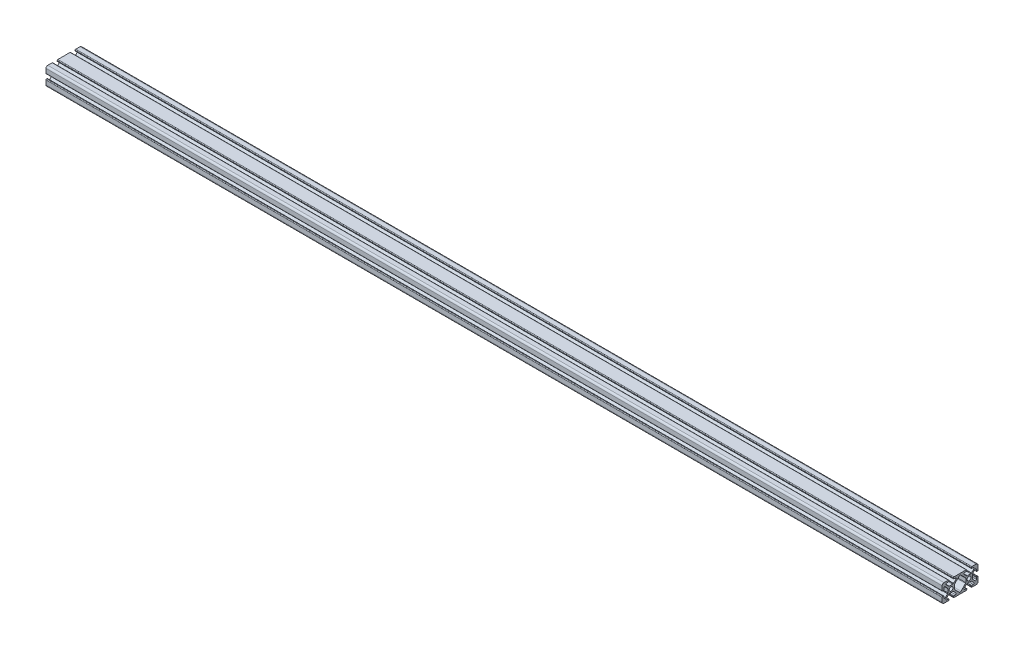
ISO-10303-21;
HEADER;
FILE_DESCRIPTION(('STEP AP214'),'2;1');
FILE_NAME('part.step','',(''),(''),'','','');
FILE_SCHEMA(('AUTOMOTIVE_DESIGN { 1 0 10303 214 1 1 1 1 }'));
ENDSEC;
DATA;
#1=APPLICATION_CONTEXT('core data for automotive mechanical design processes');
#2=APPLICATION_PROTOCOL_DEFINITION('international standard','automotive_design',2000,#1);
#3=PRODUCT_CONTEXT('',#1,'mechanical');
#4=PRODUCT('Part','Part','',(#3));
#5=PRODUCT_RELATED_PRODUCT_CATEGORY('part','',(#4));
#6=PRODUCT_DEFINITION_FORMATION('','',#4);
#7=PRODUCT_DEFINITION_CONTEXT('part definition',#1,'design');
#8=PRODUCT_DEFINITION('design','',#6,#7);
#9=PRODUCT_DEFINITION_SHAPE('','',#8);
#10=(LENGTH_UNIT() NAMED_UNIT(*) SI_UNIT(.MILLI.,.METRE.));
#11=(NAMED_UNIT(*) PLANE_ANGLE_UNIT() SI_UNIT($,.RADIAN.));
#12=(NAMED_UNIT(*) SI_UNIT($,.STERADIAN.) SOLID_ANGLE_UNIT());
#13=UNCERTAINTY_MEASURE_WITH_UNIT(LENGTH_MEASURE(1.E-05),#10,'distance_accuracy_value','');
#14=(GEOMETRIC_REPRESENTATION_CONTEXT(3) GLOBAL_UNCERTAINTY_ASSIGNED_CONTEXT((#13)) GLOBAL_UNIT_ASSIGNED_CONTEXT((#10,
#11,#12)) REPRESENTATION_CONTEXT('',''));
#15=CARTESIAN_POINT('',(0.,0.,0.));
#16=DIRECTION('',(0.,0.,1.));
#17=DIRECTION('',(1.,0.,0.));
#18=AXIS2_PLACEMENT_3D('',#15,#16,#17);
#19=CARTESIAN_POINT('',(1000.,-8.,18.));
#20=DIRECTION('',(-1.,0.,0.));
#21=DIRECTION('',(0.,0.,1.));
#22=AXIS2_PLACEMENT_3D('',#19,#20,#21);
#23=CYLINDRICAL_SURFACE('',#22,2.);
#24=CARTESIAN_POINT('',(0.,-8.,18.));
#25=DIRECTION('',(1.,0.,0.));
#26=DIRECTION('',(0.,0.,-1.));
#27=AXIS2_PLACEMENT_3D('',#24,#25,#26);
#28=CIRCLE('',#27,2.);
#29=CARTESIAN_POINT('',(0.,-8.,20.));
#30=VERTEX_POINT('',#29);
#31=CARTESIAN_POINT('',(0.,-10.,18.));
#32=VERTEX_POINT('',#31);
#33=EDGE_CURVE('E1144',#30,#32,#28,.T.);
#34=ORIENTED_EDGE('',*,*,#33,.T.);
#35=DIRECTION('',(-1.,0.,0.));
#36=VECTOR('',#35,1.);
#37=CARTESIAN_POINT('',(1000.,-10.,18.));
#38=LINE('',#37,#36);
#39=CARTESIAN_POINT('',(1000.,-10.,18.));
#40=VERTEX_POINT('',#39);
#41=EDGE_CURVE('E13',#40,#32,#38,.T.);
#42=ORIENTED_EDGE('',*,*,#41,.F.);
#43=CARTESIAN_POINT('',(1000.,-8.,18.));
#44=DIRECTION('',(1.,0.,0.));
#45=DIRECTION('',(0.,0.,-1.));
#46=AXIS2_PLACEMENT_3D('',#43,#44,#45);
#47=CIRCLE('',#46,2.);
#48=CARTESIAN_POINT('',(1000.,-8.,20.));
#49=VERTEX_POINT('',#48);
#50=EDGE_CURVE('E1723',#49,#40,#47,.T.);
#51=ORIENTED_EDGE('',*,*,#50,.F.);
#52=DIRECTION('',(-1.,0.,0.));
#53=VECTOR('',#52,1.);
#54=CARTESIAN_POINT('',(1000.,-8.,20.));
#55=LINE('',#54,#53);
#56=EDGE_CURVE('E1351',#49,#30,#55,.T.);
#57=ORIENTED_EDGE('',*,*,#56,.T.);
#58=EDGE_LOOP('',(#34,#42,#51,#57));
#59=FACE_BOUND('',#58,.T.);
#60=ADVANCED_FACE('F354',(#59),#23,.T.);
#61=CARTESIAN_POINT('',(1000.,-10.,18.));
#62=DIRECTION('',(0.,1.,0.));
#63=DIRECTION('',(0.,0.,1.));
#64=AXIS2_PLACEMENT_3D('',#61,#62,#63);
#65=PLANE('',#64);
#66=DIRECTION('',(0.,0.,-1.));
#67=VECTOR('',#66,1.);
#68=CARTESIAN_POINT('',(0.,-10.,18.));
#69=LINE('',#68,#67);
#70=CARTESIAN_POINT('',(0.,-10.,13.2));
#71=VERTEX_POINT('',#70);
#72=EDGE_CURVE('E1147',#32,#71,#69,.T.);
#73=ORIENTED_EDGE('',*,*,#72,.T.);
#74=DIRECTION('',(-1.,0.,0.));
#75=VECTOR('',#74,1.);
#76=CARTESIAN_POINT('',(1000.,-10.,13.2));
#77=LINE('',#76,#75);
#78=CARTESIAN_POINT('',(1000.,-10.,13.2));
#79=VERTEX_POINT('',#78);
#80=EDGE_CURVE('E364',#79,#71,#77,.T.);
#81=ORIENTED_EDGE('',*,*,#80,.F.);
#82=DIRECTION('',(0.,0.,-1.));
#83=VECTOR('',#82,1.);
#84=CARTESIAN_POINT('',(1000.,-10.,18.));
#85=LINE('',#84,#83);
#86=EDGE_CURVE('E1725',#40,#79,#85,.T.);
#87=ORIENTED_EDGE('',*,*,#86,.F.);
#88=ORIENTED_EDGE('',*,*,#41,.T.);
#89=EDGE_LOOP('',(#73,#81,#87,#88));
#90=FACE_BOUND('',#89,.T.);
#91=ADVANCED_FACE('F1951',(#90),#65,.F.);
#92=CARTESIAN_POINT('',(1000.,-9.30000000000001,13.2));
#93=DIRECTION('',(-1.,0.,0.));
#94=DIRECTION('',(0.,0.,1.));
#95=AXIS2_PLACEMENT_3D('',#92,#93,#94);
#96=CYLINDRICAL_SURFACE('',#95,0.699999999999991);
#97=CARTESIAN_POINT('',(0.,-9.30000000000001,13.2));
#98=DIRECTION('',(1.,0.,0.));
#99=DIRECTION('',(0.,0.,-1.));
#100=AXIS2_PLACEMENT_3D('',#97,#98,#99);
#101=CIRCLE('',#100,0.699999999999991);
#102=CARTESIAN_POINT('',(0.,-9.30000000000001,12.5));
#103=VERTEX_POINT('',#102);
#104=EDGE_CURVE('E1149',#71,#103,#101,.T.);
#105=ORIENTED_EDGE('',*,*,#104,.T.);
#106=DIRECTION('',(-1.,0.,0.));
#107=VECTOR('',#106,1.);
#108=CARTESIAN_POINT('',(1000.,-9.30000000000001,12.5));
#109=LINE('',#108,#107);
#110=CARTESIAN_POINT('',(1000.,-9.30000000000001,12.5));
#111=VERTEX_POINT('',#110);
#112=EDGE_CURVE('E1646',#111,#103,#109,.T.);
#113=ORIENTED_EDGE('',*,*,#112,.F.);
#114=CARTESIAN_POINT('',(1000.,-9.30000000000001,13.2));
#115=DIRECTION('',(1.,0.,0.));
#116=DIRECTION('',(0.,0.,-1.));
#117=AXIS2_PLACEMENT_3D('',#114,#115,#116);
#118=CIRCLE('',#117,0.699999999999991);
#119=EDGE_CURVE('E1727',#79,#111,#118,.T.);
#120=ORIENTED_EDGE('',*,*,#119,.F.);
#121=ORIENTED_EDGE('',*,*,#80,.T.);
#122=EDGE_LOOP('',(#105,#113,#120,#121));
#123=FACE_BOUND('',#122,.T.);
#124=ADVANCED_FACE('F1956',(#123),#96,.T.);
#125=CARTESIAN_POINT('',(1000.,-9.30000000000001,12.5));
#126=DIRECTION('',(0.,0.,1.));
#127=DIRECTION('',(1.,0.,0.));
#128=AXIS2_PLACEMENT_3D('',#125,#126,#127);
#129=PLANE('',#128);
#130=DIRECTION('',(0.,1.,0.));
#131=VECTOR('',#130,1.);
#132=CARTESIAN_POINT('',(0.,-9.30000000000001,12.5));
#133=LINE('',#132,#131);
#134=CARTESIAN_POINT('',(0.,-8.70000000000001,12.5));
#135=VERTEX_POINT('',#134);
#136=EDGE_CURVE('E1151',#103,#135,#133,.T.);
#137=ORIENTED_EDGE('',*,*,#136,.T.);
#138=DIRECTION('',(-1.,0.,0.));
#139=VECTOR('',#138,1.);
#140=CARTESIAN_POINT('',(1000.,-8.70000000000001,12.5));
#141=LINE('',#140,#139);
#142=CARTESIAN_POINT('',(1000.,-8.70000000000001,12.5));
#143=VERTEX_POINT('',#142);
#144=EDGE_CURVE('E1643',#143,#135,#141,.T.);
#145=ORIENTED_EDGE('',*,*,#144,.F.);
#146=DIRECTION('',(0.,1.,0.));
#147=VECTOR('',#146,1.);
#148=CARTESIAN_POINT('',(1000.,-9.30000000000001,12.5));
#149=LINE('',#148,#147);
#150=EDGE_CURVE('E1729',#111,#143,#149,.T.);
#151=ORIENTED_EDGE('',*,*,#150,.F.);
#152=ORIENTED_EDGE('',*,*,#112,.T.);
#153=EDGE_LOOP('',(#137,#145,#151,#152));
#154=FACE_BOUND('',#153,.T.);
#155=ADVANCED_FACE('F3201',(#154),#129,.F.);
#156=CARTESIAN_POINT('',(1000.,-8.7,13.));
#157=DIRECTION('',(-1.,0.,0.));
#158=DIRECTION('',(0.,0.,1.));
#159=AXIS2_PLACEMENT_3D('',#156,#157,#158);
#160=CYLINDRICAL_SURFACE('',#159,0.5);
#161=CARTESIAN_POINT('',(0.,-8.7,13.));
#162=DIRECTION('',(1.,0.,0.));
#163=DIRECTION('',(0.,0.,-1.));
#164=AXIS2_PLACEMENT_3D('',#161,#162,#163);
#165=CIRCLE('',#164,0.5);
#166=CARTESIAN_POINT('',(0.,-8.2,13.));
#167=VERTEX_POINT('',#166);
#168=EDGE_CURVE('E1153',#135,#167,#165,.T.);
#169=ORIENTED_EDGE('',*,*,#168,.T.);
#170=DIRECTION('',(-1.,0.,0.));
#171=VECTOR('',#170,1.);
#172=CARTESIAN_POINT('',(1000.,-8.2,13.));
#173=LINE('',#172,#171);
#174=CARTESIAN_POINT('',(1000.,-8.2,13.));
#175=VERTEX_POINT('',#174);
#176=EDGE_CURVE('E1640',#175,#167,#173,.T.);
#177=ORIENTED_EDGE('',*,*,#176,.F.);
#178=CARTESIAN_POINT('',(1000.,-8.7,13.));
#179=DIRECTION('',(1.,0.,0.));
#180=DIRECTION('',(0.,0.,-1.));
#181=AXIS2_PLACEMENT_3D('',#178,#179,#180);
#182=CIRCLE('',#181,0.5);
#183=EDGE_CURVE('E1731',#143,#175,#182,.T.);
#184=ORIENTED_EDGE('',*,*,#183,.F.);
#185=ORIENTED_EDGE('',*,*,#144,.T.);
#186=EDGE_LOOP('',(#169,#177,#184,#185));
#187=FACE_BOUND('',#186,.T.);
#188=ADVANCED_FACE('F3190',(#187),#160,.T.);
#189=CARTESIAN_POINT('',(1000.,-8.2,13.));
#190=DIRECTION('',(0.,-1.,0.));
#191=DIRECTION('',(0.,0.,-1.));
#192=AXIS2_PLACEMENT_3D('',#189,#190,#191);
#193=PLANE('',#192);
#194=DIRECTION('',(0.,0.,1.));
#195=VECTOR('',#194,1.);
#196=CARTESIAN_POINT('',(0.,-8.2,13.));
#197=LINE('',#196,#195);
#198=CARTESIAN_POINT('',(0.,-8.20000000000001,14.867588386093));
#199=VERTEX_POINT('',#198);
#200=EDGE_CURVE('E1155',#167,#199,#197,.T.);
#201=ORIENTED_EDGE('',*,*,#200,.T.);
#202=DIRECTION('',(-1.,0.,0.));
#203=VECTOR('',#202,1.);
#204=CARTESIAN_POINT('',(1000.,-8.20000000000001,14.867588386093));
#205=LINE('',#204,#203);
#206=CARTESIAN_POINT('',(1000.,-8.20000000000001,14.867588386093));
#207=VERTEX_POINT('',#206);
#208=EDGE_CURVE('E1637',#207,#199,#205,.T.);
#209=ORIENTED_EDGE('',*,*,#208,.F.);
#210=DIRECTION('',(0.,0.,1.));
#211=VECTOR('',#210,1.);
#212=CARTESIAN_POINT('',(1000.,-8.2,13.));
#213=LINE('',#212,#211);
#214=EDGE_CURVE('E1733',#175,#207,#213,.T.);
#215=ORIENTED_EDGE('',*,*,#214,.F.);
#216=ORIENTED_EDGE('',*,*,#176,.T.);
#217=EDGE_LOOP('',(#201,#209,#215,#216));
#218=FACE_BOUND('',#217,.T.);
#219=ADVANCED_FACE('F3179',(#218),#193,.F.);
#220=CARTESIAN_POINT('',(1000.,-7.31758838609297,14.867588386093));
#221=DIRECTION('',(-1.,0.,0.));
#222=DIRECTION('',(0.,0.,1.));
#223=AXIS2_PLACEMENT_3D('',#220,#221,#222);
#224=CYLINDRICAL_SURFACE('',#223,0.882411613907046);
#225=CARTESIAN_POINT('',(0.,-7.31758838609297,14.867588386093));
#226=DIRECTION('',(-1.,0.,0.));
#227=DIRECTION('',(0.,0.,-1.));
#228=AXIS2_PLACEMENT_3D('',#225,#226,#227);
#229=CIRCLE('',#228,0.882411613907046);
#230=CARTESIAN_POINT('',(0.,-6.69362915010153,15.4915476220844));
#231=VERTEX_POINT('',#230);
#232=EDGE_CURVE('E1157',#199,#231,#229,.T.);
#233=ORIENTED_EDGE('',*,*,#232,.T.);
#234=DIRECTION('',(-1.,0.,0.));
#235=VECTOR('',#234,1.);
#236=CARTESIAN_POINT('',(1000.,-6.69362915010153,15.4915476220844));
#237=LINE('',#236,#235);
#238=CARTESIAN_POINT('',(1000.,-6.69362915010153,15.4915476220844));
#239=VERTEX_POINT('',#238);
#240=EDGE_CURVE('E1634',#239,#231,#237,.T.);
#241=ORIENTED_EDGE('',*,*,#240,.F.);
#242=CARTESIAN_POINT('',(1000.,-7.31758838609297,14.867588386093));
#243=DIRECTION('',(-1.,0.,0.));
#244=DIRECTION('',(0.,0.,-1.));
#245=AXIS2_PLACEMENT_3D('',#242,#243,#244);
#246=CIRCLE('',#245,0.882411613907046);
#247=EDGE_CURVE('E1735',#207,#239,#246,.T.);
#248=ORIENTED_EDGE('',*,*,#247,.F.);
#249=ORIENTED_EDGE('',*,*,#208,.T.);
#250=EDGE_LOOP('',(#233,#241,#248,#249));
#251=FACE_BOUND('',#250,.T.);
#252=ADVANCED_FACE('F3168',(#251),#224,.F.);
#253=CARTESIAN_POINT('',(1000.,-6.69362915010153,15.4915476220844));
#254=DIRECTION('',(0.,0.707106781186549,0.707106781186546));
#255=DIRECTION('',(0.,-0.707106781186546,0.707106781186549));
#256=AXIS2_PLACEMENT_3D('',#253,#254,#255);
#257=PLANE('',#256);
#258=DIRECTION('',(0.,0.707106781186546,-0.707106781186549));
#259=VECTOR('',#258,1.);
#260=CARTESIAN_POINT('',(0.,-6.69362915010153,15.4915476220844));
#261=LINE('',#260,#259);
#262=CARTESIAN_POINT('',(0.,-3.94289321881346,12.7408116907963));
#263=VERTEX_POINT('',#262);
#264=EDGE_CURVE('E1159',#231,#263,#261,.T.);
#265=ORIENTED_EDGE('',*,*,#264,.T.);
#266=DIRECTION('',(-1.,0.,0.));
#267=VECTOR('',#266,1.);
#268=CARTESIAN_POINT('',(1000.,-3.94289321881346,12.7408116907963));
#269=LINE('',#268,#267);
#270=CARTESIAN_POINT('',(1000.,-3.94289321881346,12.7408116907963));
#271=VERTEX_POINT('',#270);
#272=EDGE_CURVE('E1631',#271,#263,#269,.T.);
#273=ORIENTED_EDGE('',*,*,#272,.F.);
#274=DIRECTION('',(0.,0.707106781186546,-0.707106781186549));
#275=VECTOR('',#274,1.);
#276=CARTESIAN_POINT('',(1000.,-6.69362915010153,15.4915476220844));
#277=LINE('',#276,#275);
#278=EDGE_CURVE('E1737',#239,#271,#277,.T.);
#279=ORIENTED_EDGE('',*,*,#278,.F.);
#280=ORIENTED_EDGE('',*,*,#240,.T.);
#281=EDGE_LOOP('',(#265,#273,#279,#280));
#282=FACE_BOUND('',#281,.T.);
#283=ADVANCED_FACE('F3157',(#282),#257,.F.);
#284=CARTESIAN_POINT('',(1000.,-3.65000000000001,12.0337049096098));
#285=DIRECTION('',(0.,0.923879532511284,0.382683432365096));
#286=DIRECTION('',(0.,-0.382683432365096,0.923879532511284));
#287=AXIS2_PLACEMENT_3D('',#284,#285,#286);
#288=PLANE('',#287);
#289=DIRECTION('',(0.,0.382683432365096,-0.923879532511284));
#290=VECTOR('',#289,1.);
#291=CARTESIAN_POINT('',(0.,-3.65000000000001,12.0337049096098));
#292=LINE('',#291,#290);
#293=CARTESIAN_POINT('',(0.,-3.65000000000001,12.0337049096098));
#294=VERTEX_POINT('',#293);
#295=EDGE_CURVE('E1161',#263,#294,#292,.T.);
#296=ORIENTED_EDGE('',*,*,#295,.T.);
#297=DIRECTION('',(-1.,0.,0.));
#298=VECTOR('',#297,1.);
#299=CARTESIAN_POINT('',(1000.,-3.65000000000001,12.0337049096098));
#300=LINE('',#299,#298);
#301=CARTESIAN_POINT('',(1000.,-3.65000000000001,12.0337049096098));
#302=VERTEX_POINT('',#301);
#303=EDGE_CURVE('E1628',#302,#294,#300,.T.);
#304=ORIENTED_EDGE('',*,*,#303,.F.);
#305=DIRECTION('',(0.,0.382683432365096,-0.923879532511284));
#306=VECTOR('',#305,1.);
#307=CARTESIAN_POINT('',(1000.,-3.65000000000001,12.0337049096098));
#308=LINE('',#307,#306);
#309=EDGE_CURVE('E1739',#271,#302,#308,.T.);
#310=ORIENTED_EDGE('',*,*,#309,.F.);
#311=ORIENTED_EDGE('',*,*,#272,.T.);
#312=EDGE_LOOP('',(#296,#304,#310,#311));
#313=FACE_BOUND('',#312,.T.);
#314=ADVANCED_FACE('F3146',(#313),#288,.F.);
#315=CARTESIAN_POINT('',(1000.,-3.65000000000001,12.0337049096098));
#316=DIRECTION('',(0.,1.,0.));
#317=DIRECTION('',(0.,0.,1.));
#318=AXIS2_PLACEMENT_3D('',#315,#316,#317);
#319=PLANE('',#318);
#320=DIRECTION('',(0.,0.,-1.));
#321=VECTOR('',#320,1.);
#322=CARTESIAN_POINT('',(0.,-3.65000000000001,12.0337049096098));
#323=LINE('',#322,#321);
#324=CARTESIAN_POINT('',(0.,-3.64999999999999,7.96629509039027));
#325=VERTEX_POINT('',#324);
#326=EDGE_CURVE('E1163',#294,#325,#323,.T.);
#327=ORIENTED_EDGE('',*,*,#326,.T.);
#328=DIRECTION('',(-1.,0.,0.));
#329=VECTOR('',#328,1.);
#330=CARTESIAN_POINT('',(1000.,-3.64999999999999,7.96629509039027));
#331=LINE('',#330,#329);
#332=CARTESIAN_POINT('',(1000.,-3.64999999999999,7.96629509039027));
#333=VERTEX_POINT('',#332);
#334=EDGE_CURVE('E1625',#333,#325,#331,.T.);
#335=ORIENTED_EDGE('',*,*,#334,.F.);
#336=DIRECTION('',(0.,0.,-1.));
#337=VECTOR('',#336,1.);
#338=CARTESIAN_POINT('',(1000.,-3.65000000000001,12.0337049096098));
#339=LINE('',#338,#337);
#340=EDGE_CURVE('E1741',#302,#333,#339,.T.);
#341=ORIENTED_EDGE('',*,*,#340,.F.);
#342=ORIENTED_EDGE('',*,*,#303,.T.);
#343=EDGE_LOOP('',(#327,#335,#341,#342));
#344=FACE_BOUND('',#343,.T.);
#345=ADVANCED_FACE('F3135',(#344),#319,.F.);
#346=CARTESIAN_POINT('',(1000.,-3.94289321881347,7.25918830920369));
#347=DIRECTION('',(0.,0.923879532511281,-0.382683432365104));
#348=DIRECTION('',(0.,0.382683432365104,0.923879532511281));
#349=AXIS2_PLACEMENT_3D('',#346,#347,#348);
#350=PLANE('',#349);
#351=DIRECTION('',(0.,-0.382683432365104,-0.923879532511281));
#352=VECTOR('',#351,1.);
#353=CARTESIAN_POINT('',(0.,-3.94289321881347,7.25918830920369));
#354=LINE('',#353,#352);
#355=CARTESIAN_POINT('',(0.,-3.94289321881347,7.25918830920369));
#356=VERTEX_POINT('',#355);
#357=EDGE_CURVE('E1165',#325,#356,#354,.T.);
#358=ORIENTED_EDGE('',*,*,#357,.T.);
#359=DIRECTION('',(-1.,0.,0.));
#360=VECTOR('',#359,1.);
#361=CARTESIAN_POINT('',(1000.,-3.94289321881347,7.25918830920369));
#362=LINE('',#361,#360);
#363=CARTESIAN_POINT('',(1000.,-3.94289321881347,7.25918830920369));
#364=VERTEX_POINT('',#363);
#365=EDGE_CURVE('E1622',#364,#356,#362,.T.);
#366=ORIENTED_EDGE('',*,*,#365,.F.);
#367=DIRECTION('',(0.,-0.382683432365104,-0.923879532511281));
#368=VECTOR('',#367,1.);
#369=CARTESIAN_POINT('',(1000.,-3.94289321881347,7.25918830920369));
#370=LINE('',#369,#368);
#371=EDGE_CURVE('E1743',#333,#364,#370,.T.);
#372=ORIENTED_EDGE('',*,*,#371,.F.);
#373=ORIENTED_EDGE('',*,*,#334,.T.);
#374=EDGE_LOOP('',(#358,#366,#372,#373));
#375=FACE_BOUND('',#374,.T.);
#376=ADVANCED_FACE('F3124',(#375),#350,.F.);
#377=CARTESIAN_POINT('',(1000.,-3.94289321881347,7.25918830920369));
#378=DIRECTION('',(0.,0.707106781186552,-0.707106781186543));
#379=DIRECTION('',(0.,0.707106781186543,0.707106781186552));
#380=AXIS2_PLACEMENT_3D('',#377,#378,#379);
#381=PLANE('',#380);
#382=DIRECTION('',(0.,-0.707106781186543,-0.707106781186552));
#383=VECTOR('',#382,1.);
#384=CARTESIAN_POINT('',(0.,-3.94289321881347,7.25918830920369));
#385=LINE('',#384,#383);
#386=CARTESIAN_POINT('',(0.,-6.69362915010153,4.5084523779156));
#387=VERTEX_POINT('',#386);
#388=EDGE_CURVE('E1167',#356,#387,#385,.T.);
#389=ORIENTED_EDGE('',*,*,#388,.T.);
#390=DIRECTION('',(-1.,0.,0.));
#391=VECTOR('',#390,1.);
#392=CARTESIAN_POINT('',(1000.,-6.69362915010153,4.5084523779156));
#393=LINE('',#392,#391);
#394=CARTESIAN_POINT('',(1000.,-6.69362915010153,4.5084523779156));
#395=VERTEX_POINT('',#394);
#396=EDGE_CURVE('E1619',#395,#387,#393,.T.);
#397=ORIENTED_EDGE('',*,*,#396,.F.);
#398=DIRECTION('',(0.,-0.707106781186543,-0.707106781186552));
#399=VECTOR('',#398,1.);
#400=CARTESIAN_POINT('',(1000.,-3.94289321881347,7.25918830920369));
#401=LINE('',#400,#399);
#402=EDGE_CURVE('E1745',#364,#395,#401,.T.);
#403=ORIENTED_EDGE('',*,*,#402,.F.);
#404=ORIENTED_EDGE('',*,*,#365,.T.);
#405=EDGE_LOOP('',(#389,#397,#403,#404));
#406=FACE_BOUND('',#405,.T.);
#407=ADVANCED_FACE('F3113',(#406),#381,.F.);
#408=CARTESIAN_POINT('',(1000.,-7.31758838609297,5.13241161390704));
#409=DIRECTION('',(-1.,0.,0.));
#410=DIRECTION('',(0.,0.,1.));
#411=AXIS2_PLACEMENT_3D('',#408,#409,#410);
#412=CYLINDRICAL_SURFACE('',#411,0.88241161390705);
#413=CARTESIAN_POINT('',(0.,-7.31758838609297,5.13241161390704));
#414=DIRECTION('',(-1.,0.,0.));
#415=DIRECTION('',(0.,0.,-1.));
#416=AXIS2_PLACEMENT_3D('',#413,#414,#415);
#417=CIRCLE('',#416,0.88241161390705);
#418=CARTESIAN_POINT('',(0.,-8.20000000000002,5.13241161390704));
#419=VERTEX_POINT('',#418);
#420=EDGE_CURVE('E1169',#387,#419,#417,.T.);
#421=ORIENTED_EDGE('',*,*,#420,.T.);
#422=DIRECTION('',(-1.,0.,0.));
#423=VECTOR('',#422,1.);
#424=CARTESIAN_POINT('',(1000.,-8.20000000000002,5.13241161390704));
#425=LINE('',#424,#423);
#426=CARTESIAN_POINT('',(1000.,-8.20000000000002,5.13241161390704));
#427=VERTEX_POINT('',#426);
#428=EDGE_CURVE('E1616',#427,#419,#425,.T.);
#429=ORIENTED_EDGE('',*,*,#428,.F.);
#430=CARTESIAN_POINT('',(1000.,-7.31758838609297,5.13241161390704));
#431=DIRECTION('',(-1.,0.,0.));
#432=DIRECTION('',(0.,0.,-1.));
#433=AXIS2_PLACEMENT_3D('',#430,#431,#432);
#434=CIRCLE('',#433,0.88241161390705);
#435=EDGE_CURVE('E1747',#395,#427,#434,.T.);
#436=ORIENTED_EDGE('',*,*,#435,.F.);
#437=ORIENTED_EDGE('',*,*,#396,.T.);
#438=EDGE_LOOP('',(#421,#429,#436,#437));
#439=FACE_BOUND('',#438,.T.);
#440=ADVANCED_FACE('F3102',(#439),#412,.F.);
#441=CARTESIAN_POINT('',(1000.,-8.20000000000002,5.13241161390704));
#442=DIRECTION('',(0.,-1.,0.));
#443=DIRECTION('',(0.,0.,-1.));
#444=AXIS2_PLACEMENT_3D('',#441,#442,#443);
#445=PLANE('',#444);
#446=DIRECTION('',(0.,0.,1.));
#447=VECTOR('',#446,1.);
#448=CARTESIAN_POINT('',(0.,-8.20000000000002,5.13241161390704));
#449=LINE('',#448,#447);
#450=CARTESIAN_POINT('',(0.,-8.2,7.));
#451=VERTEX_POINT('',#450);
#452=EDGE_CURVE('E1171',#419,#451,#449,.T.);
#453=ORIENTED_EDGE('',*,*,#452,.T.);
#454=DIRECTION('',(-1.,0.,0.));
#455=VECTOR('',#454,1.);
#456=CARTESIAN_POINT('',(1000.,-8.2,7.));
#457=LINE('',#456,#455);
#458=CARTESIAN_POINT('',(1000.,-8.2,7.));
#459=VERTEX_POINT('',#458);
#460=EDGE_CURVE('E1613',#459,#451,#457,.T.);
#461=ORIENTED_EDGE('',*,*,#460,.F.);
#462=DIRECTION('',(0.,0.,1.));
#463=VECTOR('',#462,1.);
#464=CARTESIAN_POINT('',(1000.,-8.20000000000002,5.13241161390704));
#465=LINE('',#464,#463);
#466=EDGE_CURVE('E1749',#427,#459,#465,.T.);
#467=ORIENTED_EDGE('',*,*,#466,.F.);
#468=ORIENTED_EDGE('',*,*,#428,.T.);
#469=EDGE_LOOP('',(#453,#461,#467,#468));
#470=FACE_BOUND('',#469,.T.);
#471=ADVANCED_FACE('F3091',(#470),#445,.F.);
#472=CARTESIAN_POINT('',(1000.,-8.70000000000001,7.));
#473=DIRECTION('',(-1.,0.,0.));
#474=DIRECTION('',(0.,0.,1.));
#475=AXIS2_PLACEMENT_3D('',#472,#473,#474);
#476=CYLINDRICAL_SURFACE('',#475,0.500000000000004);
#477=CARTESIAN_POINT('',(0.,-8.70000000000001,7.));
#478=DIRECTION('',(1.,0.,0.));
#479=DIRECTION('',(0.,0.,-1.));
#480=AXIS2_PLACEMENT_3D('',#477,#478,#479);
#481=CIRCLE('',#480,0.500000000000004);
#482=CARTESIAN_POINT('',(0.,-8.70000000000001,7.5));
#483=VERTEX_POINT('',#482);
#484=EDGE_CURVE('E1173',#451,#483,#481,.T.);
#485=ORIENTED_EDGE('',*,*,#484,.T.);
#486=DIRECTION('',(-1.,0.,0.));
#487=VECTOR('',#486,1.);
#488=CARTESIAN_POINT('',(1000.,-8.70000000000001,7.5));
#489=LINE('',#488,#487);
#490=CARTESIAN_POINT('',(1000.,-8.70000000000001,7.5));
#491=VERTEX_POINT('',#490);
#492=EDGE_CURVE('E1610',#491,#483,#489,.T.);
#493=ORIENTED_EDGE('',*,*,#492,.F.);
#494=CARTESIAN_POINT('',(1000.,-8.70000000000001,7.));
#495=DIRECTION('',(1.,0.,0.));
#496=DIRECTION('',(0.,0.,-1.));
#497=AXIS2_PLACEMENT_3D('',#494,#495,#496);
#498=CIRCLE('',#497,0.500000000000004);
#499=EDGE_CURVE('E1751',#459,#491,#498,.T.);
#500=ORIENTED_EDGE('',*,*,#499,.F.);
#501=ORIENTED_EDGE('',*,*,#460,.T.);
#502=EDGE_LOOP('',(#485,#493,#500,#501));
#503=FACE_BOUND('',#502,.T.);
#504=ADVANCED_FACE('F3080',(#503),#476,.T.);
#505=CARTESIAN_POINT('',(1000.,-8.70000000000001,7.5));
#506=DIRECTION('',(0.,0.,-1.));
#507=DIRECTION('',(-1.,0.,0.));
#508=AXIS2_PLACEMENT_3D('',#505,#506,#507);
#509=PLANE('',#508);
#510=DIRECTION('',(0.,-1.,0.));
#511=VECTOR('',#510,1.);
#512=CARTESIAN_POINT('',(0.,-8.70000000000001,7.5));
#513=LINE('',#512,#511);
#514=CARTESIAN_POINT('',(0.,-9.30000000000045,7.5));
#515=VERTEX_POINT('',#514);
#516=EDGE_CURVE('E1175',#483,#515,#513,.T.);
#517=ORIENTED_EDGE('',*,*,#516,.T.);
#518=DIRECTION('',(-1.,0.,0.));
#519=VECTOR('',#518,1.);
#520=CARTESIAN_POINT('',(1000.,-9.30000000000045,7.5));
#521=LINE('',#520,#519);
#522=CARTESIAN_POINT('',(1000.,-9.30000000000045,7.5));
#523=VERTEX_POINT('',#522);
#524=EDGE_CURVE('E1607',#523,#515,#521,.T.);
#525=ORIENTED_EDGE('',*,*,#524,.F.);
#526=DIRECTION('',(0.,-1.,0.));
#527=VECTOR('',#526,1.);
#528=CARTESIAN_POINT('',(1000.,-8.70000000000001,7.5));
#529=LINE('',#528,#527);
#530=EDGE_CURVE('E1753',#491,#523,#529,.T.);
#531=ORIENTED_EDGE('',*,*,#530,.F.);
#532=ORIENTED_EDGE('',*,*,#492,.T.);
#533=EDGE_LOOP('',(#517,#525,#531,#532));
#534=FACE_BOUND('',#533,.T.);
#535=ADVANCED_FACE('F3069',(#534),#509,.F.);
#536=CARTESIAN_POINT('',(1000.,-9.30000000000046,6.8));
#537=DIRECTION('',(-1.,0.,0.));
#538=DIRECTION('',(0.,0.,1.));
#539=AXIS2_PLACEMENT_3D('',#536,#537,#538);
#540=CYLINDRICAL_SURFACE('',#539,0.700000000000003);
#541=CARTESIAN_POINT('',(0.,-9.30000000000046,6.8));
#542=DIRECTION('',(1.,0.,0.));
#543=DIRECTION('',(0.,0.,-1.));
#544=AXIS2_PLACEMENT_3D('',#541,#542,#543);
#545=CIRCLE('',#544,0.700000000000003);
#546=CARTESIAN_POINT('',(0.,-10.0000000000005,6.80000000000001));
#547=VERTEX_POINT('',#546);
#548=EDGE_CURVE('E1177',#515,#547,#545,.T.);
#549=ORIENTED_EDGE('',*,*,#548,.T.);
#550=DIRECTION('',(-1.,0.,0.));
#551=VECTOR('',#550,1.);
#552=CARTESIAN_POINT('',(1000.,-10.0000000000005,6.80000000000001));
#553=LINE('',#552,#551);
#554=CARTESIAN_POINT('',(1000.,-10.0000000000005,6.80000000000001));
#555=VERTEX_POINT('',#554);
#556=EDGE_CURVE('E1604',#555,#547,#553,.T.);
#557=ORIENTED_EDGE('',*,*,#556,.F.);
#558=CARTESIAN_POINT('',(1000.,-9.30000000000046,6.8));
#559=DIRECTION('',(1.,0.,0.));
#560=DIRECTION('',(0.,0.,-1.));
#561=AXIS2_PLACEMENT_3D('',#558,#559,#560);
#562=CIRCLE('',#561,0.700000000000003);
#563=EDGE_CURVE('E1755',#523,#555,#562,.T.);
#564=ORIENTED_EDGE('',*,*,#563,.F.);
#565=ORIENTED_EDGE('',*,*,#524,.T.);
#566=EDGE_LOOP('',(#549,#557,#564,#565));
#567=FACE_BOUND('',#566,.T.);
#568=ADVANCED_FACE('F3058',(#567),#540,.T.);
#569=CARTESIAN_POINT('',(1000.,-10.0000000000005,6.80000000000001));
#570=DIRECTION('',(0.,1.,0.));
#571=DIRECTION('',(0.,0.,1.));
#572=AXIS2_PLACEMENT_3D('',#569,#570,#571);
#573=PLANE('',#572);
#574=DIRECTION('',(0.,0.,-1.));
#575=VECTOR('',#574,1.);
#576=CARTESIAN_POINT('',(0.,-10.0000000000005,6.80000000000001));
#577=LINE('',#576,#575);
#578=CARTESIAN_POINT('',(0.,-10.0000000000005,-6.80000000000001));
#579=VERTEX_POINT('',#578);
#580=EDGE_CURVE('E1179',#547,#579,#577,.T.);
#581=ORIENTED_EDGE('',*,*,#580,.T.);
#582=DIRECTION('',(-1.,0.,0.));
#583=VECTOR('',#582,1.);
#584=CARTESIAN_POINT('',(1000.,-10.0000000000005,-6.80000000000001));
#585=LINE('',#584,#583);
#586=CARTESIAN_POINT('',(1000.,-10.0000000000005,-6.80000000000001));
#587=VERTEX_POINT('',#586);
#588=EDGE_CURVE('E1601',#587,#579,#585,.T.);
#589=ORIENTED_EDGE('',*,*,#588,.F.);
#590=DIRECTION('',(0.,0.,-1.));
#591=VECTOR('',#590,1.);
#592=CARTESIAN_POINT('',(1000.,-10.0000000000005,6.80000000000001));
#593=LINE('',#592,#591);
#594=EDGE_CURVE('E1757',#555,#587,#593,.T.);
#595=ORIENTED_EDGE('',*,*,#594,.F.);
#596=ORIENTED_EDGE('',*,*,#556,.T.);
#597=EDGE_LOOP('',(#581,#589,#595,#596));
#598=FACE_BOUND('',#597,.T.);
#599=ADVANCED_FACE('F3047',(#598),#573,.F.);
#600=CARTESIAN_POINT('',(1000.,-9.30000000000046,-6.80000000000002));
#601=DIRECTION('',(-1.,0.,0.));
#602=DIRECTION('',(0.,0.,1.));
#603=AXIS2_PLACEMENT_3D('',#600,#601,#602);
#604=CYLINDRICAL_SURFACE('',#603,0.700000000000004);
#605=CARTESIAN_POINT('',(0.,-9.30000000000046,-6.80000000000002));
#606=DIRECTION('',(1.,0.,0.));
#607=DIRECTION('',(0.,0.,-1.));
#608=AXIS2_PLACEMENT_3D('',#605,#606,#607);
#609=CIRCLE('',#608,0.700000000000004);
#610=CARTESIAN_POINT('',(0.,-9.30000000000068,-7.50000000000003));
#611=VERTEX_POINT('',#610);
#612=EDGE_CURVE('E1181',#579,#611,#609,.T.);
#613=ORIENTED_EDGE('',*,*,#612,.T.);
#614=DIRECTION('',(-1.,0.,0.));
#615=VECTOR('',#614,1.);
#616=CARTESIAN_POINT('',(1000.,-9.30000000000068,-7.50000000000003));
#617=LINE('',#616,#615);
#618=CARTESIAN_POINT('',(1000.,-9.30000000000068,-7.50000000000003));
#619=VERTEX_POINT('',#618);
#620=EDGE_CURVE('E1598',#619,#611,#617,.T.);
#621=ORIENTED_EDGE('',*,*,#620,.F.);
#622=CARTESIAN_POINT('',(1000.,-9.30000000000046,-6.80000000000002));
#623=DIRECTION('',(1.,0.,0.));
#624=DIRECTION('',(0.,0.,-1.));
#625=AXIS2_PLACEMENT_3D('',#622,#623,#624);
#626=CIRCLE('',#625,0.700000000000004);
#627=EDGE_CURVE('E1759',#587,#619,#626,.T.);
#628=ORIENTED_EDGE('',*,*,#627,.F.);
#629=ORIENTED_EDGE('',*,*,#588,.T.);
#630=EDGE_LOOP('',(#613,#621,#628,#629));
#631=FACE_BOUND('',#630,.T.);
#632=ADVANCED_FACE('F3036',(#631),#604,.T.);
#633=CARTESIAN_POINT('',(1000.,-9.30000000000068,-7.50000000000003));
#634=DIRECTION('',(0.,0.,1.));
#635=DIRECTION('',(1.,0.,0.));
#636=AXIS2_PLACEMENT_3D('',#633,#634,#635);
#637=PLANE('',#636);
#638=DIRECTION('',(0.,1.,0.));
#639=VECTOR('',#638,1.);
#640=CARTESIAN_POINT('',(0.,-9.30000000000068,-7.50000000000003));
#641=LINE('',#640,#639);
#642=CARTESIAN_POINT('',(0.,-8.70000000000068,-7.50000000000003));
#643=VERTEX_POINT('',#642);
#644=EDGE_CURVE('E1183',#611,#643,#641,.T.);
#645=ORIENTED_EDGE('',*,*,#644,.T.);
#646=DIRECTION('',(-1.,0.,0.));
#647=VECTOR('',#646,1.);
#648=CARTESIAN_POINT('',(1000.,-8.70000000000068,-7.50000000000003));
#649=LINE('',#648,#647);
#650=CARTESIAN_POINT('',(1000.,-8.70000000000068,-7.50000000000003));
#651=VERTEX_POINT('',#650);
#652=EDGE_CURVE('E1595',#651,#643,#649,.T.);
#653=ORIENTED_EDGE('',*,*,#652,.F.);
#654=DIRECTION('',(0.,1.,0.));
#655=VECTOR('',#654,1.);
#656=CARTESIAN_POINT('',(1000.,-9.30000000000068,-7.50000000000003));
#657=LINE('',#656,#655);
#658=EDGE_CURVE('E1761',#619,#651,#657,.T.);
#659=ORIENTED_EDGE('',*,*,#658,.F.);
#660=ORIENTED_EDGE('',*,*,#620,.T.);
#661=EDGE_LOOP('',(#645,#653,#659,#660));
#662=FACE_BOUND('',#661,.T.);
#663=ADVANCED_FACE('F3025',(#662),#637,.F.);
#664=CARTESIAN_POINT('',(1000.,-8.70000000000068,-7.00000000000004));
#665=DIRECTION('',(-1.,0.,0.));
#666=DIRECTION('',(0.,0.,1.));
#667=AXIS2_PLACEMENT_3D('',#664,#665,#666);
#668=CYLINDRICAL_SURFACE('',#667,0.499999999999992);
#669=CARTESIAN_POINT('',(0.,-8.70000000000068,-7.00000000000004));
#670=DIRECTION('',(1.,0.,0.));
#671=DIRECTION('',(0.,0.,-1.));
#672=AXIS2_PLACEMENT_3D('',#669,#670,#671);
#673=CIRCLE('',#672,0.499999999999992);
#674=CARTESIAN_POINT('',(0.,-8.20000000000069,-7.00000000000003));
#675=VERTEX_POINT('',#674);
#676=EDGE_CURVE('E1185',#643,#675,#673,.T.);
#677=ORIENTED_EDGE('',*,*,#676,.T.);
#678=DIRECTION('',(-1.,0.,0.));
#679=VECTOR('',#678,1.);
#680=CARTESIAN_POINT('',(1000.,-8.20000000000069,-7.00000000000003));
#681=LINE('',#680,#679);
#682=CARTESIAN_POINT('',(1000.,-8.20000000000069,-7.00000000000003));
#683=VERTEX_POINT('',#682);
#684=EDGE_CURVE('E1592',#683,#675,#681,.T.);
#685=ORIENTED_EDGE('',*,*,#684,.F.);
#686=CARTESIAN_POINT('',(1000.,-8.70000000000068,-7.00000000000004));
#687=DIRECTION('',(1.,0.,0.));
#688=DIRECTION('',(0.,0.,-1.));
#689=AXIS2_PLACEMENT_3D('',#686,#687,#688);
#690=CIRCLE('',#689,0.499999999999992);
#691=EDGE_CURVE('E1763',#651,#683,#690,.T.);
#692=ORIENTED_EDGE('',*,*,#691,.F.);
#693=ORIENTED_EDGE('',*,*,#652,.T.);
#694=EDGE_LOOP('',(#677,#685,#692,#693));
#695=FACE_BOUND('',#694,.T.);
#696=ADVANCED_FACE('F3014',(#695),#668,.T.);
#697=CARTESIAN_POINT('',(1000.,-8.20000000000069,-7.00000000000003));
#698=DIRECTION('',(0.,-1.,0.));
#699=DIRECTION('',(0.,0.,-1.));
#700=AXIS2_PLACEMENT_3D('',#697,#698,#699);
#701=PLANE('',#700);
#702=DIRECTION('',(0.,0.,1.));
#703=VECTOR('',#702,1.);
#704=CARTESIAN_POINT('',(0.,-8.20000000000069,-7.00000000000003));
#705=LINE('',#704,#703);
#706=CARTESIAN_POINT('',(0.,-8.20000000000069,-5.13241161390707));
#707=VERTEX_POINT('',#706);
#708=EDGE_CURVE('E1187',#675,#707,#705,.T.);
#709=ORIENTED_EDGE('',*,*,#708,.T.);
#710=DIRECTION('',(-1.,0.,0.));
#711=VECTOR('',#710,1.);
#712=CARTESIAN_POINT('',(1000.,-8.20000000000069,-5.13241161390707));
#713=LINE('',#712,#711);
#714=CARTESIAN_POINT('',(1000.,-8.20000000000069,-5.13241161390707));
#715=VERTEX_POINT('',#714);
#716=EDGE_CURVE('E1589',#715,#707,#713,.T.);
#717=ORIENTED_EDGE('',*,*,#716,.F.);
#718=DIRECTION('',(0.,0.,1.));
#719=VECTOR('',#718,1.);
#720=CARTESIAN_POINT('',(1000.,-8.20000000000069,-7.00000000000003));
#721=LINE('',#720,#719);
#722=EDGE_CURVE('E1765',#683,#715,#721,.T.);
#723=ORIENTED_EDGE('',*,*,#722,.F.);
#724=ORIENTED_EDGE('',*,*,#684,.T.);
#725=EDGE_LOOP('',(#709,#717,#723,#724));
#726=FACE_BOUND('',#725,.T.);
#727=ADVANCED_FACE('F3003',(#726),#701,.F.);
#728=CARTESIAN_POINT('',(1000.,-7.31758838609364,-5.13241161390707));
#729=DIRECTION('',(-1.,0.,0.));
#730=DIRECTION('',(0.,0.,1.));
#731=AXIS2_PLACEMENT_3D('',#728,#729,#730);
#732=CYLINDRICAL_SURFACE('',#731,0.882411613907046);
#733=CARTESIAN_POINT('',(0.,-7.31758838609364,-5.13241161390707));
#734=DIRECTION('',(-1.,0.,0.));
#735=DIRECTION('',(0.,0.,-1.));
#736=AXIS2_PLACEMENT_3D('',#733,#734,#735);
#737=CIRCLE('',#736,0.882411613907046);
#738=CARTESIAN_POINT('',(0.,-6.69362915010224,-4.5084523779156));
#739=VERTEX_POINT('',#738);
#740=EDGE_CURVE('E1189',#707,#739,#737,.T.);
#741=ORIENTED_EDGE('',*,*,#740,.T.);
#742=DIRECTION('',(-1.,0.,0.));
#743=VECTOR('',#742,1.);
#744=CARTESIAN_POINT('',(1000.,-6.69362915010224,-4.5084523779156));
#745=LINE('',#744,#743);
#746=CARTESIAN_POINT('',(1000.,-6.69362915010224,-4.5084523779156));
#747=VERTEX_POINT('',#746);
#748=EDGE_CURVE('E1586',#747,#739,#745,.T.);
#749=ORIENTED_EDGE('',*,*,#748,.F.);
#750=CARTESIAN_POINT('',(1000.,-7.31758838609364,-5.13241161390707));
#751=DIRECTION('',(-1.,0.,0.));
#752=DIRECTION('',(0.,0.,-1.));
#753=AXIS2_PLACEMENT_3D('',#750,#751,#752);
#754=CIRCLE('',#753,0.882411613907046);
#755=EDGE_CURVE('E1767',#715,#747,#754,.T.);
#756=ORIENTED_EDGE('',*,*,#755,.F.);
#757=ORIENTED_EDGE('',*,*,#716,.T.);
#758=EDGE_LOOP('',(#741,#749,#756,#757));
#759=FACE_BOUND('',#758,.T.);
#760=ADVANCED_FACE('F2992',(#759),#732,.F.);
#761=CARTESIAN_POINT('',(1000.,-6.69362915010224,-4.5084523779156));
#762=DIRECTION('',(0.,0.707106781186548,0.707106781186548));
#763=DIRECTION('',(0.,-0.707106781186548,0.707106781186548));
#764=AXIS2_PLACEMENT_3D('',#761,#762,#763);
#765=PLANE('',#764);
#766=DIRECTION('',(0.,0.707106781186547,-0.707106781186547));
#767=VECTOR('',#766,1.);
#768=CARTESIAN_POINT('',(0.,-6.69362915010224,-4.5084523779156));
#769=LINE('',#768,#767);
#770=CARTESIAN_POINT('',(0.,-3.94289321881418,-7.25918830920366));
#771=VERTEX_POINT('',#770);
#772=EDGE_CURVE('E1191',#739,#771,#769,.T.);
#773=ORIENTED_EDGE('',*,*,#772,.T.);
#774=DIRECTION('',(-1.,0.,0.));
#775=VECTOR('',#774,1.);
#776=CARTESIAN_POINT('',(1000.,-3.94289321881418,-7.25918830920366));
#777=LINE('',#776,#775);
#778=CARTESIAN_POINT('',(1000.,-3.94289321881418,-7.25918830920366));
#779=VERTEX_POINT('',#778);
#780=EDGE_CURVE('E1583',#779,#771,#777,.T.);
#781=ORIENTED_EDGE('',*,*,#780,.F.);
#782=DIRECTION('',(0.,0.707106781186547,-0.707106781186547));
#783=VECTOR('',#782,1.);
#784=CARTESIAN_POINT('',(1000.,-6.69362915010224,-4.5084523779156));
#785=LINE('',#784,#783);
#786=EDGE_CURVE('E1769',#747,#779,#785,.T.);
#787=ORIENTED_EDGE('',*,*,#786,.F.);
#788=ORIENTED_EDGE('',*,*,#748,.T.);
#789=EDGE_LOOP('',(#773,#781,#787,#788));
#790=FACE_BOUND('',#789,.T.);
#791=ADVANCED_FACE('F2981',(#790),#765,.F.);
#792=CARTESIAN_POINT('',(1000.,-3.65000000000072,-7.96629509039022));
#793=DIRECTION('',(0.,0.923879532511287,0.382683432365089));
#794=DIRECTION('',(0.,-0.382683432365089,0.923879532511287));
#795=AXIS2_PLACEMENT_3D('',#792,#793,#794);
#796=PLANE('',#795);
#797=DIRECTION('',(0.,0.382683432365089,-0.923879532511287));
#798=VECTOR('',#797,1.);
#799=CARTESIAN_POINT('',(0.,-3.65000000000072,-7.96629509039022));
#800=LINE('',#799,#798);
#801=CARTESIAN_POINT('',(0.,-3.65000000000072,-7.96629509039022));
#802=VERTEX_POINT('',#801);
#803=EDGE_CURVE('E1193',#771,#802,#800,.T.);
#804=ORIENTED_EDGE('',*,*,#803,.T.);
#805=DIRECTION('',(-1.,0.,0.));
#806=VECTOR('',#805,1.);
#807=CARTESIAN_POINT('',(1000.,-3.65000000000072,-7.96629509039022));
#808=LINE('',#807,#806);
#809=CARTESIAN_POINT('',(1000.,-3.65000000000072,-7.96629509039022));
#810=VERTEX_POINT('',#809);
#811=EDGE_CURVE('E1580',#810,#802,#808,.T.);
#812=ORIENTED_EDGE('',*,*,#811,.F.);
#813=DIRECTION('',(0.,0.382683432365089,-0.923879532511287));
#814=VECTOR('',#813,1.);
#815=CARTESIAN_POINT('',(1000.,-3.65000000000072,-7.96629509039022));
#816=LINE('',#815,#814);
#817=EDGE_CURVE('E1771',#779,#810,#816,.T.);
#818=ORIENTED_EDGE('',*,*,#817,.F.);
#819=ORIENTED_EDGE('',*,*,#780,.T.);
#820=EDGE_LOOP('',(#804,#812,#818,#819));
#821=FACE_BOUND('',#820,.T.);
#822=ADVANCED_FACE('F2970',(#821),#796,.F.);
#823=CARTESIAN_POINT('',(1000.,-3.65000000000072,-7.96629509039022));
#824=DIRECTION('',(0.,1.,0.));
#825=DIRECTION('',(0.,0.,1.));
#826=AXIS2_PLACEMENT_3D('',#823,#824,#825);
#827=PLANE('',#826);
#828=DIRECTION('',(0.,0.,-1.));
#829=VECTOR('',#828,1.);
#830=CARTESIAN_POINT('',(0.,-3.65000000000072,-7.96629509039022));
#831=LINE('',#830,#829);
#832=CARTESIAN_POINT('',(0.,-3.65000000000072,-12.0337049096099));
#833=VERTEX_POINT('',#832);
#834=EDGE_CURVE('E1195',#802,#833,#831,.T.);
#835=ORIENTED_EDGE('',*,*,#834,.T.);
#836=DIRECTION('',(-1.,0.,0.));
#837=VECTOR('',#836,1.);
#838=CARTESIAN_POINT('',(1000.,-3.65000000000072,-12.0337049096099));
#839=LINE('',#838,#837);
#840=CARTESIAN_POINT('',(1000.,-3.65000000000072,-12.0337049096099));
#841=VERTEX_POINT('',#840);
#842=EDGE_CURVE('E1577',#841,#833,#839,.T.);
#843=ORIENTED_EDGE('',*,*,#842,.F.);
#844=DIRECTION('',(0.,0.,-1.));
#845=VECTOR('',#844,1.);
#846=CARTESIAN_POINT('',(1000.,-3.65000000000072,-7.96629509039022));
#847=LINE('',#846,#845);
#848=EDGE_CURVE('E1773',#810,#841,#847,.T.);
#849=ORIENTED_EDGE('',*,*,#848,.F.);
#850=ORIENTED_EDGE('',*,*,#811,.T.);
#851=EDGE_LOOP('',(#835,#843,#849,#850));
#852=FACE_BOUND('',#851,.T.);
#853=ADVANCED_FACE('F2959',(#852),#827,.F.);
#854=CARTESIAN_POINT('',(1000.,-3.94289321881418,-12.7408116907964));
#855=DIRECTION('',(0.,0.923879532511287,-0.382683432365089));
#856=DIRECTION('',(0.,0.382683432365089,0.923879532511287));
#857=AXIS2_PLACEMENT_3D('',#854,#855,#856);
#858=PLANE('',#857);
#859=DIRECTION('',(0.,-0.382683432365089,-0.923879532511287));
#860=VECTOR('',#859,1.);
#861=CARTESIAN_POINT('',(0.,-3.94289321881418,-12.7408116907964));
#862=LINE('',#861,#860);
#863=CARTESIAN_POINT('',(0.,-3.94289321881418,-12.7408116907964));
#864=VERTEX_POINT('',#863);
#865=EDGE_CURVE('E1197',#833,#864,#862,.T.);
#866=ORIENTED_EDGE('',*,*,#865,.T.);
#867=DIRECTION('',(-1.,0.,0.));
#868=VECTOR('',#867,1.);
#869=CARTESIAN_POINT('',(1000.,-3.94289321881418,-12.7408116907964));
#870=LINE('',#869,#868);
#871=CARTESIAN_POINT('',(1000.,-3.94289321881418,-12.7408116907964));
#872=VERTEX_POINT('',#871);
#873=EDGE_CURVE('E1574',#872,#864,#870,.T.);
#874=ORIENTED_EDGE('',*,*,#873,.F.);
#875=DIRECTION('',(0.,-0.382683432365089,-0.923879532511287));
#876=VECTOR('',#875,1.);
#877=CARTESIAN_POINT('',(1000.,-3.94289321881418,-12.7408116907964));
#878=LINE('',#877,#876);
#879=EDGE_CURVE('E1775',#841,#872,#878,.T.);
#880=ORIENTED_EDGE('',*,*,#879,.F.);
#881=ORIENTED_EDGE('',*,*,#842,.T.);
#882=EDGE_LOOP('',(#866,#874,#880,#881));
#883=FACE_BOUND('',#882,.T.);
#884=ADVANCED_FACE('F2948',(#883),#858,.F.);
#885=CARTESIAN_POINT('',(1000.,-3.94289321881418,-12.7408116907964));
#886=DIRECTION('',(0.,0.707106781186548,-0.707106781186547));
#887=DIRECTION('',(0.,0.707106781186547,0.707106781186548));
#888=AXIS2_PLACEMENT_3D('',#885,#886,#887);
#889=PLANE('',#888);
#890=DIRECTION('',(0.,-0.707106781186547,-0.707106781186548));
#891=VECTOR('',#890,1.);
#892=CARTESIAN_POINT('',(0.,-3.94289321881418,-12.7408116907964));
#893=LINE('',#892,#891);
#894=CARTESIAN_POINT('',(0.,-6.6936291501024,-15.4915476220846));
#895=VERTEX_POINT('',#894);
#896=EDGE_CURVE('E1199',#864,#895,#893,.T.);
#897=ORIENTED_EDGE('',*,*,#896,.T.);
#898=DIRECTION('',(-1.,0.,0.));
#899=VECTOR('',#898,1.);
#900=CARTESIAN_POINT('',(1000.,-6.6936291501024,-15.4915476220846));
#901=LINE('',#900,#899);
#902=CARTESIAN_POINT('',(1000.,-6.6936291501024,-15.4915476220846));
#903=VERTEX_POINT('',#902);
#904=EDGE_CURVE('E1571',#903,#895,#901,.T.);
#905=ORIENTED_EDGE('',*,*,#904,.F.);
#906=DIRECTION('',(0.,-0.707106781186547,-0.707106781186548));
#907=VECTOR('',#906,1.);
#908=CARTESIAN_POINT('',(1000.,-3.94289321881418,-12.7408116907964));
#909=LINE('',#908,#907);
#910=EDGE_CURVE('E1777',#872,#903,#909,.T.);
#911=ORIENTED_EDGE('',*,*,#910,.F.);
#912=ORIENTED_EDGE('',*,*,#873,.T.);
#913=EDGE_LOOP('',(#897,#905,#911,#912));
#914=FACE_BOUND('',#913,.T.);
#915=ADVANCED_FACE('F2937',(#914),#889,.F.);
#916=CARTESIAN_POINT('',(1000.,-7.31758838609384,-14.8675883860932));
#917=DIRECTION('',(-1.,0.,0.));
#918=DIRECTION('',(0.,0.,1.));
#919=AXIS2_PLACEMENT_3D('',#916,#917,#918);
#920=CYLINDRICAL_SURFACE('',#919,0.882411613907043);
#921=CARTESIAN_POINT('',(0.,-7.31758838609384,-14.8675883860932));
#922=DIRECTION('',(-1.,0.,0.));
#923=DIRECTION('',(0.,0.,-1.));
#924=AXIS2_PLACEMENT_3D('',#921,#922,#923);
#925=CIRCLE('',#924,0.882411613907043);
#926=CARTESIAN_POINT('',(0.,-8.20000000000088,-14.867588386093));
#927=VERTEX_POINT('',#926);
#928=EDGE_CURVE('E1201',#895,#927,#925,.T.);
#929=ORIENTED_EDGE('',*,*,#928,.T.);
#930=DIRECTION('',(-1.,0.,0.));
#931=VECTOR('',#930,1.);
#932=CARTESIAN_POINT('',(1000.,-8.20000000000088,-14.867588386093));
#933=LINE('',#932,#931);
#934=CARTESIAN_POINT('',(1000.,-8.20000000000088,-14.867588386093));
#935=VERTEX_POINT('',#934);
#936=EDGE_CURVE('E1568',#935,#927,#933,.T.);
#937=ORIENTED_EDGE('',*,*,#936,.F.);
#938=CARTESIAN_POINT('',(1000.,-7.31758838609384,-14.8675883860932));
#939=DIRECTION('',(-1.,0.,0.));
#940=DIRECTION('',(0.,0.,-1.));
#941=AXIS2_PLACEMENT_3D('',#938,#939,#940);
#942=CIRCLE('',#941,0.882411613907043);
#943=EDGE_CURVE('E1779',#903,#935,#942,.T.);
#944=ORIENTED_EDGE('',*,*,#943,.F.);
#945=ORIENTED_EDGE('',*,*,#904,.T.);
#946=EDGE_LOOP('',(#929,#937,#944,#945));
#947=FACE_BOUND('',#946,.T.);
#948=ADVANCED_FACE('F2926',(#947),#920,.F.);
#949=CARTESIAN_POINT('',(1000.,-8.20000000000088,-14.867588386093));
#950=DIRECTION('',(0.,-1.,0.));
#951=DIRECTION('',(0.,0.,-1.));
#952=AXIS2_PLACEMENT_3D('',#949,#950,#951);
#953=PLANE('',#952);
#954=DIRECTION('',(0.,0.,1.));
#955=VECTOR('',#954,1.);
#956=CARTESIAN_POINT('',(0.,-8.20000000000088,-14.867588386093));
#957=LINE('',#956,#955);
#958=CARTESIAN_POINT('',(0.,-8.20000000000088,-13.0000000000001));
#959=VERTEX_POINT('',#958);
#960=EDGE_CURVE('E1203',#927,#959,#957,.T.);
#961=ORIENTED_EDGE('',*,*,#960,.T.);
#962=DIRECTION('',(-1.,0.,0.));
#963=VECTOR('',#962,1.);
#964=CARTESIAN_POINT('',(1000.,-8.20000000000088,-13.0000000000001));
#965=LINE('',#964,#963);
#966=CARTESIAN_POINT('',(1000.,-8.20000000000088,-13.0000000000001));
#967=VERTEX_POINT('',#966);
#968=EDGE_CURVE('E1565',#967,#959,#965,.T.);
#969=ORIENTED_EDGE('',*,*,#968,.F.);
#970=DIRECTION('',(0.,0.,1.));
#971=VECTOR('',#970,1.);
#972=CARTESIAN_POINT('',(1000.,-8.20000000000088,-14.867588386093));
#973=LINE('',#972,#971);
#974=EDGE_CURVE('E1781',#935,#967,#973,.T.);
#975=ORIENTED_EDGE('',*,*,#974,.F.);
#976=ORIENTED_EDGE('',*,*,#936,.T.);
#977=EDGE_LOOP('',(#961,#969,#975,#976));
#978=FACE_BOUND('',#977,.T.);
#979=ADVANCED_FACE('F2915',(#978),#953,.F.);
#980=CARTESIAN_POINT('',(1000.,-8.70000000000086,-13.0000000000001));
#981=DIRECTION('',(-1.,0.,0.));
#982=DIRECTION('',(0.,0.,1.));
#983=AXIS2_PLACEMENT_3D('',#980,#981,#982);
#984=CYLINDRICAL_SURFACE('',#983,0.499999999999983);
#985=CARTESIAN_POINT('',(0.,-8.70000000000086,-13.0000000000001));
#986=DIRECTION('',(1.,0.,0.));
#987=DIRECTION('',(0.,0.,-1.));
#988=AXIS2_PLACEMENT_3D('',#985,#986,#987);
#989=CIRCLE('',#988,0.499999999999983);
#990=CARTESIAN_POINT('',(0.,-8.70000000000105,-12.5000000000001));
#991=VERTEX_POINT('',#990);
#992=EDGE_CURVE('E1205',#959,#991,#989,.T.);
#993=ORIENTED_EDGE('',*,*,#992,.T.);
#994=DIRECTION('',(-1.,0.,0.));
#995=VECTOR('',#994,1.);
#996=CARTESIAN_POINT('',(1000.,-8.70000000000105,-12.5000000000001));
#997=LINE('',#996,#995);
#998=CARTESIAN_POINT('',(1000.,-8.70000000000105,-12.5000000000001));
#999=VERTEX_POINT('',#998);
#1000=EDGE_CURVE('E1562',#999,#991,#997,.T.);
#1001=ORIENTED_EDGE('',*,*,#1000,.F.);
#1002=CARTESIAN_POINT('',(1000.,-8.70000000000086,-13.0000000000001));
#1003=DIRECTION('',(1.,0.,0.));
#1004=DIRECTION('',(0.,0.,-1.));
#1005=AXIS2_PLACEMENT_3D('',#1002,#1003,#1004);
#1006=CIRCLE('',#1005,0.499999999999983);
#1007=EDGE_CURVE('E1783',#967,#999,#1006,.T.);
#1008=ORIENTED_EDGE('',*,*,#1007,.F.);
#1009=ORIENTED_EDGE('',*,*,#968,.T.);
#1010=EDGE_LOOP('',(#993,#1001,#1008,#1009));
#1011=FACE_BOUND('',#1010,.T.);
#1012=ADVANCED_FACE('F2904',(#1011),#984,.T.);
#1013=CARTESIAN_POINT('',(1000.,-8.70000000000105,-12.5000000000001));
#1014=DIRECTION('',(0.,0.,-1.));
#1015=DIRECTION('',(-1.,0.,0.));
#1016=AXIS2_PLACEMENT_3D('',#1013,#1014,#1015);
#1017=PLANE('',#1016);
#1018=DIRECTION('',(0.,-1.,0.));
#1019=VECTOR('',#1018,1.);
#1020=CARTESIAN_POINT('',(0.,-8.70000000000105,-12.5000000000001));
#1021=LINE('',#1020,#1019);
#1022=CARTESIAN_POINT('',(0.,-9.30000000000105,-12.5000000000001));
#1023=VERTEX_POINT('',#1022);
#1024=EDGE_CURVE('E1207',#991,#1023,#1021,.T.);
#1025=ORIENTED_EDGE('',*,*,#1024,.T.);
#1026=DIRECTION('',(-1.,0.,0.));
#1027=VECTOR('',#1026,1.);
#1028=CARTESIAN_POINT('',(1000.,-9.30000000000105,-12.5000000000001));
#1029=LINE('',#1028,#1027);
#1030=CARTESIAN_POINT('',(1000.,-9.30000000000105,-12.5000000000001));
#1031=VERTEX_POINT('',#1030);
#1032=EDGE_CURVE('E1559',#1031,#1023,#1029,.T.);
#1033=ORIENTED_EDGE('',*,*,#1032,.F.);
#1034=DIRECTION('',(0.,-1.,0.));
#1035=VECTOR('',#1034,1.);
#1036=CARTESIAN_POINT('',(1000.,-8.70000000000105,-12.5000000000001));
#1037=LINE('',#1036,#1035);
#1038=EDGE_CURVE('E1785',#999,#1031,#1037,.T.);
#1039=ORIENTED_EDGE('',*,*,#1038,.F.);
#1040=ORIENTED_EDGE('',*,*,#1000,.T.);
#1041=EDGE_LOOP('',(#1025,#1033,#1039,#1040));
#1042=FACE_BOUND('',#1041,.T.);
#1043=ADVANCED_FACE('F2893',(#1042),#1017,.F.);
#1044=CARTESIAN_POINT('',(1000.,-9.30000000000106,-13.2000000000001));
#1045=DIRECTION('',(-1.,0.,0.));
#1046=DIRECTION('',(0.,0.,1.));
#1047=AXIS2_PLACEMENT_3D('',#1044,#1045,#1046);
#1048=CYLINDRICAL_SURFACE('',#1047,0.700000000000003);
#1049=CARTESIAN_POINT('',(0.,-9.30000000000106,-13.2000000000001));
#1050=DIRECTION('',(1.,0.,0.));
#1051=DIRECTION('',(0.,0.,-1.));
#1052=AXIS2_PLACEMENT_3D('',#1049,#1050,#1051);
#1053=CIRCLE('',#1052,0.700000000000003);
#1054=CARTESIAN_POINT('',(0.,-10.0000000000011,-13.2000000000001));
#1055=VERTEX_POINT('',#1054);
#1056=EDGE_CURVE('E1209',#1023,#1055,#1053,.T.);
#1057=ORIENTED_EDGE('',*,*,#1056,.T.);
#1058=DIRECTION('',(-1.,0.,0.));
#1059=VECTOR('',#1058,1.);
#1060=CARTESIAN_POINT('',(1000.,-10.0000000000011,-13.2000000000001));
#1061=LINE('',#1060,#1059);
#1062=CARTESIAN_POINT('',(1000.,-10.0000000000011,-13.2000000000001));
#1063=VERTEX_POINT('',#1062);
#1064=EDGE_CURVE('E1556',#1063,#1055,#1061,.T.);
#1065=ORIENTED_EDGE('',*,*,#1064,.F.);
#1066=CARTESIAN_POINT('',(1000.,-9.30000000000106,-13.2000000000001));
#1067=DIRECTION('',(1.,0.,0.));
#1068=DIRECTION('',(0.,0.,-1.));
#1069=AXIS2_PLACEMENT_3D('',#1066,#1067,#1068);
#1070=CIRCLE('',#1069,0.700000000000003);
#1071=EDGE_CURVE('E1787',#1031,#1063,#1070,.T.);
#1072=ORIENTED_EDGE('',*,*,#1071,.F.);
#1073=ORIENTED_EDGE('',*,*,#1032,.T.);
#1074=EDGE_LOOP('',(#1057,#1065,#1072,#1073));
#1075=FACE_BOUND('',#1074,.T.);
#1076=ADVANCED_FACE('F2882',(#1075),#1048,.T.);
#1077=CARTESIAN_POINT('',(1000.,-10.0000000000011,-13.2000000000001));
#1078=DIRECTION('',(0.,1.,0.));
#1079=DIRECTION('',(0.,0.,1.));
#1080=AXIS2_PLACEMENT_3D('',#1077,#1078,#1079);
#1081=PLANE('',#1080);
#1082=DIRECTION('',(0.,0.,-1.));
#1083=VECTOR('',#1082,1.);
#1084=CARTESIAN_POINT('',(0.,-10.0000000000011,-13.2000000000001));
#1085=LINE('',#1084,#1083);
#1086=CARTESIAN_POINT('',(0.,-10.0000000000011,-18.0000000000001));
#1087=VERTEX_POINT('',#1086);
#1088=EDGE_CURVE('E1211',#1055,#1087,#1085,.T.);
#1089=ORIENTED_EDGE('',*,*,#1088,.T.);
#1090=DIRECTION('',(-1.,0.,0.));
#1091=VECTOR('',#1090,1.);
#1092=CARTESIAN_POINT('',(1000.,-10.0000000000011,-18.0000000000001));
#1093=LINE('',#1092,#1091);
#1094=CARTESIAN_POINT('',(1000.,-10.0000000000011,-18.0000000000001));
#1095=VERTEX_POINT('',#1094);
#1096=EDGE_CURVE('E1553',#1095,#1087,#1093,.T.);
#1097=ORIENTED_EDGE('',*,*,#1096,.F.);
#1098=DIRECTION('',(0.,0.,-1.));
#1099=VECTOR('',#1098,1.);
#1100=CARTESIAN_POINT('',(1000.,-10.0000000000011,-13.2000000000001));
#1101=LINE('',#1100,#1099);
#1102=EDGE_CURVE('E1789',#1063,#1095,#1101,.T.);
#1103=ORIENTED_EDGE('',*,*,#1102,.F.);
#1104=ORIENTED_EDGE('',*,*,#1064,.T.);
#1105=EDGE_LOOP('',(#1089,#1097,#1103,#1104));
#1106=FACE_BOUND('',#1105,.T.);
#1107=ADVANCED_FACE('F2871',(#1106),#1081,.F.);
#1108=CARTESIAN_POINT('',(1000.,-8.00000000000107,-18.0000000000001));
#1109=DIRECTION('',(-1.,0.,0.));
#1110=DIRECTION('',(0.,0.,1.));
#1111=AXIS2_PLACEMENT_3D('',#1108,#1109,#1110);
#1112=CYLINDRICAL_SURFACE('',#1111,1.99999999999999);
#1113=CARTESIAN_POINT('',(0.,-8.00000000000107,-18.0000000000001));
#1114=DIRECTION('',(1.,0.,0.));
#1115=DIRECTION('',(0.,0.,-1.));
#1116=AXIS2_PLACEMENT_3D('',#1113,#1114,#1115);
#1117=CIRCLE('',#1116,1.99999999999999);
#1118=CARTESIAN_POINT('',(0.,-8.00000000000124,-20.0000000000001));
#1119=VERTEX_POINT('',#1118);
#1120=EDGE_CURVE('E1213',#1087,#1119,#1117,.T.);
#1121=ORIENTED_EDGE('',*,*,#1120,.T.);
#1122=DIRECTION('',(-1.,0.,0.));
#1123=VECTOR('',#1122,1.);
#1124=CARTESIAN_POINT('',(1000.,-8.00000000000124,-20.0000000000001));
#1125=LINE('',#1124,#1123);
#1126=CARTESIAN_POINT('',(1000.,-8.00000000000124,-20.0000000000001));
#1127=VERTEX_POINT('',#1126);
#1128=EDGE_CURVE('E1550',#1127,#1119,#1125,.T.);
#1129=ORIENTED_EDGE('',*,*,#1128,.F.);
#1130=CARTESIAN_POINT('',(1000.,-8.00000000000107,-18.0000000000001));
#1131=DIRECTION('',(1.,0.,0.));
#1132=DIRECTION('',(0.,0.,-1.));
#1133=AXIS2_PLACEMENT_3D('',#1130,#1131,#1132);
#1134=CIRCLE('',#1133,1.99999999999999);
#1135=EDGE_CURVE('E1791',#1095,#1127,#1134,.T.);
#1136=ORIENTED_EDGE('',*,*,#1135,.F.);
#1137=ORIENTED_EDGE('',*,*,#1096,.T.);
#1138=EDGE_LOOP('',(#1121,#1129,#1136,#1137));
#1139=FACE_BOUND('',#1138,.T.);
#1140=ADVANCED_FACE('F2860',(#1139),#1112,.T.);
#1141=CARTESIAN_POINT('',(1000.,-8.00000000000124,-20.0000000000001));
#1142=DIRECTION('',(0.,0.,1.));
#1143=DIRECTION('',(1.,0.,0.));
#1144=AXIS2_PLACEMENT_3D('',#1141,#1142,#1143);
#1145=PLANE('',#1144);
#1146=DIRECTION('',(0.,1.,0.));
#1147=VECTOR('',#1146,1.);
#1148=CARTESIAN_POINT('',(0.,-8.00000000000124,-20.0000000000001));
#1149=LINE('',#1148,#1147);
#1150=CARTESIAN_POINT('',(0.,-3.20000000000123,-20.0000000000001));
#1151=VERTEX_POINT('',#1150);
#1152=EDGE_CURVE('E1215',#1119,#1151,#1149,.T.);
#1153=ORIENTED_EDGE('',*,*,#1152,.T.);
#1154=DIRECTION('',(-1.,0.,0.));
#1155=VECTOR('',#1154,1.);
#1156=CARTESIAN_POINT('',(1000.,-3.20000000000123,-20.0000000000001));
#1157=LINE('',#1156,#1155);
#1158=CARTESIAN_POINT('',(1000.,-3.20000000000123,-20.0000000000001));
#1159=VERTEX_POINT('',#1158);
#1160=EDGE_CURVE('E1547',#1159,#1151,#1157,.T.);
#1161=ORIENTED_EDGE('',*,*,#1160,.F.);
#1162=DIRECTION('',(0.,1.,0.));
#1163=VECTOR('',#1162,1.);
#1164=CARTESIAN_POINT('',(1000.,-8.00000000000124,-20.0000000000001));
#1165=LINE('',#1164,#1163);
#1166=EDGE_CURVE('E1793',#1127,#1159,#1165,.T.);
#1167=ORIENTED_EDGE('',*,*,#1166,.F.);
#1168=ORIENTED_EDGE('',*,*,#1128,.T.);
#1169=EDGE_LOOP('',(#1153,#1161,#1167,#1168));
#1170=FACE_BOUND('',#1169,.T.);
#1171=ADVANCED_FACE('F2849',(#1170),#1145,.F.);
#1172=CARTESIAN_POINT('',(1000.,-3.20000000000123,-19.3000000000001));
#1173=DIRECTION('',(-1.,0.,0.));
#1174=DIRECTION('',(0.,0.,1.));
#1175=AXIS2_PLACEMENT_3D('',#1172,#1173,#1174);
#1176=CYLINDRICAL_SURFACE('',#1175,0.699999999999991);
#1177=CARTESIAN_POINT('',(0.,-3.20000000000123,-19.3000000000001));
#1178=DIRECTION('',(1.,0.,0.));
#1179=DIRECTION('',(0.,0.,-1.));
#1180=AXIS2_PLACEMENT_3D('',#1177,#1178,#1179);
#1181=CIRCLE('',#1180,0.699999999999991);
#1182=CARTESIAN_POINT('',(0.,-2.50000000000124,-19.3000000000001));
#1183=VERTEX_POINT('',#1182);
#1184=EDGE_CURVE('E1217',#1151,#1183,#1181,.T.);
#1185=ORIENTED_EDGE('',*,*,#1184,.T.);
#1186=DIRECTION('',(-1.,0.,0.));
#1187=VECTOR('',#1186,1.);
#1188=CARTESIAN_POINT('',(1000.,-2.50000000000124,-19.3000000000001));
#1189=LINE('',#1188,#1187);
#1190=CARTESIAN_POINT('',(1000.,-2.50000000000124,-19.3000000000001));
#1191=VERTEX_POINT('',#1190);
#1192=EDGE_CURVE('E1544',#1191,#1183,#1189,.T.);
#1193=ORIENTED_EDGE('',*,*,#1192,.F.);
#1194=CARTESIAN_POINT('',(1000.,-3.20000000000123,-19.3000000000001));
#1195=DIRECTION('',(1.,0.,0.));
#1196=DIRECTION('',(0.,0.,-1.));
#1197=AXIS2_PLACEMENT_3D('',#1194,#1195,#1196);
#1198=CIRCLE('',#1197,0.699999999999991);
#1199=EDGE_CURVE('E1795',#1159,#1191,#1198,.T.);
#1200=ORIENTED_EDGE('',*,*,#1199,.F.);
#1201=ORIENTED_EDGE('',*,*,#1160,.T.);
#1202=EDGE_LOOP('',(#1185,#1193,#1200,#1201));
#1203=FACE_BOUND('',#1202,.T.);
#1204=ADVANCED_FACE('F2838',(#1203),#1176,.T.);
#1205=CARTESIAN_POINT('',(1000.,-2.50000000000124,-19.3000000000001));
#1206=DIRECTION('',(0.,-1.,0.));
#1207=DIRECTION('',(0.,0.,-1.));
#1208=AXIS2_PLACEMENT_3D('',#1205,#1206,#1207);
#1209=PLANE('',#1208);
#1210=DIRECTION('',(0.,0.,1.));
#1211=VECTOR('',#1210,1.);
#1212=CARTESIAN_POINT('',(0.,-2.50000000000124,-19.3000000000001));
#1213=LINE('',#1212,#1211);
#1214=CARTESIAN_POINT('',(0.,-2.50000000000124,-18.7000000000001));
#1215=VERTEX_POINT('',#1214);
#1216=EDGE_CURVE('E1219',#1183,#1215,#1213,.T.);
#1217=ORIENTED_EDGE('',*,*,#1216,.T.);
#1218=DIRECTION('',(-1.,0.,0.));
#1219=VECTOR('',#1218,1.);
#1220=CARTESIAN_POINT('',(1000.,-2.50000000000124,-18.7000000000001));
#1221=LINE('',#1220,#1219);
#1222=CARTESIAN_POINT('',(1000.,-2.50000000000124,-18.7000000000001));
#1223=VERTEX_POINT('',#1222);
#1224=EDGE_CURVE('E1541',#1223,#1215,#1221,.T.);
#1225=ORIENTED_EDGE('',*,*,#1224,.F.);
#1226=DIRECTION('',(0.,0.,1.));
#1227=VECTOR('',#1226,1.);
#1228=CARTESIAN_POINT('',(1000.,-2.50000000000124,-19.3000000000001));
#1229=LINE('',#1228,#1227);
#1230=EDGE_CURVE('E1797',#1191,#1223,#1229,.T.);
#1231=ORIENTED_EDGE('',*,*,#1230,.F.);
#1232=ORIENTED_EDGE('',*,*,#1192,.T.);
#1233=EDGE_LOOP('',(#1217,#1225,#1231,#1232));
#1234=FACE_BOUND('',#1233,.T.);
#1235=ADVANCED_FACE('F2827',(#1234),#1209,.F.);
#1236=CARTESIAN_POINT('',(1000.,-3.00000000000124,-18.7000000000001));
#1237=DIRECTION('',(-1.,0.,0.));
#1238=DIRECTION('',(0.,0.,1.));
#1239=AXIS2_PLACEMENT_3D('',#1236,#1237,#1238);
#1240=CYLINDRICAL_SURFACE('',#1239,0.499999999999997);
#1241=CARTESIAN_POINT('',(0.,-3.00000000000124,-18.7000000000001));
#1242=DIRECTION('',(1.,0.,0.));
#1243=DIRECTION('',(0.,0.,-1.));
#1244=AXIS2_PLACEMENT_3D('',#1241,#1242,#1243);
#1245=CIRCLE('',#1244,0.499999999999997);
#1246=CARTESIAN_POINT('',(0.,-3.00000000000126,-18.2000000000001));
#1247=VERTEX_POINT('',#1246);
#1248=EDGE_CURVE('E1221',#1215,#1247,#1245,.T.);
#1249=ORIENTED_EDGE('',*,*,#1248,.T.);
#1250=DIRECTION('',(-1.,0.,0.));
#1251=VECTOR('',#1250,1.);
#1252=CARTESIAN_POINT('',(1000.,-3.00000000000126,-18.2000000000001));
#1253=LINE('',#1252,#1251);
#1254=CARTESIAN_POINT('',(1000.,-3.00000000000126,-18.2000000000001));
#1255=VERTEX_POINT('',#1254);
#1256=EDGE_CURVE('E1538',#1255,#1247,#1253,.T.);
#1257=ORIENTED_EDGE('',*,*,#1256,.F.);
#1258=CARTESIAN_POINT('',(1000.,-3.00000000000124,-18.7000000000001));
#1259=DIRECTION('',(1.,0.,0.));
#1260=DIRECTION('',(0.,0.,-1.));
#1261=AXIS2_PLACEMENT_3D('',#1258,#1259,#1260);
#1262=CIRCLE('',#1261,0.499999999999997);
#1263=EDGE_CURVE('E1799',#1223,#1255,#1262,.T.);
#1264=ORIENTED_EDGE('',*,*,#1263,.F.);
#1265=ORIENTED_EDGE('',*,*,#1224,.T.);
#1266=EDGE_LOOP('',(#1249,#1257,#1264,#1265));
#1267=FACE_BOUND('',#1266,.T.);
#1268=ADVANCED_FACE('F2816',(#1267),#1240,.T.);
#1269=CARTESIAN_POINT('',(1000.,-3.00000000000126,-18.2000000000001));
#1270=DIRECTION('',(0.,0.,-1.));
#1271=DIRECTION('',(-1.,0.,0.));
#1272=AXIS2_PLACEMENT_3D('',#1269,#1270,#1271);
#1273=PLANE('',#1272);
#1274=DIRECTION('',(0.,-1.,0.));
#1275=VECTOR('',#1274,1.);
#1276=CARTESIAN_POINT('',(0.,-3.00000000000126,-18.2000000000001));
#1277=LINE('',#1276,#1275);
#1278=CARTESIAN_POINT('',(0.,-4.86758838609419,-18.2000000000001));
#1279=VERTEX_POINT('',#1278);
#1280=EDGE_CURVE('E1223',#1247,#1279,#1277,.T.);
#1281=ORIENTED_EDGE('',*,*,#1280,.T.);
#1282=DIRECTION('',(-1.,0.,0.));
#1283=VECTOR('',#1282,1.);
#1284=CARTESIAN_POINT('',(1000.,-4.86758838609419,-18.2000000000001));
#1285=LINE('',#1284,#1283);
#1286=CARTESIAN_POINT('',(1000.,-4.86758838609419,-18.2000000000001));
#1287=VERTEX_POINT('',#1286);
#1288=EDGE_CURVE('E1535',#1287,#1279,#1285,.T.);
#1289=ORIENTED_EDGE('',*,*,#1288,.F.);
#1290=DIRECTION('',(0.,-1.,0.));
#1291=VECTOR('',#1290,1.);
#1292=CARTESIAN_POINT('',(1000.,-3.00000000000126,-18.2000000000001));
#1293=LINE('',#1292,#1291);
#1294=EDGE_CURVE('E1801',#1255,#1287,#1293,.T.);
#1295=ORIENTED_EDGE('',*,*,#1294,.F.);
#1296=ORIENTED_EDGE('',*,*,#1256,.T.);
#1297=EDGE_LOOP('',(#1281,#1289,#1295,#1296));
#1298=FACE_BOUND('',#1297,.T.);
#1299=ADVANCED_FACE('F2805',(#1298),#1273,.F.);
#1300=CARTESIAN_POINT('',(1000.,-4.86758838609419,-17.317588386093));
#1301=DIRECTION('',(-1.,0.,0.));
#1302=DIRECTION('',(0.,0.,1.));
#1303=AXIS2_PLACEMENT_3D('',#1300,#1301,#1302);
#1304=CYLINDRICAL_SURFACE('',#1303,0.882411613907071);
#1305=CARTESIAN_POINT('',(0.,-4.86758838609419,-17.317588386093));
#1306=DIRECTION('',(-1.,0.,0.));
#1307=DIRECTION('',(0.,0.,-1.));
#1308=AXIS2_PLACEMENT_3D('',#1305,#1306,#1307);
#1309=CIRCLE('',#1308,0.882411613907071);
#1310=CARTESIAN_POINT('',(0.,-5.49154762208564,-16.6936291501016));
#1311=VERTEX_POINT('',#1310);
#1312=EDGE_CURVE('E1225',#1279,#1311,#1309,.T.);
#1313=ORIENTED_EDGE('',*,*,#1312,.T.);
#1314=DIRECTION('',(-1.,0.,0.));
#1315=VECTOR('',#1314,1.);
#1316=CARTESIAN_POINT('',(1000.,-5.49154762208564,-16.6936291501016));
#1317=LINE('',#1316,#1315);
#1318=CARTESIAN_POINT('',(1000.,-5.49154762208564,-16.6936291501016));
#1319=VERTEX_POINT('',#1318);
#1320=EDGE_CURVE('E1532',#1319,#1311,#1317,.T.);
#1321=ORIENTED_EDGE('',*,*,#1320,.F.);
#1322=CARTESIAN_POINT('',(1000.,-4.86758838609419,-17.317588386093));
#1323=DIRECTION('',(-1.,0.,0.));
#1324=DIRECTION('',(0.,0.,-1.));
#1325=AXIS2_PLACEMENT_3D('',#1322,#1323,#1324);
#1326=CIRCLE('',#1325,0.882411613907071);
#1327=EDGE_CURVE('E1803',#1287,#1319,#1326,.T.);
#1328=ORIENTED_EDGE('',*,*,#1327,.F.);
#1329=ORIENTED_EDGE('',*,*,#1288,.T.);
#1330=EDGE_LOOP('',(#1313,#1321,#1328,#1329));
#1331=FACE_BOUND('',#1330,.T.);
#1332=ADVANCED_FACE('F2794',(#1331),#1304,.F.);
#1333=CARTESIAN_POINT('',(1000.,-5.49154762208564,-16.6936291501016));
#1334=DIRECTION('',(0.,-0.707106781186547,0.707106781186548));
#1335=DIRECTION('',(0.,-0.707106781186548,-0.707106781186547));
#1336=AXIS2_PLACEMENT_3D('',#1333,#1334,#1335);
#1337=PLANE('',#1336);
#1338=DIRECTION('',(0.,0.707106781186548,0.707106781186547));
#1339=VECTOR('',#1338,1.);
#1340=CARTESIAN_POINT('',(0.,-5.49154762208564,-16.6936291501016));
#1341=LINE('',#1340,#1339);
#1342=CARTESIAN_POINT('',(0.,-2.74081169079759,-13.9428932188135));
#1343=VERTEX_POINT('',#1342);
#1344=EDGE_CURVE('E1227',#1311,#1343,#1341,.T.);
#1345=ORIENTED_EDGE('',*,*,#1344,.T.);
#1346=DIRECTION('',(-1.,0.,0.));
#1347=VECTOR('',#1346,1.);
#1348=CARTESIAN_POINT('',(1000.,-2.74081169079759,-13.9428932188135));
#1349=LINE('',#1348,#1347);
#1350=CARTESIAN_POINT('',(1000.,-2.74081169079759,-13.9428932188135));
#1351=VERTEX_POINT('',#1350);
#1352=EDGE_CURVE('E1529',#1351,#1343,#1349,.T.);
#1353=ORIENTED_EDGE('',*,*,#1352,.F.);
#1354=DIRECTION('',(0.,0.707106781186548,0.707106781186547));
#1355=VECTOR('',#1354,1.);
#1356=CARTESIAN_POINT('',(1000.,-5.49154762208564,-16.6936291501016));
#1357=LINE('',#1356,#1355);
#1358=EDGE_CURVE('E1805',#1319,#1351,#1357,.T.);
#1359=ORIENTED_EDGE('',*,*,#1358,.F.);
#1360=ORIENTED_EDGE('',*,*,#1320,.T.);
#1361=EDGE_LOOP('',(#1345,#1353,#1359,#1360));
#1362=FACE_BOUND('',#1361,.T.);
#1363=ADVANCED_FACE('F2783',(#1362),#1337,.F.);
#1364=CARTESIAN_POINT('',(1000.,-2.03370490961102,-13.6500000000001));
#1365=DIRECTION('',(0.,-0.382683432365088,0.923879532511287));
#1366=DIRECTION('',(0.,-0.923879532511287,-0.382683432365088));
#1367=AXIS2_PLACEMENT_3D('',#1364,#1365,#1366);
#1368=PLANE('',#1367);
#1369=DIRECTION('',(0.,0.923879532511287,0.382683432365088));
#1370=VECTOR('',#1369,1.);
#1371=CARTESIAN_POINT('',(0.,-2.03370490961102,-13.6500000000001));
#1372=LINE('',#1371,#1370);
#1373=CARTESIAN_POINT('',(0.,-2.03370490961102,-13.6500000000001));
#1374=VERTEX_POINT('',#1373);
#1375=EDGE_CURVE('E1229',#1343,#1374,#1372,.T.);
#1376=ORIENTED_EDGE('',*,*,#1375,.T.);
#1377=DIRECTION('',(-1.,0.,0.));
#1378=VECTOR('',#1377,1.);
#1379=CARTESIAN_POINT('',(1000.,-2.03370490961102,-13.6500000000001));
#1380=LINE('',#1379,#1378);
#1381=CARTESIAN_POINT('',(1000.,-2.03370490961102,-13.6500000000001));
#1382=VERTEX_POINT('',#1381);
#1383=EDGE_CURVE('E1526',#1382,#1374,#1380,.T.);
#1384=ORIENTED_EDGE('',*,*,#1383,.F.);
#1385=DIRECTION('',(0.,0.923879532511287,0.382683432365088));
#1386=VECTOR('',#1385,1.);
#1387=CARTESIAN_POINT('',(1000.,-2.03370490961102,-13.6500000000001));
#1388=LINE('',#1387,#1386);
#1389=EDGE_CURVE('E1807',#1351,#1382,#1388,.T.);
#1390=ORIENTED_EDGE('',*,*,#1389,.F.);
#1391=ORIENTED_EDGE('',*,*,#1352,.T.);
#1392=EDGE_LOOP('',(#1376,#1384,#1390,#1391));
#1393=FACE_BOUND('',#1392,.T.);
#1394=ADVANCED_FACE('F2772',(#1393),#1368,.F.);
#1395=CARTESIAN_POINT('',(1000.,-2.03370490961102,-13.6500000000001));
#1396=DIRECTION('',(0.,0.,1.));
#1397=DIRECTION('',(1.,0.,0.));
#1398=AXIS2_PLACEMENT_3D('',#1395,#1396,#1397);
#1399=PLANE('',#1398);
#1400=DIRECTION('',(0.,1.,0.));
#1401=VECTOR('',#1400,1.);
#1402=CARTESIAN_POINT('',(0.,-2.03370490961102,-13.6500000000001));
#1403=LINE('',#1402,#1401);
#1404=CARTESIAN_POINT('',(0.,2.03370490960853,-13.6500000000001));
#1405=VERTEX_POINT('',#1404);
#1406=EDGE_CURVE('E1231',#1374,#1405,#1403,.T.);
#1407=ORIENTED_EDGE('',*,*,#1406,.T.);
#1408=DIRECTION('',(-1.,0.,0.));
#1409=VECTOR('',#1408,1.);
#1410=CARTESIAN_POINT('',(1000.,2.03370490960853,-13.6500000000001));
#1411=LINE('',#1410,#1409);
#1412=CARTESIAN_POINT('',(1000.,2.03370490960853,-13.6500000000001));
#1413=VERTEX_POINT('',#1412);
#1414=EDGE_CURVE('E1523',#1413,#1405,#1411,.T.);
#1415=ORIENTED_EDGE('',*,*,#1414,.F.);
#1416=DIRECTION('',(0.,1.,0.));
#1417=VECTOR('',#1416,1.);
#1418=CARTESIAN_POINT('',(1000.,-2.03370490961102,-13.6500000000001));
#1419=LINE('',#1418,#1417);
#1420=EDGE_CURVE('E1809',#1382,#1413,#1419,.T.);
#1421=ORIENTED_EDGE('',*,*,#1420,.F.);
#1422=ORIENTED_EDGE('',*,*,#1383,.T.);
#1423=EDGE_LOOP('',(#1407,#1415,#1421,#1422));
#1424=FACE_BOUND('',#1423,.T.);
#1425=ADVANCED_FACE('F2761',(#1424),#1399,.F.);
#1426=CARTESIAN_POINT('',(1000.,2.74081169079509,-13.9428932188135));
#1427=DIRECTION('',(0.,0.38268343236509,0.923879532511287));
#1428=DIRECTION('',(0.,-0.923879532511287,0.38268343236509));
#1429=AXIS2_PLACEMENT_3D('',#1426,#1427,#1428);
#1430=PLANE('',#1429);
#1431=DIRECTION('',(0.,0.923879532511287,-0.38268343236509));
#1432=VECTOR('',#1431,1.);
#1433=CARTESIAN_POINT('',(0.,2.74081169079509,-13.9428932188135));
#1434=LINE('',#1433,#1432);
#1435=CARTESIAN_POINT('',(0.,2.74081169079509,-13.9428932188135));
#1436=VERTEX_POINT('',#1435);
#1437=EDGE_CURVE('E1233',#1405,#1436,#1434,.T.);
#1438=ORIENTED_EDGE('',*,*,#1437,.T.);
#1439=DIRECTION('',(-1.,0.,0.));
#1440=VECTOR('',#1439,1.);
#1441=CARTESIAN_POINT('',(1000.,2.74081169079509,-13.9428932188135));
#1442=LINE('',#1441,#1440);
#1443=CARTESIAN_POINT('',(1000.,2.74081169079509,-13.9428932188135));
#1444=VERTEX_POINT('',#1443);
#1445=EDGE_CURVE('E1520',#1444,#1436,#1442,.T.);
#1446=ORIENTED_EDGE('',*,*,#1445,.F.);
#1447=DIRECTION('',(0.,0.923879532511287,-0.38268343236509));
#1448=VECTOR('',#1447,1.);
#1449=CARTESIAN_POINT('',(1000.,2.74081169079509,-13.9428932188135));
#1450=LINE('',#1449,#1448);
#1451=EDGE_CURVE('E1811',#1413,#1444,#1450,.T.);
#1452=ORIENTED_EDGE('',*,*,#1451,.F.);
#1453=ORIENTED_EDGE('',*,*,#1414,.T.);
#1454=EDGE_LOOP('',(#1438,#1446,#1452,#1453));
#1455=FACE_BOUND('',#1454,.T.);
#1456=ADVANCED_FACE('F2750',(#1455),#1430,.F.);
#1457=CARTESIAN_POINT('',(1000.,2.74081169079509,-13.9428932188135));
#1458=DIRECTION('',(0.,0.707106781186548,0.707106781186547));
#1459=DIRECTION('',(0.,-0.707106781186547,0.707106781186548));
#1460=AXIS2_PLACEMENT_3D('',#1457,#1458,#1459);
#1461=PLANE('',#1460);
#1462=DIRECTION('',(0.,0.707106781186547,-0.707106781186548));
#1463=VECTOR('',#1462,1.);
#1464=CARTESIAN_POINT('',(0.,2.74081169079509,-13.9428932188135));
#1465=LINE('',#1464,#1463);
#1466=CARTESIAN_POINT('',(0.,5.49154762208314,-16.6936291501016));
#1467=VERTEX_POINT('',#1466);
#1468=EDGE_CURVE('E1235',#1436,#1467,#1465,.T.);
#1469=ORIENTED_EDGE('',*,*,#1468,.T.);
#1470=DIRECTION('',(-1.,0.,0.));
#1471=VECTOR('',#1470,1.);
#1472=CARTESIAN_POINT('',(1000.,5.49154762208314,-16.6936291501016));
#1473=LINE('',#1472,#1471);
#1474=CARTESIAN_POINT('',(1000.,5.49154762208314,-16.6936291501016));
#1475=VERTEX_POINT('',#1474);
#1476=EDGE_CURVE('E1517',#1475,#1467,#1473,.T.);
#1477=ORIENTED_EDGE('',*,*,#1476,.F.);
#1478=DIRECTION('',(0.,0.707106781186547,-0.707106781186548));
#1479=VECTOR('',#1478,1.);
#1480=CARTESIAN_POINT('',(1000.,2.74081169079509,-13.9428932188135));
#1481=LINE('',#1480,#1479);
#1482=EDGE_CURVE('E1813',#1444,#1475,#1481,.T.);
#1483=ORIENTED_EDGE('',*,*,#1482,.F.);
#1484=ORIENTED_EDGE('',*,*,#1445,.T.);
#1485=EDGE_LOOP('',(#1469,#1477,#1483,#1484));
#1486=FACE_BOUND('',#1485,.T.);
#1487=ADVANCED_FACE('F2739',(#1486),#1461,.F.);
#1488=CARTESIAN_POINT('',(1000.,4.86758838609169,-17.3175883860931));
#1489=DIRECTION('',(-1.,0.,0.));
#1490=DIRECTION('',(0.,0.,1.));
#1491=AXIS2_PLACEMENT_3D('',#1488,#1489,#1490);
#1492=CYLINDRICAL_SURFACE('',#1491,0.88241161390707);
#1493=CARTESIAN_POINT('',(0.,4.86758838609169,-17.3175883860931));
#1494=DIRECTION('',(-1.,0.,0.));
#1495=DIRECTION('',(0.,0.,-1.));
#1496=AXIS2_PLACEMENT_3D('',#1493,#1494,#1495);
#1497=CIRCLE('',#1496,0.88241161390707);
#1498=CARTESIAN_POINT('',(0.,4.86758838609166,-18.2000000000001));
#1499=VERTEX_POINT('',#1498);
#1500=EDGE_CURVE('E1237',#1467,#1499,#1497,.T.);
#1501=ORIENTED_EDGE('',*,*,#1500,.T.);
#1502=DIRECTION('',(-1.,0.,0.));
#1503=VECTOR('',#1502,1.);
#1504=CARTESIAN_POINT('',(1000.,4.86758838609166,-18.2000000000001));
#1505=LINE('',#1504,#1503);
#1506=CARTESIAN_POINT('',(1000.,4.86758838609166,-18.2000000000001));
#1507=VERTEX_POINT('',#1506);
#1508=EDGE_CURVE('E1514',#1507,#1499,#1505,.T.);
#1509=ORIENTED_EDGE('',*,*,#1508,.F.);
#1510=CARTESIAN_POINT('',(1000.,4.86758838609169,-17.3175883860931));
#1511=DIRECTION('',(-1.,0.,0.));
#1512=DIRECTION('',(0.,0.,-1.));
#1513=AXIS2_PLACEMENT_3D('',#1510,#1511,#1512);
#1514=CIRCLE('',#1513,0.88241161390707);
#1515=EDGE_CURVE('E1815',#1475,#1507,#1514,.T.);
#1516=ORIENTED_EDGE('',*,*,#1515,.F.);
#1517=ORIENTED_EDGE('',*,*,#1476,.T.);
#1518=EDGE_LOOP('',(#1501,#1509,#1516,#1517));
#1519=FACE_BOUND('',#1518,.T.);
#1520=ADVANCED_FACE('F2728',(#1519),#1492,.F.);
#1521=CARTESIAN_POINT('',(1000.,4.86758838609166,-18.2000000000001));
#1522=DIRECTION('',(0.,0.,-1.));
#1523=DIRECTION('',(-1.,0.,0.));
#1524=AXIS2_PLACEMENT_3D('',#1521,#1522,#1523);
#1525=PLANE('',#1524);
#1526=DIRECTION('',(0.,-1.,0.));
#1527=VECTOR('',#1526,1.);
#1528=CARTESIAN_POINT('',(0.,4.86758838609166,-18.2000000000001));
#1529=LINE('',#1528,#1527);
#1530=CARTESIAN_POINT('',(0.,2.9999999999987,-18.2000000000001));
#1531=VERTEX_POINT('',#1530);
#1532=EDGE_CURVE('E1239',#1499,#1531,#1529,.T.);
#1533=ORIENTED_EDGE('',*,*,#1532,.T.);
#1534=DIRECTION('',(-1.,0.,0.));
#1535=VECTOR('',#1534,1.);
#1536=CARTESIAN_POINT('',(1000.,2.9999999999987,-18.2000000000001));
#1537=LINE('',#1536,#1535);
#1538=CARTESIAN_POINT('',(1000.,2.9999999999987,-18.2000000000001));
#1539=VERTEX_POINT('',#1538);
#1540=EDGE_CURVE('E1511',#1539,#1531,#1537,.T.);
#1541=ORIENTED_EDGE('',*,*,#1540,.F.);
#1542=DIRECTION('',(0.,-1.,0.));
#1543=VECTOR('',#1542,1.);
#1544=CARTESIAN_POINT('',(1000.,4.86758838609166,-18.2000000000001));
#1545=LINE('',#1544,#1543);
#1546=EDGE_CURVE('E1817',#1507,#1539,#1545,.T.);
#1547=ORIENTED_EDGE('',*,*,#1546,.F.);
#1548=ORIENTED_EDGE('',*,*,#1508,.T.);
#1549=EDGE_LOOP('',(#1533,#1541,#1547,#1548));
#1550=FACE_BOUND('',#1549,.T.);
#1551=ADVANCED_FACE('F2717',(#1550),#1525,.F.);
#1552=CARTESIAN_POINT('',(1000.,2.99999999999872,-18.7000000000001));
#1553=DIRECTION('',(-1.,0.,0.));
#1554=DIRECTION('',(0.,0.,1.));
#1555=AXIS2_PLACEMENT_3D('',#1552,#1553,#1554);
#1556=CYLINDRICAL_SURFACE('',#1555,0.500000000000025);
#1557=CARTESIAN_POINT('',(0.,2.99999999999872,-18.7000000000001));
#1558=DIRECTION('',(1.,0.,0.));
#1559=DIRECTION('',(0.,0.,-1.));
#1560=AXIS2_PLACEMENT_3D('',#1557,#1558,#1559);
#1561=CIRCLE('',#1560,0.500000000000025);
#1562=CARTESIAN_POINT('',(0.,2.4999999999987,-18.7000000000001));
#1563=VERTEX_POINT('',#1562);
#1564=EDGE_CURVE('E1241',#1531,#1563,#1561,.T.);
#1565=ORIENTED_EDGE('',*,*,#1564,.T.);
#1566=DIRECTION('',(-1.,0.,0.));
#1567=VECTOR('',#1566,1.);
#1568=CARTESIAN_POINT('',(1000.,2.4999999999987,-18.7000000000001));
#1569=LINE('',#1568,#1567);
#1570=CARTESIAN_POINT('',(1000.,2.4999999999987,-18.7000000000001));
#1571=VERTEX_POINT('',#1570);
#1572=EDGE_CURVE('E1508',#1571,#1563,#1569,.T.);
#1573=ORIENTED_EDGE('',*,*,#1572,.F.);
#1574=CARTESIAN_POINT('',(1000.,2.99999999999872,-18.7000000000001));
#1575=DIRECTION('',(1.,0.,0.));
#1576=DIRECTION('',(0.,0.,-1.));
#1577=AXIS2_PLACEMENT_3D('',#1574,#1575,#1576);
#1578=CIRCLE('',#1577,0.500000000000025);
#1579=EDGE_CURVE('E1819',#1539,#1571,#1578,.T.);
#1580=ORIENTED_EDGE('',*,*,#1579,.F.);
#1581=ORIENTED_EDGE('',*,*,#1540,.T.);
#1582=EDGE_LOOP('',(#1565,#1573,#1580,#1581));
#1583=FACE_BOUND('',#1582,.T.);
#1584=ADVANCED_FACE('F2706',(#1583),#1556,.T.);
#1585=CARTESIAN_POINT('',(1000.,2.4999999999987,-18.7000000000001));
#1586=DIRECTION('',(0.,1.,0.));
#1587=DIRECTION('',(0.,0.,1.));
#1588=AXIS2_PLACEMENT_3D('',#1585,#1586,#1587);
#1589=PLANE('',#1588);
#1590=DIRECTION('',(0.,0.,-1.));
#1591=VECTOR('',#1590,1.);
#1592=CARTESIAN_POINT('',(0.,2.4999999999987,-18.7000000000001));
#1593=LINE('',#1592,#1591);
#1594=CARTESIAN_POINT('',(0.,2.49999999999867,-19.2999999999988));
#1595=VERTEX_POINT('',#1594);
#1596=EDGE_CURVE('E1243',#1563,#1595,#1593,.T.);
#1597=ORIENTED_EDGE('',*,*,#1596,.T.);
#1598=DIRECTION('',(-1.,0.,0.));
#1599=VECTOR('',#1598,1.);
#1600=CARTESIAN_POINT('',(1000.,2.49999999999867,-19.2999999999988));
#1601=LINE('',#1600,#1599);
#1602=CARTESIAN_POINT('',(1000.,2.49999999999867,-19.2999999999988));
#1603=VERTEX_POINT('',#1602);
#1604=EDGE_CURVE('E1505',#1603,#1595,#1601,.T.);
#1605=ORIENTED_EDGE('',*,*,#1604,.F.);
#1606=DIRECTION('',(0.,0.,-1.));
#1607=VECTOR('',#1606,1.);
#1608=CARTESIAN_POINT('',(1000.,2.4999999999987,-18.7000000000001));
#1609=LINE('',#1608,#1607);
#1610=EDGE_CURVE('E1821',#1571,#1603,#1609,.T.);
#1611=ORIENTED_EDGE('',*,*,#1610,.F.);
#1612=ORIENTED_EDGE('',*,*,#1572,.T.);
#1613=EDGE_LOOP('',(#1597,#1605,#1611,#1612));
#1614=FACE_BOUND('',#1613,.T.);
#1615=ADVANCED_FACE('F2695',(#1614),#1589,.F.);
#1616=CARTESIAN_POINT('',(1000.,3.19999999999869,-19.2999999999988));
#1617=DIRECTION('',(-1.,0.,0.));
#1618=DIRECTION('',(0.,0.,1.));
#1619=AXIS2_PLACEMENT_3D('',#1616,#1617,#1618);
#1620=CYLINDRICAL_SURFACE('',#1619,0.700000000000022);
#1621=CARTESIAN_POINT('',(0.,3.19999999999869,-19.2999999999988));
#1622=DIRECTION('',(1.,0.,0.));
#1623=DIRECTION('',(0.,0.,-1.));
#1624=AXIS2_PLACEMENT_3D('',#1621,#1622,#1623);
#1625=CIRCLE('',#1624,0.700000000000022);
#1626=CARTESIAN_POINT('',(0.,3.19999999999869,-19.9999999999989));
#1627=VERTEX_POINT('',#1626);
#1628=EDGE_CURVE('E1245',#1595,#1627,#1625,.T.);
#1629=ORIENTED_EDGE('',*,*,#1628,.T.);
#1630=DIRECTION('',(-1.,0.,0.));
#1631=VECTOR('',#1630,1.);
#1632=CARTESIAN_POINT('',(1000.,3.19999999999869,-19.9999999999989));
#1633=LINE('',#1632,#1631);
#1634=CARTESIAN_POINT('',(1000.,3.19999999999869,-19.9999999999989));
#1635=VERTEX_POINT('',#1634);
#1636=EDGE_CURVE('E1502',#1635,#1627,#1633,.T.);
#1637=ORIENTED_EDGE('',*,*,#1636,.F.);
#1638=CARTESIAN_POINT('',(1000.,3.19999999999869,-19.2999999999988));
#1639=DIRECTION('',(1.,0.,0.));
#1640=DIRECTION('',(0.,0.,-1.));
#1641=AXIS2_PLACEMENT_3D('',#1638,#1639,#1640);
#1642=CIRCLE('',#1641,0.700000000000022);
#1643=EDGE_CURVE('E1823',#1603,#1635,#1642,.T.);
#1644=ORIENTED_EDGE('',*,*,#1643,.F.);
#1645=ORIENTED_EDGE('',*,*,#1604,.T.);
#1646=EDGE_LOOP('',(#1629,#1637,#1644,#1645));
#1647=FACE_BOUND('',#1646,.T.);
#1648=ADVANCED_FACE('F2684',(#1647),#1620,.T.);
#1649=CARTESIAN_POINT('',(1000.,3.19999999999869,-19.9999999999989));
#1650=DIRECTION('',(0.,0.,1.));
#1651=DIRECTION('',(1.,0.,0.));
#1652=AXIS2_PLACEMENT_3D('',#1649,#1650,#1651);
#1653=PLANE('',#1652);
#1654=DIRECTION('',(0.,1.,0.));
#1655=VECTOR('',#1654,1.);
#1656=CARTESIAN_POINT('',(0.,3.19999999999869,-19.9999999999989));
#1657=LINE('',#1656,#1655);
#1658=CARTESIAN_POINT('',(0.,8.00000000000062,-19.9999999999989));
#1659=VERTEX_POINT('',#1658);
#1660=EDGE_CURVE('E1247',#1627,#1659,#1657,.T.);
#1661=ORIENTED_EDGE('',*,*,#1660,.T.);
#1662=DIRECTION('',(-1.,0.,0.));
#1663=VECTOR('',#1662,1.);
#1664=CARTESIAN_POINT('',(1000.,8.00000000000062,-19.9999999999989));
#1665=LINE('',#1664,#1663);
#1666=CARTESIAN_POINT('',(1000.,8.00000000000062,-19.9999999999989));
#1667=VERTEX_POINT('',#1666);
#1668=EDGE_CURVE('E1499',#1667,#1659,#1665,.T.);
#1669=ORIENTED_EDGE('',*,*,#1668,.F.);
#1670=DIRECTION('',(0.,1.,0.));
#1671=VECTOR('',#1670,1.);
#1672=CARTESIAN_POINT('',(1000.,3.19999999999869,-19.9999999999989));
#1673=LINE('',#1672,#1671);
#1674=EDGE_CURVE('E1825',#1635,#1667,#1673,.T.);
#1675=ORIENTED_EDGE('',*,*,#1674,.F.);
#1676=ORIENTED_EDGE('',*,*,#1636,.T.);
#1677=EDGE_LOOP('',(#1661,#1669,#1675,#1676));
#1678=FACE_BOUND('',#1677,.T.);
#1679=ADVANCED_FACE('F2673',(#1678),#1653,.F.);
#1680=CARTESIAN_POINT('',(1000.,8.00000000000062,-17.9999999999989));
#1681=DIRECTION('',(-1.,0.,0.));
#1682=DIRECTION('',(0.,0.,1.));
#1683=AXIS2_PLACEMENT_3D('',#1680,#1681,#1682);
#1684=CYLINDRICAL_SURFACE('',#1683,2.);
#1685=CARTESIAN_POINT('',(0.,8.00000000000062,-17.9999999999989));
#1686=DIRECTION('',(1.,0.,0.));
#1687=DIRECTION('',(0.,0.,-1.));
#1688=AXIS2_PLACEMENT_3D('',#1685,#1686,#1687);
#1689=CIRCLE('',#1688,2.);
#1690=CARTESIAN_POINT('',(0.,10.0000000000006,-17.9999999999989));
#1691=VERTEX_POINT('',#1690);
#1692=EDGE_CURVE('E1249',#1659,#1691,#1689,.T.);
#1693=ORIENTED_EDGE('',*,*,#1692,.T.);
#1694=DIRECTION('',(-1.,0.,0.));
#1695=VECTOR('',#1694,1.);
#1696=CARTESIAN_POINT('',(1000.,10.0000000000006,-17.9999999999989));
#1697=LINE('',#1696,#1695);
#1698=CARTESIAN_POINT('',(1000.,10.0000000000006,-17.9999999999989));
#1699=VERTEX_POINT('',#1698);
#1700=EDGE_CURVE('E1496',#1699,#1691,#1697,.T.);
#1701=ORIENTED_EDGE('',*,*,#1700,.F.);
#1702=CARTESIAN_POINT('',(1000.,8.00000000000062,-17.9999999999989));
#1703=DIRECTION('',(1.,0.,0.));
#1704=DIRECTION('',(0.,0.,-1.));
#1705=AXIS2_PLACEMENT_3D('',#1702,#1703,#1704);
#1706=CIRCLE('',#1705,2.);
#1707=EDGE_CURVE('E1827',#1667,#1699,#1706,.T.);
#1708=ORIENTED_EDGE('',*,*,#1707,.F.);
#1709=ORIENTED_EDGE('',*,*,#1668,.T.);
#1710=EDGE_LOOP('',(#1693,#1701,#1708,#1709));
#1711=FACE_BOUND('',#1710,.T.);
#1712=ADVANCED_FACE('F2662',(#1711),#1684,.T.);
#1713=CARTESIAN_POINT('',(1000.,10.0000000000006,-17.9999999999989));
#1714=DIRECTION('',(0.,-1.,0.));
#1715=DIRECTION('',(0.,0.,-1.));
#1716=AXIS2_PLACEMENT_3D('',#1713,#1714,#1715);
#1717=PLANE('',#1716);
#1718=DIRECTION('',(0.,0.,1.));
#1719=VECTOR('',#1718,1.);
#1720=CARTESIAN_POINT('',(0.,10.0000000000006,-17.9999999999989));
#1721=LINE('',#1720,#1719);
#1722=CARTESIAN_POINT('',(0.,10.0000000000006,-13.1999999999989));
#1723=VERTEX_POINT('',#1722);
#1724=EDGE_CURVE('E1251',#1691,#1723,#1721,.T.);
#1725=ORIENTED_EDGE('',*,*,#1724,.T.);
#1726=DIRECTION('',(-1.,0.,0.));
#1727=VECTOR('',#1726,1.);
#1728=CARTESIAN_POINT('',(1000.,10.0000000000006,-13.1999999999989));
#1729=LINE('',#1728,#1727);
#1730=CARTESIAN_POINT('',(1000.,10.0000000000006,-13.1999999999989));
#1731=VERTEX_POINT('',#1730);
#1732=EDGE_CURVE('E1493',#1731,#1723,#1729,.T.);
#1733=ORIENTED_EDGE('',*,*,#1732,.F.);
#1734=DIRECTION('',(0.,0.,1.));
#1735=VECTOR('',#1734,1.);
#1736=CARTESIAN_POINT('',(1000.,10.0000000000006,-17.9999999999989));
#1737=LINE('',#1736,#1735);
#1738=EDGE_CURVE('E1829',#1699,#1731,#1737,.T.);
#1739=ORIENTED_EDGE('',*,*,#1738,.F.);
#1740=ORIENTED_EDGE('',*,*,#1700,.T.);
#1741=EDGE_LOOP('',(#1725,#1733,#1739,#1740));
#1742=FACE_BOUND('',#1741,.T.);
#1743=ADVANCED_FACE('F2651',(#1742),#1717,.F.);
#1744=CARTESIAN_POINT('',(1000.,9.30000000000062,-13.1999999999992));
#1745=DIRECTION('',(-1.,0.,0.));
#1746=DIRECTION('',(0.,0.,1.));
#1747=AXIS2_PLACEMENT_3D('',#1744,#1745,#1746);
#1748=CYLINDRICAL_SURFACE('',#1747,0.699999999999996);
#1749=CARTESIAN_POINT('',(0.,9.30000000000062,-13.1999999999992));
#1750=DIRECTION('',(1.,0.,0.));
#1751=DIRECTION('',(0.,0.,-1.));
#1752=AXIS2_PLACEMENT_3D('',#1749,#1750,#1751);
#1753=CIRCLE('',#1752,0.699999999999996);
#1754=CARTESIAN_POINT('',(0.,9.30000000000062,-12.4999999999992));
#1755=VERTEX_POINT('',#1754);
#1756=EDGE_CURVE('E1253',#1723,#1755,#1753,.T.);
#1757=ORIENTED_EDGE('',*,*,#1756,.T.);
#1758=DIRECTION('',(-1.,0.,0.));
#1759=VECTOR('',#1758,1.);
#1760=CARTESIAN_POINT('',(1000.,9.30000000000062,-12.4999999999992));
#1761=LINE('',#1760,#1759);
#1762=CARTESIAN_POINT('',(1000.,9.30000000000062,-12.4999999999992));
#1763=VERTEX_POINT('',#1762);
#1764=EDGE_CURVE('E1490',#1763,#1755,#1761,.T.);
#1765=ORIENTED_EDGE('',*,*,#1764,.F.);
#1766=CARTESIAN_POINT('',(1000.,9.30000000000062,-13.1999999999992));
#1767=DIRECTION('',(1.,0.,0.));
#1768=DIRECTION('',(0.,0.,-1.));
#1769=AXIS2_PLACEMENT_3D('',#1766,#1767,#1768);
#1770=CIRCLE('',#1769,0.699999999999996);
#1771=EDGE_CURVE('E1831',#1731,#1763,#1770,.T.);
#1772=ORIENTED_EDGE('',*,*,#1771,.F.);
#1773=ORIENTED_EDGE('',*,*,#1732,.T.);
#1774=EDGE_LOOP('',(#1757,#1765,#1772,#1773));
#1775=FACE_BOUND('',#1774,.T.);
#1776=ADVANCED_FACE('F2640',(#1775),#1748,.T.);
#1777=CARTESIAN_POINT('',(1000.,9.30000000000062,-12.4999999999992));
#1778=DIRECTION('',(0.,0.,-1.));
#1779=DIRECTION('',(-1.,0.,0.));
#1780=AXIS2_PLACEMENT_3D('',#1777,#1778,#1779);
#1781=PLANE('',#1780);
#1782=DIRECTION('',(0.,-1.,0.));
#1783=VECTOR('',#1782,1.);
#1784=CARTESIAN_POINT('',(0.,9.30000000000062,-12.4999999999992));
#1785=LINE('',#1784,#1783);
#1786=CARTESIAN_POINT('',(0.,8.70000000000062,-12.4999999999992));
#1787=VERTEX_POINT('',#1786);
#1788=EDGE_CURVE('E1255',#1755,#1787,#1785,.T.);
#1789=ORIENTED_EDGE('',*,*,#1788,.T.);
#1790=DIRECTION('',(-1.,0.,0.));
#1791=VECTOR('',#1790,1.);
#1792=CARTESIAN_POINT('',(1000.,8.70000000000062,-12.4999999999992));
#1793=LINE('',#1792,#1791);
#1794=CARTESIAN_POINT('',(1000.,8.70000000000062,-12.4999999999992));
#1795=VERTEX_POINT('',#1794);
#1796=EDGE_CURVE('E1487',#1795,#1787,#1793,.T.);
#1797=ORIENTED_EDGE('',*,*,#1796,.F.);
#1798=DIRECTION('',(0.,-1.,0.));
#1799=VECTOR('',#1798,1.);
#1800=CARTESIAN_POINT('',(1000.,9.30000000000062,-12.4999999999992));
#1801=LINE('',#1800,#1799);
#1802=EDGE_CURVE('E1833',#1763,#1795,#1801,.T.);
#1803=ORIENTED_EDGE('',*,*,#1802,.F.);
#1804=ORIENTED_EDGE('',*,*,#1764,.T.);
#1805=EDGE_LOOP('',(#1789,#1797,#1803,#1804));
#1806=FACE_BOUND('',#1805,.T.);
#1807=ADVANCED_FACE('F2629',(#1806),#1781,.F.);
#1808=CARTESIAN_POINT('',(1000.,8.70000000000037,-12.9999999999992));
#1809=DIRECTION('',(-1.,0.,0.));
#1810=DIRECTION('',(0.,0.,1.));
#1811=AXIS2_PLACEMENT_3D('',#1808,#1809,#1810);
#1812=CYLINDRICAL_SURFACE('',#1811,0.500000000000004);
#1813=CARTESIAN_POINT('',(0.,8.70000000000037,-12.9999999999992));
#1814=DIRECTION('',(1.,0.,0.));
#1815=DIRECTION('',(0.,0.,-1.));
#1816=AXIS2_PLACEMENT_3D('',#1813,#1814,#1815);
#1817=CIRCLE('',#1816,0.500000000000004);
#1818=CARTESIAN_POINT('',(0.,8.20000000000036,-12.9999999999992));
#1819=VERTEX_POINT('',#1818);
#1820=EDGE_CURVE('E1257',#1787,#1819,#1817,.T.);
#1821=ORIENTED_EDGE('',*,*,#1820,.T.);
#1822=DIRECTION('',(-1.,0.,0.));
#1823=VECTOR('',#1822,1.);
#1824=CARTESIAN_POINT('',(1000.,8.20000000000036,-12.9999999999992));
#1825=LINE('',#1824,#1823);
#1826=CARTESIAN_POINT('',(1000.,8.20000000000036,-12.9999999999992));
#1827=VERTEX_POINT('',#1826);
#1828=EDGE_CURVE('E1484',#1827,#1819,#1825,.T.);
#1829=ORIENTED_EDGE('',*,*,#1828,.F.);
#1830=CARTESIAN_POINT('',(1000.,8.70000000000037,-12.9999999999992));
#1831=DIRECTION('',(1.,0.,0.));
#1832=DIRECTION('',(0.,0.,-1.));
#1833=AXIS2_PLACEMENT_3D('',#1830,#1831,#1832);
#1834=CIRCLE('',#1833,0.500000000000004);
#1835=EDGE_CURVE('E1835',#1795,#1827,#1834,.T.);
#1836=ORIENTED_EDGE('',*,*,#1835,.F.);
#1837=ORIENTED_EDGE('',*,*,#1796,.T.);
#1838=EDGE_LOOP('',(#1821,#1829,#1836,#1837));
#1839=FACE_BOUND('',#1838,.T.);
#1840=ADVANCED_FACE('F2618',(#1839),#1812,.T.);
#1841=CARTESIAN_POINT('',(1000.,8.20000000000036,-12.9999999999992));
#1842=DIRECTION('',(0.,1.,0.));
#1843=DIRECTION('',(0.,0.,1.));
#1844=AXIS2_PLACEMENT_3D('',#1841,#1842,#1843);
#1845=PLANE('',#1844);
#1846=DIRECTION('',(0.,0.,-1.));
#1847=VECTOR('',#1846,1.);
#1848=CARTESIAN_POINT('',(0.,8.20000000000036,-12.9999999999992));
#1849=LINE('',#1848,#1847);
#1850=CARTESIAN_POINT('',(0.,8.20000000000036,-14.8675883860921));
#1851=VERTEX_POINT('',#1850);
#1852=EDGE_CURVE('E1259',#1819,#1851,#1849,.T.);
#1853=ORIENTED_EDGE('',*,*,#1852,.T.);
#1854=DIRECTION('',(-1.,0.,0.));
#1855=VECTOR('',#1854,1.);
#1856=CARTESIAN_POINT('',(1000.,8.20000000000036,-14.8675883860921));
#1857=LINE('',#1856,#1855);
#1858=CARTESIAN_POINT('',(1000.,8.20000000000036,-14.8675883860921));
#1859=VERTEX_POINT('',#1858);
#1860=EDGE_CURVE('E1481',#1859,#1851,#1857,.T.);
#1861=ORIENTED_EDGE('',*,*,#1860,.F.);
#1862=DIRECTION('',(0.,0.,-1.));
#1863=VECTOR('',#1862,1.);
#1864=CARTESIAN_POINT('',(1000.,8.20000000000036,-12.9999999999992));
#1865=LINE('',#1864,#1863);
#1866=EDGE_CURVE('E1837',#1827,#1859,#1865,.T.);
#1867=ORIENTED_EDGE('',*,*,#1866,.F.);
#1868=ORIENTED_EDGE('',*,*,#1828,.T.);
#1869=EDGE_LOOP('',(#1853,#1861,#1867,#1868));
#1870=FACE_BOUND('',#1869,.T.);
#1871=ADVANCED_FACE('F2607',(#1870),#1845,.F.);
#1872=CARTESIAN_POINT('',(1000.,7.31758838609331,-14.8675883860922));
#1873=DIRECTION('',(-1.,0.,0.));
#1874=DIRECTION('',(0.,0.,1.));
#1875=AXIS2_PLACEMENT_3D('',#1872,#1873,#1874);
#1876=CYLINDRICAL_SURFACE('',#1875,0.88241161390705);
#1877=CARTESIAN_POINT('',(0.,7.31758838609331,-14.8675883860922));
#1878=DIRECTION('',(-1.,0.,0.));
#1879=DIRECTION('',(0.,0.,-1.));
#1880=AXIS2_PLACEMENT_3D('',#1877,#1878,#1879);
#1881=CIRCLE('',#1880,0.88241161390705);
#1882=CARTESIAN_POINT('',(0.,6.69362915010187,-15.4915476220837));
#1883=VERTEX_POINT('',#1882);
#1884=EDGE_CURVE('E1261',#1851,#1883,#1881,.T.);
#1885=ORIENTED_EDGE('',*,*,#1884,.T.);
#1886=DIRECTION('',(-1.,0.,0.));
#1887=VECTOR('',#1886,1.);
#1888=CARTESIAN_POINT('',(1000.,6.69362915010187,-15.4915476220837));
#1889=LINE('',#1888,#1887);
#1890=CARTESIAN_POINT('',(1000.,6.69362915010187,-15.4915476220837));
#1891=VERTEX_POINT('',#1890);
#1892=EDGE_CURVE('E1478',#1891,#1883,#1889,.T.);
#1893=ORIENTED_EDGE('',*,*,#1892,.F.);
#1894=CARTESIAN_POINT('',(1000.,7.31758838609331,-14.8675883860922));
#1895=DIRECTION('',(-1.,0.,0.));
#1896=DIRECTION('',(0.,0.,-1.));
#1897=AXIS2_PLACEMENT_3D('',#1894,#1895,#1896);
#1898=CIRCLE('',#1897,0.88241161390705);
#1899=EDGE_CURVE('E1839',#1859,#1891,#1898,.T.);
#1900=ORIENTED_EDGE('',*,*,#1899,.F.);
#1901=ORIENTED_EDGE('',*,*,#1860,.T.);
#1902=EDGE_LOOP('',(#1885,#1893,#1900,#1901));
#1903=FACE_BOUND('',#1902,.T.);
#1904=ADVANCED_FACE('F2596',(#1903),#1876,.F.);
#1905=CARTESIAN_POINT('',(1000.,6.69362915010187,-15.4915476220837));
#1906=DIRECTION('',(0.,-0.707106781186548,-0.707106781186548));
#1907=DIRECTION('',(0.,0.707106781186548,-0.707106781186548));
#1908=AXIS2_PLACEMENT_3D('',#1905,#1906,#1907);
#1909=PLANE('',#1908);
#1910=DIRECTION('',(0.,-0.707106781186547,0.707106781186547));
#1911=VECTOR('',#1910,1.);
#1912=CARTESIAN_POINT('',(0.,6.69362915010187,-15.4915476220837));
#1913=LINE('',#1912,#1911);
#1914=CARTESIAN_POINT('',(0.,3.94289321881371,-12.7408116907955));
#1915=VERTEX_POINT('',#1914);
#1916=EDGE_CURVE('E1263',#1883,#1915,#1913,.T.);
#1917=ORIENTED_EDGE('',*,*,#1916,.T.);
#1918=DIRECTION('',(-1.,0.,0.));
#1919=VECTOR('',#1918,1.);
#1920=CARTESIAN_POINT('',(1000.,3.94289321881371,-12.7408116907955));
#1921=LINE('',#1920,#1919);
#1922=CARTESIAN_POINT('',(1000.,3.94289321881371,-12.7408116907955));
#1923=VERTEX_POINT('',#1922);
#1924=EDGE_CURVE('E1475',#1923,#1915,#1921,.T.);
#1925=ORIENTED_EDGE('',*,*,#1924,.F.);
#1926=DIRECTION('',(0.,-0.707106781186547,0.707106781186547));
#1927=VECTOR('',#1926,1.);
#1928=CARTESIAN_POINT('',(1000.,6.69362915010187,-15.4915476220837));
#1929=LINE('',#1928,#1927);
#1930=EDGE_CURVE('E1841',#1891,#1923,#1929,.T.);
#1931=ORIENTED_EDGE('',*,*,#1930,.F.);
#1932=ORIENTED_EDGE('',*,*,#1892,.T.);
#1933=EDGE_LOOP('',(#1917,#1925,#1931,#1932));
#1934=FACE_BOUND('',#1933,.T.);
#1935=ADVANCED_FACE('F2585',(#1934),#1909,.F.);
#1936=CARTESIAN_POINT('',(1000.,3.65000000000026,-12.033704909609));
#1937=DIRECTION('',(0.,-0.923879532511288,-0.382683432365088));
#1938=DIRECTION('',(0.,0.382683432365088,-0.923879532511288));
#1939=AXIS2_PLACEMENT_3D('',#1936,#1937,#1938);
#1940=PLANE('',#1939);
#1941=DIRECTION('',(0.,-0.382683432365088,0.923879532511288));
#1942=VECTOR('',#1941,1.);
#1943=CARTESIAN_POINT('',(0.,3.65000000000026,-12.033704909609));
#1944=LINE('',#1943,#1942);
#1945=CARTESIAN_POINT('',(0.,3.65000000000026,-12.033704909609));
#1946=VERTEX_POINT('',#1945);
#1947=EDGE_CURVE('E1265',#1915,#1946,#1944,.T.);
#1948=ORIENTED_EDGE('',*,*,#1947,.T.);
#1949=DIRECTION('',(-1.,0.,0.));
#1950=VECTOR('',#1949,1.);
#1951=CARTESIAN_POINT('',(1000.,3.65000000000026,-12.033704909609));
#1952=LINE('',#1951,#1950);
#1953=CARTESIAN_POINT('',(1000.,3.65000000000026,-12.033704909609));
#1954=VERTEX_POINT('',#1953);
#1955=EDGE_CURVE('E1472',#1954,#1946,#1952,.T.);
#1956=ORIENTED_EDGE('',*,*,#1955,.F.);
#1957=DIRECTION('',(0.,-0.382683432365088,0.923879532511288));
#1958=VECTOR('',#1957,1.);
#1959=CARTESIAN_POINT('',(1000.,3.65000000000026,-12.033704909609));
#1960=LINE('',#1959,#1958);
#1961=EDGE_CURVE('E1843',#1923,#1954,#1960,.T.);
#1962=ORIENTED_EDGE('',*,*,#1961,.F.);
#1963=ORIENTED_EDGE('',*,*,#1924,.T.);
#1964=EDGE_LOOP('',(#1948,#1956,#1962,#1963));
#1965=FACE_BOUND('',#1964,.T.);
#1966=ADVANCED_FACE('F2574',(#1965),#1940,.F.);
#1967=CARTESIAN_POINT('',(1000.,3.65000000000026,-12.033704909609));
#1968=DIRECTION('',(0.,-1.,0.));
#1969=DIRECTION('',(0.,0.,-1.));
#1970=AXIS2_PLACEMENT_3D('',#1967,#1968,#1969);
#1971=PLANE('',#1970);
#1972=DIRECTION('',(0.,0.,1.));
#1973=VECTOR('',#1972,1.);
#1974=CARTESIAN_POINT('',(0.,3.65000000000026,-12.033704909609));
#1975=LINE('',#1974,#1973);
#1976=CARTESIAN_POINT('',(0.,3.65000000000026,-7.96629509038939));
#1977=VERTEX_POINT('',#1976);
#1978=EDGE_CURVE('E1267',#1946,#1977,#1975,.T.);
#1979=ORIENTED_EDGE('',*,*,#1978,.T.);
#1980=DIRECTION('',(-1.,0.,0.));
#1981=VECTOR('',#1980,1.);
#1982=CARTESIAN_POINT('',(1000.,3.65000000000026,-7.96629509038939));
#1983=LINE('',#1982,#1981);
#1984=CARTESIAN_POINT('',(1000.,3.65000000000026,-7.96629509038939));
#1985=VERTEX_POINT('',#1984);
#1986=EDGE_CURVE('E1469',#1985,#1977,#1983,.T.);
#1987=ORIENTED_EDGE('',*,*,#1986,.F.);
#1988=DIRECTION('',(0.,0.,1.));
#1989=VECTOR('',#1988,1.);
#1990=CARTESIAN_POINT('',(1000.,3.65000000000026,-12.033704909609));
#1991=LINE('',#1990,#1989);
#1992=EDGE_CURVE('E1845',#1954,#1985,#1991,.T.);
#1993=ORIENTED_EDGE('',*,*,#1992,.F.);
#1994=ORIENTED_EDGE('',*,*,#1955,.T.);
#1995=EDGE_LOOP('',(#1979,#1987,#1993,#1994));
#1996=FACE_BOUND('',#1995,.T.);
#1997=ADVANCED_FACE('F2563',(#1996),#1971,.F.);
#1998=CARTESIAN_POINT('',(1000.,3.94289321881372,-7.25918830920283));
#1999=DIRECTION('',(0.,-0.923879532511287,0.382683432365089));
#2000=DIRECTION('',(0.,-0.382683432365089,-0.923879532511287));
#2001=AXIS2_PLACEMENT_3D('',#1998,#1999,#2000);
#2002=PLANE('',#2001);
#2003=DIRECTION('',(0.,0.382683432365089,0.923879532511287));
#2004=VECTOR('',#2003,1.);
#2005=CARTESIAN_POINT('',(0.,3.94289321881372,-7.25918830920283));
#2006=LINE('',#2005,#2004);
#2007=CARTESIAN_POINT('',(0.,3.94289321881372,-7.25918830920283));
#2008=VERTEX_POINT('',#2007);
#2009=EDGE_CURVE('E1269',#1977,#2008,#2006,.T.);
#2010=ORIENTED_EDGE('',*,*,#2009,.T.);
#2011=DIRECTION('',(-1.,0.,0.));
#2012=VECTOR('',#2011,1.);
#2013=CARTESIAN_POINT('',(1000.,3.94289321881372,-7.25918830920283));
#2014=LINE('',#2013,#2012);
#2015=CARTESIAN_POINT('',(1000.,3.94289321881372,-7.25918830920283));
#2016=VERTEX_POINT('',#2015);
#2017=EDGE_CURVE('E1466',#2016,#2008,#2014,.T.);
#2018=ORIENTED_EDGE('',*,*,#2017,.F.);
#2019=DIRECTION('',(0.,0.382683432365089,0.923879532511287));
#2020=VECTOR('',#2019,1.);
#2021=CARTESIAN_POINT('',(1000.,3.94289321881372,-7.25918830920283));
#2022=LINE('',#2021,#2020);
#2023=EDGE_CURVE('E1847',#1985,#2016,#2022,.T.);
#2024=ORIENTED_EDGE('',*,*,#2023,.F.);
#2025=ORIENTED_EDGE('',*,*,#1986,.T.);
#2026=EDGE_LOOP('',(#2010,#2018,#2024,#2025));
#2027=FACE_BOUND('',#2026,.T.);
#2028=ADVANCED_FACE('F2552',(#2027),#2002,.F.);
#2029=CARTESIAN_POINT('',(1000.,3.94289321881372,-7.25918830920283));
#2030=DIRECTION('',(0.,-0.707106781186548,0.707106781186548));
#2031=DIRECTION('',(0.,-0.707106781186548,-0.707106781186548));
#2032=AXIS2_PLACEMENT_3D('',#2029,#2030,#2031);
#2033=PLANE('',#2032);
#2034=DIRECTION('',(0.,0.707106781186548,0.707106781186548));
#2035=VECTOR('',#2034,1.);
#2036=CARTESIAN_POINT('',(0.,3.94289321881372,-7.25918830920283));
#2037=LINE('',#2036,#2035);
#2038=CARTESIAN_POINT('',(0.,6.69362915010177,-4.50845237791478));
#2039=VERTEX_POINT('',#2038);
#2040=EDGE_CURVE('E1271',#2008,#2039,#2037,.T.);
#2041=ORIENTED_EDGE('',*,*,#2040,.T.);
#2042=DIRECTION('',(-1.,0.,0.));
#2043=VECTOR('',#2042,1.);
#2044=CARTESIAN_POINT('',(1000.,6.69362915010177,-4.50845237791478));
#2045=LINE('',#2044,#2043);
#2046=CARTESIAN_POINT('',(1000.,6.69362915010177,-4.50845237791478));
#2047=VERTEX_POINT('',#2046);
#2048=EDGE_CURVE('E1463',#2047,#2039,#2045,.T.);
#2049=ORIENTED_EDGE('',*,*,#2048,.F.);
#2050=DIRECTION('',(0.,0.707106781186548,0.707106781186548));
#2051=VECTOR('',#2050,1.);
#2052=CARTESIAN_POINT('',(1000.,3.94289321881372,-7.25918830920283));
#2053=LINE('',#2052,#2051);
#2054=EDGE_CURVE('E1849',#2016,#2047,#2053,.T.);
#2055=ORIENTED_EDGE('',*,*,#2054,.F.);
#2056=ORIENTED_EDGE('',*,*,#2017,.T.);
#2057=EDGE_LOOP('',(#2041,#2049,#2055,#2056));
#2058=FACE_BOUND('',#2057,.T.);
#2059=ADVANCED_FACE('F2541',(#2058),#2033,.F.);
#2060=CARTESIAN_POINT('',(1000.,7.31758838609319,-5.13241161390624));
#2061=DIRECTION('',(-1.,0.,0.));
#2062=DIRECTION('',(0.,0.,1.));
#2063=AXIS2_PLACEMENT_3D('',#2060,#2061,#2062);
#2064=CYLINDRICAL_SURFACE('',#2063,0.882411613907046);
#2065=CARTESIAN_POINT('',(0.,7.31758838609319,-5.13241161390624));
#2066=DIRECTION('',(-1.,0.,0.));
#2067=DIRECTION('',(0.,0.,-1.));
#2068=AXIS2_PLACEMENT_3D('',#2065,#2066,#2067);
#2069=CIRCLE('',#2068,0.882411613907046);
#2070=CARTESIAN_POINT('',(0.,8.20000000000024,-5.13241161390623));
#2071=VERTEX_POINT('',#2070);
#2072=EDGE_CURVE('E1273',#2039,#2071,#2069,.T.);
#2073=ORIENTED_EDGE('',*,*,#2072,.T.);
#2074=DIRECTION('',(-1.,0.,0.));
#2075=VECTOR('',#2074,1.);
#2076=CARTESIAN_POINT('',(1000.,8.20000000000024,-5.13241161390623));
#2077=LINE('',#2076,#2075);
#2078=CARTESIAN_POINT('',(1000.,8.20000000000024,-5.13241161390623));
#2079=VERTEX_POINT('',#2078);
#2080=EDGE_CURVE('E1460',#2079,#2071,#2077,.T.);
#2081=ORIENTED_EDGE('',*,*,#2080,.F.);
#2082=CARTESIAN_POINT('',(1000.,7.31758838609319,-5.13241161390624));
#2083=DIRECTION('',(-1.,0.,0.));
#2084=DIRECTION('',(0.,0.,-1.));
#2085=AXIS2_PLACEMENT_3D('',#2082,#2083,#2084);
#2086=CIRCLE('',#2085,0.882411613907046);
#2087=EDGE_CURVE('E1851',#2047,#2079,#2086,.T.);
#2088=ORIENTED_EDGE('',*,*,#2087,.F.);
#2089=ORIENTED_EDGE('',*,*,#2048,.T.);
#2090=EDGE_LOOP('',(#2073,#2081,#2088,#2089));
#2091=FACE_BOUND('',#2090,.T.);
#2092=ADVANCED_FACE('F2530',(#2091),#2064,.F.);
#2093=CARTESIAN_POINT('',(1000.,8.20000000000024,-5.13241161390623));
#2094=DIRECTION('',(0.,1.,0.));
#2095=DIRECTION('',(0.,0.,1.));
#2096=AXIS2_PLACEMENT_3D('',#2093,#2094,#2095);
#2097=PLANE('',#2096);
#2098=DIRECTION('',(0.,0.,-1.));
#2099=VECTOR('',#2098,1.);
#2100=CARTESIAN_POINT('',(0.,8.20000000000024,-5.13241161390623));
#2101=LINE('',#2100,#2099);
#2102=CARTESIAN_POINT('',(0.,8.20000000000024,-6.9999999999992));
#2103=VERTEX_POINT('',#2102);
#2104=EDGE_CURVE('E1275',#2071,#2103,#2101,.T.);
#2105=ORIENTED_EDGE('',*,*,#2104,.T.);
#2106=DIRECTION('',(-1.,0.,0.));
#2107=VECTOR('',#2106,1.);
#2108=CARTESIAN_POINT('',(1000.,8.20000000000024,-6.9999999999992));
#2109=LINE('',#2108,#2107);
#2110=CARTESIAN_POINT('',(1000.,8.20000000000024,-6.9999999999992));
#2111=VERTEX_POINT('',#2110);
#2112=EDGE_CURVE('E1457',#2111,#2103,#2109,.T.);
#2113=ORIENTED_EDGE('',*,*,#2112,.F.);
#2114=DIRECTION('',(0.,0.,-1.));
#2115=VECTOR('',#2114,1.);
#2116=CARTESIAN_POINT('',(1000.,8.20000000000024,-5.13241161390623));
#2117=LINE('',#2116,#2115);
#2118=EDGE_CURVE('E1853',#2079,#2111,#2117,.T.);
#2119=ORIENTED_EDGE('',*,*,#2118,.F.);
#2120=ORIENTED_EDGE('',*,*,#2080,.T.);
#2121=EDGE_LOOP('',(#2105,#2113,#2119,#2120));
#2122=FACE_BOUND('',#2121,.T.);
#2123=ADVANCED_FACE('F2519',(#2122),#2097,.F.);
#2124=CARTESIAN_POINT('',(1000.,8.70000000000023,-6.9999999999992));
#2125=DIRECTION('',(-1.,0.,0.));
#2126=DIRECTION('',(0.,0.,1.));
#2127=AXIS2_PLACEMENT_3D('',#2124,#2125,#2126);
#2128=CYLINDRICAL_SURFACE('',#2127,0.499999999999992);
#2129=CARTESIAN_POINT('',(0.,8.70000000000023,-6.9999999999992));
#2130=DIRECTION('',(1.,0.,0.));
#2131=DIRECTION('',(0.,0.,-1.));
#2132=AXIS2_PLACEMENT_3D('',#2129,#2130,#2131);
#2133=CIRCLE('',#2132,0.499999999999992);
#2134=CARTESIAN_POINT('',(0.,8.70000000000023,-7.49999999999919));
#2135=VERTEX_POINT('',#2134);
#2136=EDGE_CURVE('E1277',#2103,#2135,#2133,.T.);
#2137=ORIENTED_EDGE('',*,*,#2136,.T.);
#2138=DIRECTION('',(-1.,0.,0.));
#2139=VECTOR('',#2138,1.);
#2140=CARTESIAN_POINT('',(1000.,8.70000000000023,-7.49999999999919));
#2141=LINE('',#2140,#2139);
#2142=CARTESIAN_POINT('',(1000.,8.70000000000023,-7.49999999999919));
#2143=VERTEX_POINT('',#2142);
#2144=EDGE_CURVE('E1454',#2143,#2135,#2141,.T.);
#2145=ORIENTED_EDGE('',*,*,#2144,.F.);
#2146=CARTESIAN_POINT('',(1000.,8.70000000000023,-6.9999999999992));
#2147=DIRECTION('',(1.,0.,0.));
#2148=DIRECTION('',(0.,0.,-1.));
#2149=AXIS2_PLACEMENT_3D('',#2146,#2147,#2148);
#2150=CIRCLE('',#2149,0.499999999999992);
#2151=EDGE_CURVE('E1855',#2111,#2143,#2150,.T.);
#2152=ORIENTED_EDGE('',*,*,#2151,.F.);
#2153=ORIENTED_EDGE('',*,*,#2112,.T.);
#2154=EDGE_LOOP('',(#2137,#2145,#2152,#2153));
#2155=FACE_BOUND('',#2154,.T.);
#2156=ADVANCED_FACE('F2508',(#2155),#2128,.T.);
#2157=CARTESIAN_POINT('',(1000.,8.70000000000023,-7.49999999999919));
#2158=DIRECTION('',(0.,0.,1.));
#2159=DIRECTION('',(1.,0.,0.));
#2160=AXIS2_PLACEMENT_3D('',#2157,#2158,#2159);
#2161=PLANE('',#2160);
#2162=DIRECTION('',(0.,1.,0.));
#2163=VECTOR('',#2162,1.);
#2164=CARTESIAN_POINT('',(0.,8.70000000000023,-7.49999999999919));
#2165=LINE('',#2164,#2163);
#2166=CARTESIAN_POINT('',(0.,9.30000000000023,-7.49999999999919));
#2167=VERTEX_POINT('',#2166);
#2168=EDGE_CURVE('E1279',#2135,#2167,#2165,.T.);
#2169=ORIENTED_EDGE('',*,*,#2168,.T.);
#2170=DIRECTION('',(-1.,0.,0.));
#2171=VECTOR('',#2170,1.);
#2172=CARTESIAN_POINT('',(1000.,9.30000000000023,-7.49999999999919));
#2173=LINE('',#2172,#2171);
#2174=CARTESIAN_POINT('',(1000.,9.30000000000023,-7.49999999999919));
#2175=VERTEX_POINT('',#2174);
#2176=EDGE_CURVE('E1451',#2175,#2167,#2173,.T.);
#2177=ORIENTED_EDGE('',*,*,#2176,.F.);
#2178=DIRECTION('',(0.,1.,0.));
#2179=VECTOR('',#2178,1.);
#2180=CARTESIAN_POINT('',(1000.,8.70000000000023,-7.49999999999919));
#2181=LINE('',#2180,#2179);
#2182=EDGE_CURVE('E1857',#2143,#2175,#2181,.T.);
#2183=ORIENTED_EDGE('',*,*,#2182,.F.);
#2184=ORIENTED_EDGE('',*,*,#2144,.T.);
#2185=EDGE_LOOP('',(#2169,#2177,#2183,#2184));
#2186=FACE_BOUND('',#2185,.T.);
#2187=ADVANCED_FACE('F2497',(#2186),#2161,.F.);
#2188=CARTESIAN_POINT('',(1000.,9.30000000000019,-6.79999999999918));
#2189=DIRECTION('',(-1.,0.,0.));
#2190=DIRECTION('',(0.,0.,1.));
#2191=AXIS2_PLACEMENT_3D('',#2188,#2189,#2190);
#2192=CYLINDRICAL_SURFACE('',#2191,0.700000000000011);
#2193=CARTESIAN_POINT('',(0.,9.30000000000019,-6.79999999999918));
#2194=DIRECTION('',(1.,0.,0.));
#2195=DIRECTION('',(0.,0.,-1.));
#2196=AXIS2_PLACEMENT_3D('',#2193,#2194,#2195);
#2197=CIRCLE('',#2196,0.700000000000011);
#2198=CARTESIAN_POINT('',(0.,10.0000000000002,-6.79999999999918));
#2199=VERTEX_POINT('',#2198);
#2200=EDGE_CURVE('E1281',#2167,#2199,#2197,.T.);
#2201=ORIENTED_EDGE('',*,*,#2200,.T.);
#2202=DIRECTION('',(-1.,0.,0.));
#2203=VECTOR('',#2202,1.);
#2204=CARTESIAN_POINT('',(1000.,10.0000000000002,-6.79999999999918));
#2205=LINE('',#2204,#2203);
#2206=CARTESIAN_POINT('',(1000.,10.0000000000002,-6.79999999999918));
#2207=VERTEX_POINT('',#2206);
#2208=EDGE_CURVE('E1448',#2207,#2199,#2205,.T.);
#2209=ORIENTED_EDGE('',*,*,#2208,.F.);
#2210=CARTESIAN_POINT('',(1000.,9.30000000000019,-6.79999999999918));
#2211=DIRECTION('',(1.,0.,0.));
#2212=DIRECTION('',(0.,0.,-1.));
#2213=AXIS2_PLACEMENT_3D('',#2210,#2211,#2212);
#2214=CIRCLE('',#2213,0.700000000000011);
#2215=EDGE_CURVE('E1859',#2175,#2207,#2214,.T.);
#2216=ORIENTED_EDGE('',*,*,#2215,.F.);
#2217=ORIENTED_EDGE('',*,*,#2176,.T.);
#2218=EDGE_LOOP('',(#2201,#2209,#2216,#2217));
#2219=FACE_BOUND('',#2218,.T.);
#2220=ADVANCED_FACE('F2486',(#2219),#2192,.T.);
#2221=CARTESIAN_POINT('',(1000.,10.0000000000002,-6.79999999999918));
#2222=DIRECTION('',(0.,-1.,0.));
#2223=DIRECTION('',(0.,0.,-1.));
#2224=AXIS2_PLACEMENT_3D('',#2221,#2222,#2223);
#2225=PLANE('',#2224);
#2226=DIRECTION('',(0.,0.,1.));
#2227=VECTOR('',#2226,1.);
#2228=CARTESIAN_POINT('',(0.,10.0000000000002,-6.79999999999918));
#2229=LINE('',#2228,#2227);
#2230=CARTESIAN_POINT('',(0.,10.0000000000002,6.80000000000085));
#2231=VERTEX_POINT('',#2230);
#2232=EDGE_CURVE('E1283',#2199,#2231,#2229,.T.);
#2233=ORIENTED_EDGE('',*,*,#2232,.T.);
#2234=DIRECTION('',(-1.,0.,0.));
#2235=VECTOR('',#2234,1.);
#2236=CARTESIAN_POINT('',(1000.,10.0000000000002,6.80000000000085));
#2237=LINE('',#2236,#2235);
#2238=CARTESIAN_POINT('',(1000.,10.0000000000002,6.80000000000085));
#2239=VERTEX_POINT('',#2238);
#2240=EDGE_CURVE('E1445',#2239,#2231,#2237,.T.);
#2241=ORIENTED_EDGE('',*,*,#2240,.F.);
#2242=DIRECTION('',(0.,0.,1.));
#2243=VECTOR('',#2242,1.);
#2244=CARTESIAN_POINT('',(1000.,10.0000000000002,-6.79999999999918));
#2245=LINE('',#2244,#2243);
#2246=EDGE_CURVE('E1861',#2207,#2239,#2245,.T.);
#2247=ORIENTED_EDGE('',*,*,#2246,.F.);
#2248=ORIENTED_EDGE('',*,*,#2208,.T.);
#2249=EDGE_LOOP('',(#2233,#2241,#2247,#2248));
#2250=FACE_BOUND('',#2249,.T.);
#2251=ADVANCED_FACE('F2475',(#2250),#2225,.F.);
#2252=CARTESIAN_POINT('',(1000.,9.3000000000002,6.80000000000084));
#2253=DIRECTION('',(-1.,0.,0.));
#2254=DIRECTION('',(0.,0.,1.));
#2255=AXIS2_PLACEMENT_3D('',#2252,#2253,#2254);
#2256=CYLINDRICAL_SURFACE('',#2255,0.699999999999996);
#2257=CARTESIAN_POINT('',(0.,9.3000000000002,6.80000000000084));
#2258=DIRECTION('',(1.,0.,0.));
#2259=DIRECTION('',(0.,0.,-1.));
#2260=AXIS2_PLACEMENT_3D('',#2257,#2258,#2259);
#2261=CIRCLE('',#2260,0.699999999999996);
#2262=CARTESIAN_POINT('',(0.,9.3000000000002,7.50000000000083));
#2263=VERTEX_POINT('',#2262);
#2264=EDGE_CURVE('E1285',#2231,#2263,#2261,.T.);
#2265=ORIENTED_EDGE('',*,*,#2264,.T.);
#2266=DIRECTION('',(-1.,0.,0.));
#2267=VECTOR('',#2266,1.);
#2268=CARTESIAN_POINT('',(1000.,9.3000000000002,7.50000000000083));
#2269=LINE('',#2268,#2267);
#2270=CARTESIAN_POINT('',(1000.,9.3000000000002,7.50000000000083));
#2271=VERTEX_POINT('',#2270);
#2272=EDGE_CURVE('E1442',#2271,#2263,#2269,.T.);
#2273=ORIENTED_EDGE('',*,*,#2272,.F.);
#2274=CARTESIAN_POINT('',(1000.,9.3000000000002,6.80000000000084));
#2275=DIRECTION('',(1.,0.,0.));
#2276=DIRECTION('',(0.,0.,-1.));
#2277=AXIS2_PLACEMENT_3D('',#2274,#2275,#2276);
#2278=CIRCLE('',#2277,0.699999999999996);
#2279=EDGE_CURVE('E1863',#2239,#2271,#2278,.T.);
#2280=ORIENTED_EDGE('',*,*,#2279,.F.);
#2281=ORIENTED_EDGE('',*,*,#2240,.T.);
#2282=EDGE_LOOP('',(#2265,#2273,#2280,#2281));
#2283=FACE_BOUND('',#2282,.T.);
#2284=ADVANCED_FACE('F2464',(#2283),#2256,.T.);
#2285=CARTESIAN_POINT('',(1000.,9.3000000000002,7.50000000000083));
#2286=DIRECTION('',(0.,0.,-1.));
#2287=DIRECTION('',(-1.,0.,0.));
#2288=AXIS2_PLACEMENT_3D('',#2285,#2286,#2287);
#2289=PLANE('',#2288);
#2290=DIRECTION('',(0.,-1.,0.));
#2291=VECTOR('',#2290,1.);
#2292=CARTESIAN_POINT('',(0.,9.3000000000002,7.50000000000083));
#2293=LINE('',#2292,#2291);
#2294=CARTESIAN_POINT('',(0.,8.7000000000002,7.50000000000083));
#2295=VERTEX_POINT('',#2294);
#2296=EDGE_CURVE('E1287',#2263,#2295,#2293,.T.);
#2297=ORIENTED_EDGE('',*,*,#2296,.T.);
#2298=DIRECTION('',(-1.,0.,0.));
#2299=VECTOR('',#2298,1.);
#2300=CARTESIAN_POINT('',(1000.,8.7000000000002,7.50000000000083));
#2301=LINE('',#2300,#2299);
#2302=CARTESIAN_POINT('',(1000.,8.7000000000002,7.50000000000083));
#2303=VERTEX_POINT('',#2302);
#2304=EDGE_CURVE('E1439',#2303,#2295,#2301,.T.);
#2305=ORIENTED_EDGE('',*,*,#2304,.F.);
#2306=DIRECTION('',(0.,-1.,0.));
#2307=VECTOR('',#2306,1.);
#2308=CARTESIAN_POINT('',(1000.,9.3000000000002,7.50000000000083));
#2309=LINE('',#2308,#2307);
#2310=EDGE_CURVE('E1865',#2271,#2303,#2309,.T.);
#2311=ORIENTED_EDGE('',*,*,#2310,.F.);
#2312=ORIENTED_EDGE('',*,*,#2272,.T.);
#2313=EDGE_LOOP('',(#2297,#2305,#2311,#2312));
#2314=FACE_BOUND('',#2313,.T.);
#2315=ADVANCED_FACE('F2453',(#2314),#2289,.F.);
#2316=CARTESIAN_POINT('',(1000.,8.69999999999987,7.00000000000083));
#2317=DIRECTION('',(-1.,0.,0.));
#2318=DIRECTION('',(0.,0.,1.));
#2319=AXIS2_PLACEMENT_3D('',#2316,#2317,#2318);
#2320=CYLINDRICAL_SURFACE('',#2319,0.500000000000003);
#2321=CARTESIAN_POINT('',(0.,8.69999999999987,7.00000000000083));
#2322=DIRECTION('',(1.,0.,0.));
#2323=DIRECTION('',(0.,0.,-1.));
#2324=AXIS2_PLACEMENT_3D('',#2321,#2322,#2323);
#2325=CIRCLE('',#2324,0.500000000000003);
#2326=CARTESIAN_POINT('',(0.,8.19999999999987,7.00000000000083));
#2327=VERTEX_POINT('',#2326);
#2328=EDGE_CURVE('E1289',#2295,#2327,#2325,.T.);
#2329=ORIENTED_EDGE('',*,*,#2328,.T.);
#2330=DIRECTION('',(-1.,0.,0.));
#2331=VECTOR('',#2330,1.);
#2332=CARTESIAN_POINT('',(1000.,8.19999999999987,7.00000000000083));
#2333=LINE('',#2332,#2331);
#2334=CARTESIAN_POINT('',(1000.,8.19999999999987,7.00000000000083));
#2335=VERTEX_POINT('',#2334);
#2336=EDGE_CURVE('E1436',#2335,#2327,#2333,.T.);
#2337=ORIENTED_EDGE('',*,*,#2336,.F.);
#2338=CARTESIAN_POINT('',(1000.,8.69999999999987,7.00000000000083));
#2339=DIRECTION('',(1.,0.,0.));
#2340=DIRECTION('',(0.,0.,-1.));
#2341=AXIS2_PLACEMENT_3D('',#2338,#2339,#2340);
#2342=CIRCLE('',#2341,0.500000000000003);
#2343=EDGE_CURVE('E1867',#2303,#2335,#2342,.T.);
#2344=ORIENTED_EDGE('',*,*,#2343,.F.);
#2345=ORIENTED_EDGE('',*,*,#2304,.T.);
#2346=EDGE_LOOP('',(#2329,#2337,#2344,#2345));
#2347=FACE_BOUND('',#2346,.T.);
#2348=ADVANCED_FACE('F2442',(#2347),#2320,.T.);
#2349=CARTESIAN_POINT('',(1000.,8.19999999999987,7.00000000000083));
#2350=DIRECTION('',(0.,1.,0.));
#2351=DIRECTION('',(0.,0.,1.));
#2352=AXIS2_PLACEMENT_3D('',#2349,#2350,#2351);
#2353=PLANE('',#2352);
#2354=DIRECTION('',(0.,0.,-1.));
#2355=VECTOR('',#2354,1.);
#2356=CARTESIAN_POINT('',(0.,8.19999999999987,7.00000000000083));
#2357=LINE('',#2356,#2355);
#2358=CARTESIAN_POINT('',(0.,8.19999999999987,5.13241161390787));
#2359=VERTEX_POINT('',#2358);
#2360=EDGE_CURVE('E1291',#2327,#2359,#2357,.T.);
#2361=ORIENTED_EDGE('',*,*,#2360,.T.);
#2362=DIRECTION('',(-1.,0.,0.));
#2363=VECTOR('',#2362,1.);
#2364=CARTESIAN_POINT('',(1000.,8.19999999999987,5.13241161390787));
#2365=LINE('',#2364,#2363);
#2366=CARTESIAN_POINT('',(1000.,8.19999999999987,5.13241161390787));
#2367=VERTEX_POINT('',#2366);
#2368=EDGE_CURVE('E1433',#2367,#2359,#2365,.T.);
#2369=ORIENTED_EDGE('',*,*,#2368,.F.);
#2370=DIRECTION('',(0.,0.,-1.));
#2371=VECTOR('',#2370,1.);
#2372=CARTESIAN_POINT('',(1000.,8.19999999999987,7.00000000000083));
#2373=LINE('',#2372,#2371);
#2374=EDGE_CURVE('E1869',#2335,#2367,#2373,.T.);
#2375=ORIENTED_EDGE('',*,*,#2374,.F.);
#2376=ORIENTED_EDGE('',*,*,#2336,.T.);
#2377=EDGE_LOOP('',(#2361,#2369,#2375,#2376));
#2378=FACE_BOUND('',#2377,.T.);
#2379=ADVANCED_FACE('F2431',(#2378),#2353,.F.);
#2380=CARTESIAN_POINT('',(1000.,7.31758838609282,5.1324116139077));
#2381=DIRECTION('',(-1.,0.,0.));
#2382=DIRECTION('',(0.,0.,1.));
#2383=AXIS2_PLACEMENT_3D('',#2380,#2381,#2382);
#2384=CYLINDRICAL_SURFACE('',#2383,0.882411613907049);
#2385=CARTESIAN_POINT('',(0.,7.31758838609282,5.1324116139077));
#2386=DIRECTION('',(-1.,0.,0.));
#2387=DIRECTION('',(0.,0.,-1.));
#2388=AXIS2_PLACEMENT_3D('',#2385,#2386,#2387);
#2389=CIRCLE('',#2388,0.882411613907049);
#2390=CARTESIAN_POINT('',(0.,6.69362915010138,4.50845237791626));
#2391=VERTEX_POINT('',#2390);
#2392=EDGE_CURVE('E1293',#2359,#2391,#2389,.T.);
#2393=ORIENTED_EDGE('',*,*,#2392,.T.);
#2394=DIRECTION('',(-1.,0.,0.));
#2395=VECTOR('',#2394,1.);
#2396=CARTESIAN_POINT('',(1000.,6.69362915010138,4.50845237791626));
#2397=LINE('',#2396,#2395);
#2398=CARTESIAN_POINT('',(1000.,6.69362915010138,4.50845237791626));
#2399=VERTEX_POINT('',#2398);
#2400=EDGE_CURVE('E1430',#2399,#2391,#2397,.T.);
#2401=ORIENTED_EDGE('',*,*,#2400,.F.);
#2402=CARTESIAN_POINT('',(1000.,7.31758838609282,5.1324116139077));
#2403=DIRECTION('',(-1.,0.,0.));
#2404=DIRECTION('',(0.,0.,-1.));
#2405=AXIS2_PLACEMENT_3D('',#2402,#2403,#2404);
#2406=CIRCLE('',#2405,0.882411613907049);
#2407=EDGE_CURVE('E1871',#2367,#2399,#2406,.T.);
#2408=ORIENTED_EDGE('',*,*,#2407,.F.);
#2409=ORIENTED_EDGE('',*,*,#2368,.T.);
#2410=EDGE_LOOP('',(#2393,#2401,#2408,#2409));
#2411=FACE_BOUND('',#2410,.T.);
#2412=ADVANCED_FACE('F2420',(#2411),#2384,.F.);
#2413=CARTESIAN_POINT('',(1000.,6.69362915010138,4.50845237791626));
#2414=DIRECTION('',(0.,-0.707106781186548,-0.707106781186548));
#2415=DIRECTION('',(0.,0.707106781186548,-0.707106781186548));
#2416=AXIS2_PLACEMENT_3D('',#2413,#2414,#2415);
#2417=PLANE('',#2416);
#2418=DIRECTION('',(0.,-0.707106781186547,0.707106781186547));
#2419=VECTOR('',#2418,1.);
#2420=CARTESIAN_POINT('',(0.,6.69362915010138,4.50845237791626));
#2421=LINE('',#2420,#2419);
#2422=CARTESIAN_POINT('',(0.,3.94289321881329,7.25918830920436));
#2423=VERTEX_POINT('',#2422);
#2424=EDGE_CURVE('E1295',#2391,#2423,#2421,.T.);
#2425=ORIENTED_EDGE('',*,*,#2424,.T.);
#2426=DIRECTION('',(-1.,0.,0.));
#2427=VECTOR('',#2426,1.);
#2428=CARTESIAN_POINT('',(1000.,3.94289321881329,7.25918830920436));
#2429=LINE('',#2428,#2427);
#2430=CARTESIAN_POINT('',(1000.,3.94289321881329,7.25918830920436));
#2431=VERTEX_POINT('',#2430);
#2432=EDGE_CURVE('E1427',#2431,#2423,#2429,.T.);
#2433=ORIENTED_EDGE('',*,*,#2432,.F.);
#2434=DIRECTION('',(0.,-0.707106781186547,0.707106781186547));
#2435=VECTOR('',#2434,1.);
#2436=CARTESIAN_POINT('',(1000.,6.69362915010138,4.50845237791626));
#2437=LINE('',#2436,#2435);
#2438=EDGE_CURVE('E1873',#2399,#2431,#2437,.T.);
#2439=ORIENTED_EDGE('',*,*,#2438,.F.);
#2440=ORIENTED_EDGE('',*,*,#2400,.T.);
#2441=EDGE_LOOP('',(#2425,#2433,#2439,#2440));
#2442=FACE_BOUND('',#2441,.T.);
#2443=ADVANCED_FACE('F2409',(#2442),#2417,.F.);
#2444=CARTESIAN_POINT('',(1000.,3.64999999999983,7.96629509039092));
#2445=DIRECTION('',(0.,-0.923879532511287,-0.382683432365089));
#2446=DIRECTION('',(0.,0.382683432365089,-0.923879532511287));
#2447=AXIS2_PLACEMENT_3D('',#2444,#2445,#2446);
#2448=PLANE('',#2447);
#2449=DIRECTION('',(0.,-0.382683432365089,0.923879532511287));
#2450=VECTOR('',#2449,1.);
#2451=CARTESIAN_POINT('',(0.,3.64999999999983,7.96629509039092));
#2452=LINE('',#2451,#2450);
#2453=CARTESIAN_POINT('',(0.,3.64999999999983,7.96629509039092));
#2454=VERTEX_POINT('',#2453);
#2455=EDGE_CURVE('E1297',#2423,#2454,#2452,.T.);
#2456=ORIENTED_EDGE('',*,*,#2455,.T.);
#2457=DIRECTION('',(-1.,0.,0.));
#2458=VECTOR('',#2457,1.);
#2459=CARTESIAN_POINT('',(1000.,3.64999999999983,7.96629509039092));
#2460=LINE('',#2459,#2458);
#2461=CARTESIAN_POINT('',(1000.,3.64999999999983,7.96629509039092));
#2462=VERTEX_POINT('',#2461);
#2463=EDGE_CURVE('E1424',#2462,#2454,#2460,.T.);
#2464=ORIENTED_EDGE('',*,*,#2463,.F.);
#2465=DIRECTION('',(0.,-0.382683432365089,0.923879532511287));
#2466=VECTOR('',#2465,1.);
#2467=CARTESIAN_POINT('',(1000.,3.64999999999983,7.96629509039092));
#2468=LINE('',#2467,#2466);
#2469=EDGE_CURVE('E1875',#2431,#2462,#2468,.T.);
#2470=ORIENTED_EDGE('',*,*,#2469,.F.);
#2471=ORIENTED_EDGE('',*,*,#2432,.T.);
#2472=EDGE_LOOP('',(#2456,#2464,#2470,#2471));
#2473=FACE_BOUND('',#2472,.T.);
#2474=ADVANCED_FACE('F2398',(#2473),#2448,.F.);
#2475=CARTESIAN_POINT('',(1000.,3.64999999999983,7.96629509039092));
#2476=DIRECTION('',(0.,-1.,0.));
#2477=DIRECTION('',(0.,0.,-1.));
#2478=AXIS2_PLACEMENT_3D('',#2475,#2476,#2477);
#2479=PLANE('',#2478);
#2480=DIRECTION('',(0.,0.,1.));
#2481=VECTOR('',#2480,1.);
#2482=CARTESIAN_POINT('',(0.,3.64999999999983,7.96629509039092));
#2483=LINE('',#2482,#2481);
#2484=CARTESIAN_POINT('',(0.,3.64999999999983,12.0337049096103));
#2485=VERTEX_POINT('',#2484);
#2486=EDGE_CURVE('E1299',#2454,#2485,#2483,.T.);
#2487=ORIENTED_EDGE('',*,*,#2486,.T.);
#2488=DIRECTION('',(-1.,0.,0.));
#2489=VECTOR('',#2488,1.);
#2490=CARTESIAN_POINT('',(1000.,3.64999999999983,12.0337049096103));
#2491=LINE('',#2490,#2489);
#2492=CARTESIAN_POINT('',(1000.,3.64999999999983,12.0337049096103));
#2493=VERTEX_POINT('',#2492);
#2494=EDGE_CURVE('E1421',#2493,#2485,#2491,.T.);
#2495=ORIENTED_EDGE('',*,*,#2494,.F.);
#2496=DIRECTION('',(0.,0.,1.));
#2497=VECTOR('',#2496,1.);
#2498=CARTESIAN_POINT('',(1000.,3.64999999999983,7.96629509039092));
#2499=LINE('',#2498,#2497);
#2500=EDGE_CURVE('E1877',#2462,#2493,#2499,.T.);
#2501=ORIENTED_EDGE('',*,*,#2500,.F.);
#2502=ORIENTED_EDGE('',*,*,#2463,.T.);
#2503=EDGE_LOOP('',(#2487,#2495,#2501,#2502));
#2504=FACE_BOUND('',#2503,.T.);
#2505=ADVANCED_FACE('F2387',(#2504),#2479,.F.);
#2506=CARTESIAN_POINT('',(1000.,3.94289321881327,12.7408116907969));
#2507=DIRECTION('',(0.,-0.923879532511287,0.38268343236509));
#2508=DIRECTION('',(0.,-0.38268343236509,-0.923879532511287));
#2509=AXIS2_PLACEMENT_3D('',#2506,#2507,#2508);
#2510=PLANE('',#2509);
#2511=DIRECTION('',(0.,0.38268343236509,0.923879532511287));
#2512=VECTOR('',#2511,1.);
#2513=CARTESIAN_POINT('',(0.,3.94289321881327,12.7408116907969));
#2514=LINE('',#2513,#2512);
#2515=CARTESIAN_POINT('',(0.,3.94289321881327,12.7408116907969));
#2516=VERTEX_POINT('',#2515);
#2517=EDGE_CURVE('E1301',#2485,#2516,#2514,.T.);
#2518=ORIENTED_EDGE('',*,*,#2517,.T.);
#2519=DIRECTION('',(-1.,0.,0.));
#2520=VECTOR('',#2519,1.);
#2521=CARTESIAN_POINT('',(1000.,3.94289321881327,12.7408116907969));
#2522=LINE('',#2521,#2520);
#2523=CARTESIAN_POINT('',(1000.,3.94289321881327,12.7408116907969));
#2524=VERTEX_POINT('',#2523);
#2525=EDGE_CURVE('E1418',#2524,#2516,#2522,.T.);
#2526=ORIENTED_EDGE('',*,*,#2525,.F.);
#2527=DIRECTION('',(0.,0.38268343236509,0.923879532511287));
#2528=VECTOR('',#2527,1.);
#2529=CARTESIAN_POINT('',(1000.,3.94289321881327,12.7408116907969));
#2530=LINE('',#2529,#2528);
#2531=EDGE_CURVE('E1879',#2493,#2524,#2530,.T.);
#2532=ORIENTED_EDGE('',*,*,#2531,.F.);
#2533=ORIENTED_EDGE('',*,*,#2494,.T.);
#2534=EDGE_LOOP('',(#2518,#2526,#2532,#2533));
#2535=FACE_BOUND('',#2534,.T.);
#2536=ADVANCED_FACE('F2376',(#2535),#2510,.F.);
#2537=CARTESIAN_POINT('',(1000.,3.94289321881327,12.7408116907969));
#2538=DIRECTION('',(0.,-0.707106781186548,0.707106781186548));
#2539=DIRECTION('',(0.,-0.707106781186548,-0.707106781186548));
#2540=AXIS2_PLACEMENT_3D('',#2537,#2538,#2539);
#2541=PLANE('',#2540);
#2542=DIRECTION('',(0.,0.707106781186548,0.707106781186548));
#2543=VECTOR('',#2542,1.);
#2544=CARTESIAN_POINT('',(0.,3.94289321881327,12.7408116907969));
#2545=LINE('',#2544,#2543);
#2546=CARTESIAN_POINT('',(0.,6.69362915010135,15.4915476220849));
#2547=VERTEX_POINT('',#2546);
#2548=EDGE_CURVE('E1303',#2516,#2547,#2545,.T.);
#2549=ORIENTED_EDGE('',*,*,#2548,.T.);
#2550=DIRECTION('',(-1.,0.,0.));
#2551=VECTOR('',#2550,1.);
#2552=CARTESIAN_POINT('',(1000.,6.69362915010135,15.4915476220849));
#2553=LINE('',#2552,#2551);
#2554=CARTESIAN_POINT('',(1000.,6.69362915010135,15.4915476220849));
#2555=VERTEX_POINT('',#2554);
#2556=EDGE_CURVE('E1415',#2555,#2547,#2553,.T.);
#2557=ORIENTED_EDGE('',*,*,#2556,.F.);
#2558=DIRECTION('',(0.,0.707106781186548,0.707106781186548));
#2559=VECTOR('',#2558,1.);
#2560=CARTESIAN_POINT('',(1000.,3.94289321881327,12.7408116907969));
#2561=LINE('',#2560,#2559);
#2562=EDGE_CURVE('E1881',#2524,#2555,#2561,.T.);
#2563=ORIENTED_EDGE('',*,*,#2562,.F.);
#2564=ORIENTED_EDGE('',*,*,#2525,.T.);
#2565=EDGE_LOOP('',(#2549,#2557,#2563,#2564));
#2566=FACE_BOUND('',#2565,.T.);
#2567=ADVANCED_FACE('F2365',(#2566),#2541,.F.);
#2568=CARTESIAN_POINT('',(1000.,7.31758838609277,14.8675883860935));
#2569=DIRECTION('',(-1.,0.,0.));
#2570=DIRECTION('',(0.,0.,1.));
#2571=AXIS2_PLACEMENT_3D('',#2568,#2569,#2570);
#2572=CYLINDRICAL_SURFACE('',#2571,0.882411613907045);
#2573=CARTESIAN_POINT('',(0.,7.31758838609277,14.8675883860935));
#2574=DIRECTION('',(-1.,0.,0.));
#2575=DIRECTION('',(0.,0.,-1.));
#2576=AXIS2_PLACEMENT_3D('',#2573,#2574,#2575);
#2577=CIRCLE('',#2576,0.882411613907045);
#2578=CARTESIAN_POINT('',(0.,8.19999999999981,14.8675883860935));
#2579=VERTEX_POINT('',#2578);
#2580=EDGE_CURVE('E1305',#2547,#2579,#2577,.T.);
#2581=ORIENTED_EDGE('',*,*,#2580,.T.);
#2582=DIRECTION('',(-1.,0.,0.));
#2583=VECTOR('',#2582,1.);
#2584=CARTESIAN_POINT('',(1000.,8.19999999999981,14.8675883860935));
#2585=LINE('',#2584,#2583);
#2586=CARTESIAN_POINT('',(1000.,8.19999999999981,14.8675883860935));
#2587=VERTEX_POINT('',#2586);
#2588=EDGE_CURVE('E1412',#2587,#2579,#2585,.T.);
#2589=ORIENTED_EDGE('',*,*,#2588,.F.);
#2590=CARTESIAN_POINT('',(1000.,7.31758838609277,14.8675883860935));
#2591=DIRECTION('',(-1.,0.,0.));
#2592=DIRECTION('',(0.,0.,-1.));
#2593=AXIS2_PLACEMENT_3D('',#2590,#2591,#2592);
#2594=CIRCLE('',#2593,0.882411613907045);
#2595=EDGE_CURVE('E1883',#2555,#2587,#2594,.T.);
#2596=ORIENTED_EDGE('',*,*,#2595,.F.);
#2597=ORIENTED_EDGE('',*,*,#2556,.T.);
#2598=EDGE_LOOP('',(#2581,#2589,#2596,#2597));
#2599=FACE_BOUND('',#2598,.T.);
#2600=ADVANCED_FACE('F2354',(#2599),#2572,.F.);
#2601=CARTESIAN_POINT('',(1000.,8.19999999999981,14.8675883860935));
#2602=DIRECTION('',(0.,1.,0.));
#2603=DIRECTION('',(0.,0.,1.));
#2604=AXIS2_PLACEMENT_3D('',#2601,#2602,#2603);
#2605=PLANE('',#2604);
#2606=DIRECTION('',(0.,0.,-1.));
#2607=VECTOR('',#2606,1.);
#2608=CARTESIAN_POINT('',(0.,8.19999999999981,14.8675883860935));
#2609=LINE('',#2608,#2607);
#2610=CARTESIAN_POINT('',(0.,8.19999999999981,13.0000000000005));
#2611=VERTEX_POINT('',#2610);
#2612=EDGE_CURVE('E1307',#2579,#2611,#2609,.T.);
#2613=ORIENTED_EDGE('',*,*,#2612,.T.);
#2614=DIRECTION('',(-1.,0.,0.));
#2615=VECTOR('',#2614,1.);
#2616=CARTESIAN_POINT('',(1000.,8.19999999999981,13.0000000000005));
#2617=LINE('',#2616,#2615);
#2618=CARTESIAN_POINT('',(1000.,8.19999999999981,13.0000000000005));
#2619=VERTEX_POINT('',#2618);
#2620=EDGE_CURVE('E1409',#2619,#2611,#2617,.T.);
#2621=ORIENTED_EDGE('',*,*,#2620,.F.);
#2622=DIRECTION('',(0.,0.,-1.));
#2623=VECTOR('',#2622,1.);
#2624=CARTESIAN_POINT('',(1000.,8.19999999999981,14.8675883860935));
#2625=LINE('',#2624,#2623);
#2626=EDGE_CURVE('E1885',#2587,#2619,#2625,.T.);
#2627=ORIENTED_EDGE('',*,*,#2626,.F.);
#2628=ORIENTED_EDGE('',*,*,#2588,.T.);
#2629=EDGE_LOOP('',(#2613,#2621,#2627,#2628));
#2630=FACE_BOUND('',#2629,.T.);
#2631=ADVANCED_FACE('F2343',(#2630),#2605,.F.);
#2632=CARTESIAN_POINT('',(1000.,8.69999999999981,13.0000000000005));
#2633=DIRECTION('',(-1.,0.,0.));
#2634=DIRECTION('',(0.,0.,1.));
#2635=AXIS2_PLACEMENT_3D('',#2632,#2633,#2634);
#2636=CYLINDRICAL_SURFACE('',#2635,0.499999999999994);
#2637=CARTESIAN_POINT('',(0.,8.69999999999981,13.0000000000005));
#2638=DIRECTION('',(1.,0.,0.));
#2639=DIRECTION('',(0.,0.,-1.));
#2640=AXIS2_PLACEMENT_3D('',#2637,#2638,#2639);
#2641=CIRCLE('',#2640,0.499999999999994);
#2642=CARTESIAN_POINT('',(0.,8.69999999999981,12.5000000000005));
#2643=VERTEX_POINT('',#2642);
#2644=EDGE_CURVE('E1309',#2611,#2643,#2641,.T.);
#2645=ORIENTED_EDGE('',*,*,#2644,.T.);
#2646=DIRECTION('',(-1.,0.,0.));
#2647=VECTOR('',#2646,1.);
#2648=CARTESIAN_POINT('',(1000.,8.69999999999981,12.5000000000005));
#2649=LINE('',#2648,#2647);
#2650=CARTESIAN_POINT('',(1000.,8.69999999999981,12.5000000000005));
#2651=VERTEX_POINT('',#2650);
#2652=EDGE_CURVE('E1406',#2651,#2643,#2649,.T.);
#2653=ORIENTED_EDGE('',*,*,#2652,.F.);
#2654=CARTESIAN_POINT('',(1000.,8.69999999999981,13.0000000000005));
#2655=DIRECTION('',(1.,0.,0.));
#2656=DIRECTION('',(0.,0.,-1.));
#2657=AXIS2_PLACEMENT_3D('',#2654,#2655,#2656);
#2658=CIRCLE('',#2657,0.499999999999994);
#2659=EDGE_CURVE('E1887',#2619,#2651,#2658,.T.);
#2660=ORIENTED_EDGE('',*,*,#2659,.F.);
#2661=ORIENTED_EDGE('',*,*,#2620,.T.);
#2662=EDGE_LOOP('',(#2645,#2653,#2660,#2661));
#2663=FACE_BOUND('',#2662,.T.);
#2664=ADVANCED_FACE('F2332',(#2663),#2636,.T.);
#2665=CARTESIAN_POINT('',(1000.,8.69999999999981,12.5000000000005));
#2666=DIRECTION('',(0.,0.,1.));
#2667=DIRECTION('',(1.,0.,0.));
#2668=AXIS2_PLACEMENT_3D('',#2665,#2666,#2667);
#2669=PLANE('',#2668);
#2670=DIRECTION('',(0.,1.,0.));
#2671=VECTOR('',#2670,1.);
#2672=CARTESIAN_POINT('',(0.,8.69999999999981,12.5000000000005));
#2673=LINE('',#2672,#2671);
#2674=CARTESIAN_POINT('',(0.,9.29999999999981,12.5000000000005));
#2675=VERTEX_POINT('',#2674);
#2676=EDGE_CURVE('E1311',#2643,#2675,#2673,.T.);
#2677=ORIENTED_EDGE('',*,*,#2676,.T.);
#2678=DIRECTION('',(-1.,0.,0.));
#2679=VECTOR('',#2678,1.);
#2680=CARTESIAN_POINT('',(1000.,9.29999999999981,12.5000000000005));
#2681=LINE('',#2680,#2679);
#2682=CARTESIAN_POINT('',(1000.,9.29999999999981,12.5000000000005));
#2683=VERTEX_POINT('',#2682);
#2684=EDGE_CURVE('E1403',#2683,#2675,#2681,.T.);
#2685=ORIENTED_EDGE('',*,*,#2684,.F.);
#2686=DIRECTION('',(0.,1.,0.));
#2687=VECTOR('',#2686,1.);
#2688=CARTESIAN_POINT('',(1000.,8.69999999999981,12.5000000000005));
#2689=LINE('',#2688,#2687);
#2690=EDGE_CURVE('E1889',#2651,#2683,#2689,.T.);
#2691=ORIENTED_EDGE('',*,*,#2690,.F.);
#2692=ORIENTED_EDGE('',*,*,#2652,.T.);
#2693=EDGE_LOOP('',(#2677,#2685,#2691,#2692));
#2694=FACE_BOUND('',#2693,.T.);
#2695=ADVANCED_FACE('F2321',(#2694),#2669,.F.);
#2696=CARTESIAN_POINT('',(1000.,9.29999999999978,13.2000000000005));
#2697=DIRECTION('',(-1.,0.,0.));
#2698=DIRECTION('',(0.,0.,1.));
#2699=AXIS2_PLACEMENT_3D('',#2696,#2697,#2698);
#2700=CYLINDRICAL_SURFACE('',#2699,0.699999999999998);
#2701=CARTESIAN_POINT('',(0.,9.29999999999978,13.2000000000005));
#2702=DIRECTION('',(1.,0.,0.));
#2703=DIRECTION('',(0.,0.,-1.));
#2704=AXIS2_PLACEMENT_3D('',#2701,#2702,#2703);
#2705=CIRCLE('',#2704,0.699999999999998);
#2706=CARTESIAN_POINT('',(0.,9.99999999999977,13.2000000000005));
#2707=VERTEX_POINT('',#2706);
#2708=EDGE_CURVE('E1313',#2675,#2707,#2705,.T.);
#2709=ORIENTED_EDGE('',*,*,#2708,.T.);
#2710=DIRECTION('',(-1.,0.,0.));
#2711=VECTOR('',#2710,1.);
#2712=CARTESIAN_POINT('',(1000.,9.99999999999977,13.2000000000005));
#2713=LINE('',#2712,#2711);
#2714=CARTESIAN_POINT('',(1000.,9.99999999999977,13.2000000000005));
#2715=VERTEX_POINT('',#2714);
#2716=EDGE_CURVE('E1400',#2715,#2707,#2713,.T.);
#2717=ORIENTED_EDGE('',*,*,#2716,.F.);
#2718=CARTESIAN_POINT('',(1000.,9.29999999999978,13.2000000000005));
#2719=DIRECTION('',(1.,0.,0.));
#2720=DIRECTION('',(0.,0.,-1.));
#2721=AXIS2_PLACEMENT_3D('',#2718,#2719,#2720);
#2722=CIRCLE('',#2721,0.699999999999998);
#2723=EDGE_CURVE('E1891',#2683,#2715,#2722,.T.);
#2724=ORIENTED_EDGE('',*,*,#2723,.F.);
#2725=ORIENTED_EDGE('',*,*,#2684,.T.);
#2726=EDGE_LOOP('',(#2709,#2717,#2724,#2725));
#2727=FACE_BOUND('',#2726,.T.);
#2728=ADVANCED_FACE('F2310',(#2727),#2700,.T.);
#2729=CARTESIAN_POINT('',(1000.,9.99999999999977,13.2000000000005));
#2730=DIRECTION('',(0.,-1.,0.));
#2731=DIRECTION('',(0.,0.,-1.));
#2732=AXIS2_PLACEMENT_3D('',#2729,#2730,#2731);
#2733=PLANE('',#2732);
#2734=DIRECTION('',(0.,0.,1.));
#2735=VECTOR('',#2734,1.);
#2736=CARTESIAN_POINT('',(0.,9.99999999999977,13.2000000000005));
#2737=LINE('',#2736,#2735);
#2738=CARTESIAN_POINT('',(0.,9.99999999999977,18.0000000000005));
#2739=VERTEX_POINT('',#2738);
#2740=EDGE_CURVE('E1315',#2707,#2739,#2737,.T.);
#2741=ORIENTED_EDGE('',*,*,#2740,.T.);
#2742=DIRECTION('',(-1.,0.,0.));
#2743=VECTOR('',#2742,1.);
#2744=CARTESIAN_POINT('',(1000.,9.99999999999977,18.0000000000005));
#2745=LINE('',#2744,#2743);
#2746=CARTESIAN_POINT('',(1000.,9.99999999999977,18.0000000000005));
#2747=VERTEX_POINT('',#2746);
#2748=EDGE_CURVE('E1397',#2747,#2739,#2745,.T.);
#2749=ORIENTED_EDGE('',*,*,#2748,.F.);
#2750=DIRECTION('',(0.,0.,1.));
#2751=VECTOR('',#2750,1.);
#2752=CARTESIAN_POINT('',(1000.,9.99999999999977,13.2000000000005));
#2753=LINE('',#2752,#2751);
#2754=EDGE_CURVE('E1893',#2715,#2747,#2753,.T.);
#2755=ORIENTED_EDGE('',*,*,#2754,.F.);
#2756=ORIENTED_EDGE('',*,*,#2716,.T.);
#2757=EDGE_LOOP('',(#2741,#2749,#2755,#2756));
#2758=FACE_BOUND('',#2757,.T.);
#2759=ADVANCED_FACE('F2299',(#2758),#2733,.F.);
#2760=CARTESIAN_POINT('',(1000.,7.99999999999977,18.0000000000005));
#2761=DIRECTION('',(-1.,0.,0.));
#2762=DIRECTION('',(0.,0.,1.));
#2763=AXIS2_PLACEMENT_3D('',#2760,#2761,#2762);
#2764=CYLINDRICAL_SURFACE('',#2763,2.);
#2765=CARTESIAN_POINT('',(0.,7.99999999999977,18.0000000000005));
#2766=DIRECTION('',(1.,0.,0.));
#2767=DIRECTION('',(0.,0.,-1.));
#2768=AXIS2_PLACEMENT_3D('',#2765,#2766,#2767);
#2769=CIRCLE('',#2768,2.);
#2770=CARTESIAN_POINT('',(0.,7.99999999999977,20.0000000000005));
#2771=VERTEX_POINT('',#2770);
#2772=EDGE_CURVE('E1317',#2739,#2771,#2769,.T.);
#2773=ORIENTED_EDGE('',*,*,#2772,.T.);
#2774=DIRECTION('',(-1.,0.,0.));
#2775=VECTOR('',#2774,1.);
#2776=CARTESIAN_POINT('',(1000.,7.99999999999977,20.0000000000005));
#2777=LINE('',#2776,#2775);
#2778=CARTESIAN_POINT('',(1000.,7.99999999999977,20.0000000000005));
#2779=VERTEX_POINT('',#2778);
#2780=EDGE_CURVE('E1394',#2779,#2771,#2777,.T.);
#2781=ORIENTED_EDGE('',*,*,#2780,.F.);
#2782=CARTESIAN_POINT('',(1000.,7.99999999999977,18.0000000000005));
#2783=DIRECTION('',(1.,0.,0.));
#2784=DIRECTION('',(0.,0.,-1.));
#2785=AXIS2_PLACEMENT_3D('',#2782,#2783,#2784);
#2786=CIRCLE('',#2785,2.);
#2787=EDGE_CURVE('E1895',#2747,#2779,#2786,.T.);
#2788=ORIENTED_EDGE('',*,*,#2787,.F.);
#2789=ORIENTED_EDGE('',*,*,#2748,.T.);
#2790=EDGE_LOOP('',(#2773,#2781,#2788,#2789));
#2791=FACE_BOUND('',#2790,.T.);
#2792=ADVANCED_FACE('F2288',(#2791),#2764,.T.);
#2793=CARTESIAN_POINT('',(1000.,7.99999999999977,20.0000000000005));
#2794=DIRECTION('',(0.,0.,-1.));
#2795=DIRECTION('',(-1.,0.,0.));
#2796=AXIS2_PLACEMENT_3D('',#2793,#2794,#2795);
#2797=PLANE('',#2796);
#2798=DIRECTION('',(0.,-1.,0.));
#2799=VECTOR('',#2798,1.);
#2800=CARTESIAN_POINT('',(0.,7.99999999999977,20.0000000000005));
#2801=LINE('',#2800,#2799);
#2802=CARTESIAN_POINT('',(0.,3.19999999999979,20.0000000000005));
#2803=VERTEX_POINT('',#2802);
#2804=EDGE_CURVE('E1319',#2771,#2803,#2801,.T.);
#2805=ORIENTED_EDGE('',*,*,#2804,.T.);
#2806=DIRECTION('',(-1.,0.,0.));
#2807=VECTOR('',#2806,1.);
#2808=CARTESIAN_POINT('',(1000.,3.19999999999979,20.0000000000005));
#2809=LINE('',#2808,#2807);
#2810=CARTESIAN_POINT('',(1000.,3.19999999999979,20.0000000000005));
#2811=VERTEX_POINT('',#2810);
#2812=EDGE_CURVE('E1391',#2811,#2803,#2809,.T.);
#2813=ORIENTED_EDGE('',*,*,#2812,.F.);
#2814=DIRECTION('',(0.,-1.,0.));
#2815=VECTOR('',#2814,1.);
#2816=CARTESIAN_POINT('',(1000.,7.99999999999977,20.0000000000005));
#2817=LINE('',#2816,#2815);
#2818=EDGE_CURVE('E1897',#2779,#2811,#2817,.T.);
#2819=ORIENTED_EDGE('',*,*,#2818,.F.);
#2820=ORIENTED_EDGE('',*,*,#2780,.T.);
#2821=EDGE_LOOP('',(#2805,#2813,#2819,#2820));
#2822=FACE_BOUND('',#2821,.T.);
#2823=ADVANCED_FACE('F2277',(#2822),#2797,.F.);
#2824=CARTESIAN_POINT('',(1000.,3.19999999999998,19.3000000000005));
#2825=DIRECTION('',(-1.,0.,0.));
#2826=DIRECTION('',(0.,0.,1.));
#2827=AXIS2_PLACEMENT_3D('',#2824,#2825,#2826);
#2828=CYLINDRICAL_SURFACE('',#2827,0.700000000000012);
#2829=CARTESIAN_POINT('',(0.,3.19999999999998,19.3000000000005));
#2830=DIRECTION('',(1.,0.,0.));
#2831=DIRECTION('',(0.,0.,-1.));
#2832=AXIS2_PLACEMENT_3D('',#2829,#2830,#2831);
#2833=CIRCLE('',#2832,0.700000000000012);
#2834=CARTESIAN_POINT('',(0.,2.49999999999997,19.3000000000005));
#2835=VERTEX_POINT('',#2834);
#2836=EDGE_CURVE('E1321',#2803,#2835,#2833,.T.);
#2837=ORIENTED_EDGE('',*,*,#2836,.T.);
#2838=DIRECTION('',(-1.,0.,0.));
#2839=VECTOR('',#2838,1.);
#2840=CARTESIAN_POINT('',(1000.,2.49999999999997,19.3000000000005));
#2841=LINE('',#2840,#2839);
#2842=CARTESIAN_POINT('',(1000.,2.49999999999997,19.3000000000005));
#2843=VERTEX_POINT('',#2842);
#2844=EDGE_CURVE('E1388',#2843,#2835,#2841,.T.);
#2845=ORIENTED_EDGE('',*,*,#2844,.F.);
#2846=CARTESIAN_POINT('',(1000.,3.19999999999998,19.3000000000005));
#2847=DIRECTION('',(1.,0.,0.));
#2848=DIRECTION('',(0.,0.,-1.));
#2849=AXIS2_PLACEMENT_3D('',#2846,#2847,#2848);
#2850=CIRCLE('',#2849,0.700000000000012);
#2851=EDGE_CURVE('E1899',#2811,#2843,#2850,.T.);
#2852=ORIENTED_EDGE('',*,*,#2851,.F.);
#2853=ORIENTED_EDGE('',*,*,#2812,.T.);
#2854=EDGE_LOOP('',(#2837,#2845,#2852,#2853));
#2855=FACE_BOUND('',#2854,.T.);
#2856=ADVANCED_FACE('F2266',(#2855),#2828,.T.);
#2857=CARTESIAN_POINT('',(1000.,2.49999999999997,19.3000000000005));
#2858=DIRECTION('',(0.,1.,0.));
#2859=DIRECTION('',(0.,0.,1.));
#2860=AXIS2_PLACEMENT_3D('',#2857,#2858,#2859);
#2861=PLANE('',#2860);
#2862=DIRECTION('',(0.,0.,-1.));
#2863=VECTOR('',#2862,1.);
#2864=CARTESIAN_POINT('',(0.,2.49999999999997,19.3000000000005));
#2865=LINE('',#2864,#2863);
#2866=CARTESIAN_POINT('',(0.,2.49999999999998,18.7));
#2867=VERTEX_POINT('',#2866);
#2868=EDGE_CURVE('E1323',#2835,#2867,#2865,.T.);
#2869=ORIENTED_EDGE('',*,*,#2868,.T.);
#2870=DIRECTION('',(-1.,0.,0.));
#2871=VECTOR('',#2870,1.);
#2872=CARTESIAN_POINT('',(1000.,2.49999999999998,18.7));
#2873=LINE('',#2872,#2871);
#2874=CARTESIAN_POINT('',(1000.,2.49999999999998,18.7));
#2875=VERTEX_POINT('',#2874);
#2876=EDGE_CURVE('E1385',#2875,#2867,#2873,.T.);
#2877=ORIENTED_EDGE('',*,*,#2876,.F.);
#2878=DIRECTION('',(0.,0.,-1.));
#2879=VECTOR('',#2878,1.);
#2880=CARTESIAN_POINT('',(1000.,2.49999999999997,19.3000000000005));
#2881=LINE('',#2880,#2879);
#2882=EDGE_CURVE('E1901',#2843,#2875,#2881,.T.);
#2883=ORIENTED_EDGE('',*,*,#2882,.F.);
#2884=ORIENTED_EDGE('',*,*,#2844,.T.);
#2885=EDGE_LOOP('',(#2869,#2877,#2883,#2884));
#2886=FACE_BOUND('',#2885,.T.);
#2887=ADVANCED_FACE('F2255',(#2886),#2861,.F.);
#2888=CARTESIAN_POINT('',(1000.,2.99999999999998,18.7));
#2889=DIRECTION('',(-1.,0.,0.));
#2890=DIRECTION('',(0.,0.,1.));
#2891=AXIS2_PLACEMENT_3D('',#2888,#2889,#2890);
#2892=CYLINDRICAL_SURFACE('',#2891,0.500000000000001);
#2893=CARTESIAN_POINT('',(0.,2.99999999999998,18.7));
#2894=DIRECTION('',(1.,0.,0.));
#2895=DIRECTION('',(0.,0.,-1.));
#2896=AXIS2_PLACEMENT_3D('',#2893,#2894,#2895);
#2897=CIRCLE('',#2896,0.500000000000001);
#2898=CARTESIAN_POINT('',(0.,2.99999999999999,18.2));
#2899=VERTEX_POINT('',#2898);
#2900=EDGE_CURVE('E1325',#2867,#2899,#2897,.T.);
#2901=ORIENTED_EDGE('',*,*,#2900,.T.);
#2902=DIRECTION('',(-1.,0.,0.));
#2903=VECTOR('',#2902,1.);
#2904=CARTESIAN_POINT('',(1000.,2.99999999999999,18.2));
#2905=LINE('',#2904,#2903);
#2906=CARTESIAN_POINT('',(1000.,2.99999999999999,18.2));
#2907=VERTEX_POINT('',#2906);
#2908=EDGE_CURVE('E1382',#2907,#2899,#2905,.T.);
#2909=ORIENTED_EDGE('',*,*,#2908,.F.);
#2910=CARTESIAN_POINT('',(1000.,2.99999999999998,18.7));
#2911=DIRECTION('',(1.,0.,0.));
#2912=DIRECTION('',(0.,0.,-1.));
#2913=AXIS2_PLACEMENT_3D('',#2910,#2911,#2912);
#2914=CIRCLE('',#2913,0.500000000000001);
#2915=EDGE_CURVE('E1903',#2875,#2907,#2914,.T.);
#2916=ORIENTED_EDGE('',*,*,#2915,.F.);
#2917=ORIENTED_EDGE('',*,*,#2876,.T.);
#2918=EDGE_LOOP('',(#2901,#2909,#2916,#2917));
#2919=FACE_BOUND('',#2918,.T.);
#2920=ADVANCED_FACE('F2244',(#2919),#2892,.T.);
#2921=CARTESIAN_POINT('',(1000.,2.99999999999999,18.2));
#2922=DIRECTION('',(0.,0.,1.));
#2923=DIRECTION('',(1.,0.,0.));
#2924=AXIS2_PLACEMENT_3D('',#2921,#2922,#2923);
#2925=PLANE('',#2924);
#2926=DIRECTION('',(0.,1.,0.));
#2927=VECTOR('',#2926,1.);
#2928=CARTESIAN_POINT('',(0.,2.99999999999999,18.2));
#2929=LINE('',#2928,#2927);
#2930=CARTESIAN_POINT('',(0.,4.86758838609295,18.2));
#2931=VERTEX_POINT('',#2930);
#2932=EDGE_CURVE('E1327',#2899,#2931,#2929,.T.);
#2933=ORIENTED_EDGE('',*,*,#2932,.T.);
#2934=DIRECTION('',(-1.,0.,0.));
#2935=VECTOR('',#2934,1.);
#2936=CARTESIAN_POINT('',(1000.,4.86758838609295,18.2));
#2937=LINE('',#2936,#2935);
#2938=CARTESIAN_POINT('',(1000.,4.86758838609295,18.2));
#2939=VERTEX_POINT('',#2938);
#2940=EDGE_CURVE('E1379',#2939,#2931,#2937,.T.);
#2941=ORIENTED_EDGE('',*,*,#2940,.F.);
#2942=DIRECTION('',(0.,1.,0.));
#2943=VECTOR('',#2942,1.);
#2944=CARTESIAN_POINT('',(1000.,2.99999999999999,18.2));
#2945=LINE('',#2944,#2943);
#2946=EDGE_CURVE('E1905',#2907,#2939,#2945,.T.);
#2947=ORIENTED_EDGE('',*,*,#2946,.F.);
#2948=ORIENTED_EDGE('',*,*,#2908,.T.);
#2949=EDGE_LOOP('',(#2933,#2941,#2947,#2948));
#2950=FACE_BOUND('',#2949,.T.);
#2951=ADVANCED_FACE('F2233',(#2950),#2925,.F.);
#2952=CARTESIAN_POINT('',(1000.,4.86758838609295,17.317588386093));
#2953=DIRECTION('',(-1.,0.,0.));
#2954=DIRECTION('',(0.,0.,1.));
#2955=AXIS2_PLACEMENT_3D('',#2952,#2953,#2954);
#2956=CYLINDRICAL_SURFACE('',#2955,0.882411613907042);
#2957=CARTESIAN_POINT('',(0.,4.86758838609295,17.317588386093));
#2958=DIRECTION('',(-1.,0.,0.));
#2959=DIRECTION('',(0.,0.,-1.));
#2960=AXIS2_PLACEMENT_3D('',#2957,#2958,#2959);
#2961=CIRCLE('',#2960,0.882411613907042);
#2962=CARTESIAN_POINT('',(0.,5.49154762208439,16.6936291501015));
#2963=VERTEX_POINT('',#2962);
#2964=EDGE_CURVE('E1329',#2931,#2963,#2961,.T.);
#2965=ORIENTED_EDGE('',*,*,#2964,.T.);
#2966=DIRECTION('',(-1.,0.,0.));
#2967=VECTOR('',#2966,1.);
#2968=CARTESIAN_POINT('',(1000.,5.49154762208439,16.6936291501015));
#2969=LINE('',#2968,#2967);
#2970=CARTESIAN_POINT('',(1000.,5.49154762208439,16.6936291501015));
#2971=VERTEX_POINT('',#2970);
#2972=EDGE_CURVE('E1376',#2971,#2963,#2969,.T.);
#2973=ORIENTED_EDGE('',*,*,#2972,.F.);
#2974=CARTESIAN_POINT('',(1000.,4.86758838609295,17.317588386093));
#2975=DIRECTION('',(-1.,0.,0.));
#2976=DIRECTION('',(0.,0.,-1.));
#2977=AXIS2_PLACEMENT_3D('',#2974,#2975,#2976);
#2978=CIRCLE('',#2977,0.882411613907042);
#2979=EDGE_CURVE('E1907',#2939,#2971,#2978,.T.);
#2980=ORIENTED_EDGE('',*,*,#2979,.F.);
#2981=ORIENTED_EDGE('',*,*,#2940,.T.);
#2982=EDGE_LOOP('',(#2965,#2973,#2980,#2981));
#2983=FACE_BOUND('',#2982,.T.);
#2984=ADVANCED_FACE('F2222',(#2983),#2956,.F.);
#2985=CARTESIAN_POINT('',(1000.,5.49154762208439,16.6936291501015));
#2986=DIRECTION('',(0.,0.707106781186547,-0.707106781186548));
#2987=DIRECTION('',(0.,0.707106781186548,0.707106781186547));
#2988=AXIS2_PLACEMENT_3D('',#2985,#2986,#2987);
#2989=PLANE('',#2988);
#2990=DIRECTION('',(0.,-0.707106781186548,-0.707106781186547));
#2991=VECTOR('',#2990,1.);
#2992=CARTESIAN_POINT('',(0.,5.49154762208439,16.6936291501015));
#2993=LINE('',#2992,#2991);
#2994=CARTESIAN_POINT('',(0.,2.74081169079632,13.9428932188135));
#2995=VERTEX_POINT('',#2994);
#2996=EDGE_CURVE('E1331',#2963,#2995,#2993,.T.);
#2997=ORIENTED_EDGE('',*,*,#2996,.T.);
#2998=DIRECTION('',(-1.,0.,0.));
#2999=VECTOR('',#2998,1.);
#3000=CARTESIAN_POINT('',(1000.,2.74081169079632,13.9428932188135));
#3001=LINE('',#3000,#2999);
#3002=CARTESIAN_POINT('',(1000.,2.74081169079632,13.9428932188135));
#3003=VERTEX_POINT('',#3002);
#3004=EDGE_CURVE('E1373',#3003,#2995,#3001,.T.);
#3005=ORIENTED_EDGE('',*,*,#3004,.F.);
#3006=DIRECTION('',(0.,-0.707106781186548,-0.707106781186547));
#3007=VECTOR('',#3006,1.);
#3008=CARTESIAN_POINT('',(1000.,5.49154762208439,16.6936291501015));
#3009=LINE('',#3008,#3007);
#3010=EDGE_CURVE('E1909',#2971,#3003,#3009,.T.);
#3011=ORIENTED_EDGE('',*,*,#3010,.F.);
#3012=ORIENTED_EDGE('',*,*,#2972,.T.);
#3013=EDGE_LOOP('',(#2997,#3005,#3011,#3012));
#3014=FACE_BOUND('',#3013,.T.);
#3015=ADVANCED_FACE('F2211',(#3014),#2989,.F.);
#3016=CARTESIAN_POINT('',(1000.,2.03370490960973,13.65));
#3017=DIRECTION('',(0.,0.382683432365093,-0.923879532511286));
#3018=DIRECTION('',(0.,0.923879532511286,0.382683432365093));
#3019=AXIS2_PLACEMENT_3D('',#3016,#3017,#3018);
#3020=PLANE('',#3019);
#3021=DIRECTION('',(0.,-0.923879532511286,-0.382683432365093));
#3022=VECTOR('',#3021,1.);
#3023=CARTESIAN_POINT('',(0.,2.03370490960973,13.65));
#3024=LINE('',#3023,#3022);
#3025=CARTESIAN_POINT('',(0.,2.03370490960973,13.65));
#3026=VERTEX_POINT('',#3025);
#3027=EDGE_CURVE('E1333',#2995,#3026,#3024,.T.);
#3028=ORIENTED_EDGE('',*,*,#3027,.T.);
#3029=DIRECTION('',(-1.,0.,0.));
#3030=VECTOR('',#3029,1.);
#3031=CARTESIAN_POINT('',(1000.,2.03370490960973,13.65));
#3032=LINE('',#3031,#3030);
#3033=CARTESIAN_POINT('',(1000.,2.03370490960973,13.65));
#3034=VERTEX_POINT('',#3033);
#3035=EDGE_CURVE('E1370',#3034,#3026,#3032,.T.);
#3036=ORIENTED_EDGE('',*,*,#3035,.F.);
#3037=DIRECTION('',(0.,-0.923879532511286,-0.382683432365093));
#3038=VECTOR('',#3037,1.);
#3039=CARTESIAN_POINT('',(1000.,2.03370490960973,13.65));
#3040=LINE('',#3039,#3038);
#3041=EDGE_CURVE('E1911',#3003,#3034,#3040,.T.);
#3042=ORIENTED_EDGE('',*,*,#3041,.F.);
#3043=ORIENTED_EDGE('',*,*,#3004,.T.);
#3044=EDGE_LOOP('',(#3028,#3036,#3042,#3043));
#3045=FACE_BOUND('',#3044,.T.);
#3046=ADVANCED_FACE('F2200',(#3045),#3020,.F.);
#3047=CARTESIAN_POINT('',(1000.,2.03370490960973,13.65));
#3048=DIRECTION('',(0.,0.,-1.));
#3049=DIRECTION('',(-1.,0.,0.));
#3050=AXIS2_PLACEMENT_3D('',#3047,#3048,#3049);
#3051=PLANE('',#3050);
#3052=DIRECTION('',(0.,-1.,0.));
#3053=VECTOR('',#3052,1.);
#3054=CARTESIAN_POINT('',(0.,2.03370490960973,13.65));
#3055=LINE('',#3054,#3053);
#3056=CARTESIAN_POINT('',(0.,-2.03370490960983,13.65));
#3057=VERTEX_POINT('',#3056);
#3058=EDGE_CURVE('E1335',#3026,#3057,#3055,.T.);
#3059=ORIENTED_EDGE('',*,*,#3058,.T.);
#3060=DIRECTION('',(-1.,0.,0.));
#3061=VECTOR('',#3060,1.);
#3062=CARTESIAN_POINT('',(1000.,-2.03370490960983,13.65));
#3063=LINE('',#3062,#3061);
#3064=CARTESIAN_POINT('',(1000.,-2.03370490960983,13.65));
#3065=VERTEX_POINT('',#3064);
#3066=EDGE_CURVE('E1367',#3065,#3057,#3063,.T.);
#3067=ORIENTED_EDGE('',*,*,#3066,.F.);
#3068=DIRECTION('',(0.,-1.,0.));
#3069=VECTOR('',#3068,1.);
#3070=CARTESIAN_POINT('',(1000.,2.03370490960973,13.65));
#3071=LINE('',#3070,#3069);
#3072=EDGE_CURVE('E1913',#3034,#3065,#3071,.T.);
#3073=ORIENTED_EDGE('',*,*,#3072,.F.);
#3074=ORIENTED_EDGE('',*,*,#3035,.T.);
#3075=EDGE_LOOP('',(#3059,#3067,#3073,#3074));
#3076=FACE_BOUND('',#3075,.T.);
#3077=ADVANCED_FACE('F2189',(#3076),#3051,.F.);
#3078=CARTESIAN_POINT('',(1000.,-2.74081169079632,13.9428932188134));
#3079=DIRECTION('',(0.,-0.382683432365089,-0.923879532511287));
#3080=DIRECTION('',(0.,0.923879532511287,-0.382683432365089));
#3081=AXIS2_PLACEMENT_3D('',#3078,#3079,#3080);
#3082=PLANE('',#3081);
#3083=DIRECTION('',(0.,-0.923879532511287,0.382683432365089));
#3084=VECTOR('',#3083,1.);
#3085=CARTESIAN_POINT('',(0.,-2.74081169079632,13.9428932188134));
#3086=LINE('',#3085,#3084);
#3087=CARTESIAN_POINT('',(0.,-2.74081169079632,13.9428932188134));
#3088=VERTEX_POINT('',#3087);
#3089=EDGE_CURVE('E1337',#3057,#3088,#3086,.T.);
#3090=ORIENTED_EDGE('',*,*,#3089,.T.);
#3091=DIRECTION('',(-1.,0.,0.));
#3092=VECTOR('',#3091,1.);
#3093=CARTESIAN_POINT('',(1000.,-2.74081169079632,13.9428932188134));
#3094=LINE('',#3093,#3092);
#3095=CARTESIAN_POINT('',(1000.,-2.74081169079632,13.9428932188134));
#3096=VERTEX_POINT('',#3095);
#3097=EDGE_CURVE('E1364',#3096,#3088,#3094,.T.);
#3098=ORIENTED_EDGE('',*,*,#3097,.F.);
#3099=DIRECTION('',(0.,-0.923879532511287,0.382683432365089));
#3100=VECTOR('',#3099,1.);
#3101=CARTESIAN_POINT('',(1000.,-2.74081169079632,13.9428932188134));
#3102=LINE('',#3101,#3100);
#3103=EDGE_CURVE('E1915',#3065,#3096,#3102,.T.);
#3104=ORIENTED_EDGE('',*,*,#3103,.F.);
#3105=ORIENTED_EDGE('',*,*,#3066,.T.);
#3106=EDGE_LOOP('',(#3090,#3098,#3104,#3105));
#3107=FACE_BOUND('',#3106,.T.);
#3108=ADVANCED_FACE('F2178',(#3107),#3082,.F.);
#3109=CARTESIAN_POINT('',(1000.,-2.74081169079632,13.9428932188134));
#3110=DIRECTION('',(0.,-0.707106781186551,-0.707106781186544));
#3111=DIRECTION('',(0.,0.707106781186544,-0.707106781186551));
#3112=AXIS2_PLACEMENT_3D('',#3109,#3110,#3111);
#3113=PLANE('',#3112);
#3114=DIRECTION('',(0.,-0.707106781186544,0.707106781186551));
#3115=VECTOR('',#3114,1.);
#3116=CARTESIAN_POINT('',(0.,-2.74081169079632,13.9428932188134));
#3117=LINE('',#3116,#3115);
#3118=CARTESIAN_POINT('',(0.,-5.4915476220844,16.6936291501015));
#3119=VERTEX_POINT('',#3118);
#3120=EDGE_CURVE('E1339',#3088,#3119,#3117,.T.);
#3121=ORIENTED_EDGE('',*,*,#3120,.T.);
#3122=DIRECTION('',(-1.,0.,0.));
#3123=VECTOR('',#3122,1.);
#3124=CARTESIAN_POINT('',(1000.,-5.4915476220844,16.6936291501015));
#3125=LINE('',#3124,#3123);
#3126=CARTESIAN_POINT('',(1000.,-5.4915476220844,16.6936291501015));
#3127=VERTEX_POINT('',#3126);
#3128=EDGE_CURVE('E1361',#3127,#3119,#3125,.T.);
#3129=ORIENTED_EDGE('',*,*,#3128,.F.);
#3130=DIRECTION('',(0.,-0.707106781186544,0.707106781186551));
#3131=VECTOR('',#3130,1.);
#3132=CARTESIAN_POINT('',(1000.,-2.74081169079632,13.9428932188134));
#3133=LINE('',#3132,#3131);
#3134=EDGE_CURVE('E1917',#3096,#3127,#3133,.T.);
#3135=ORIENTED_EDGE('',*,*,#3134,.F.);
#3136=ORIENTED_EDGE('',*,*,#3097,.T.);
#3137=EDGE_LOOP('',(#3121,#3129,#3135,#3136));
#3138=FACE_BOUND('',#3137,.T.);
#3139=ADVANCED_FACE('F2167',(#3138),#3113,.F.);
#3140=CARTESIAN_POINT('',(1000.,-4.86758838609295,17.3175883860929));
#3141=DIRECTION('',(-1.,0.,0.));
#3142=DIRECTION('',(0.,0.,1.));
#3143=AXIS2_PLACEMENT_3D('',#3140,#3141,#3142);
#3144=CYLINDRICAL_SURFACE('',#3143,0.882411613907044);
#3145=CARTESIAN_POINT('',(0.,-4.86758838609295,17.3175883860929));
#3146=DIRECTION('',(-1.,0.,0.));
#3147=DIRECTION('',(0.,0.,-1.));
#3148=AXIS2_PLACEMENT_3D('',#3145,#3146,#3147);
#3149=CIRCLE('',#3148,0.882411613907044);
#3150=CARTESIAN_POINT('',(0.,-4.86758838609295,18.2));
#3151=VERTEX_POINT('',#3150);
#3152=EDGE_CURVE('E1341',#3119,#3151,#3149,.T.);
#3153=ORIENTED_EDGE('',*,*,#3152,.T.);
#3154=DIRECTION('',(-1.,0.,0.));
#3155=VECTOR('',#3154,1.);
#3156=CARTESIAN_POINT('',(1000.,-4.86758838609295,18.2));
#3157=LINE('',#3156,#3155);
#3158=CARTESIAN_POINT('',(1000.,-4.86758838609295,18.2));
#3159=VERTEX_POINT('',#3158);
#3160=EDGE_CURVE('E1358',#3159,#3151,#3157,.T.);
#3161=ORIENTED_EDGE('',*,*,#3160,.F.);
#3162=CARTESIAN_POINT('',(1000.,-4.86758838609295,17.3175883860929));
#3163=DIRECTION('',(-1.,0.,0.));
#3164=DIRECTION('',(0.,0.,-1.));
#3165=AXIS2_PLACEMENT_3D('',#3162,#3163,#3164);
#3166=CIRCLE('',#3165,0.882411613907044);
#3167=EDGE_CURVE('E1919',#3127,#3159,#3166,.T.);
#3168=ORIENTED_EDGE('',*,*,#3167,.F.);
#3169=ORIENTED_EDGE('',*,*,#3128,.T.);
#3170=EDGE_LOOP('',(#3153,#3161,#3168,#3169));
#3171=FACE_BOUND('',#3170,.T.);
#3172=ADVANCED_FACE('F2157',(#3171),#3144,.F.);
#3173=CARTESIAN_POINT('',(1000.,-4.86758838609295,18.2));
#3174=DIRECTION('',(0.,0.,1.));
#3175=DIRECTION('',(1.,0.,0.));
#3176=AXIS2_PLACEMENT_3D('',#3173,#3174,#3175);
#3177=PLANE('',#3176);
#3178=DIRECTION('',(0.,1.,0.));
#3179=VECTOR('',#3178,1.);
#3180=CARTESIAN_POINT('',(0.,-4.86758838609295,18.2));
#3181=LINE('',#3180,#3179);
#3182=CARTESIAN_POINT('',(0.,-3.00000000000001,18.2));
#3183=VERTEX_POINT('',#3182);
#3184=EDGE_CURVE('E1343',#3151,#3183,#3181,.T.);
#3185=ORIENTED_EDGE('',*,*,#3184,.T.);
#3186=DIRECTION('',(-1.,0.,0.));
#3187=VECTOR('',#3186,1.);
#3188=CARTESIAN_POINT('',(1000.,-3.00000000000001,18.2));
#3189=LINE('',#3188,#3187);
#3190=CARTESIAN_POINT('',(1000.,-3.00000000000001,18.2));
#3191=VERTEX_POINT('',#3190);
#3192=EDGE_CURVE('E1355',#3191,#3183,#3189,.T.);
#3193=ORIENTED_EDGE('',*,*,#3192,.F.);
#3194=DIRECTION('',(0.,1.,0.));
#3195=VECTOR('',#3194,1.);
#3196=CARTESIAN_POINT('',(1000.,-4.86758838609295,18.2));
#3197=LINE('',#3196,#3195);
#3198=EDGE_CURVE('E1921',#3159,#3191,#3197,.T.);
#3199=ORIENTED_EDGE('',*,*,#3198,.F.);
#3200=ORIENTED_EDGE('',*,*,#3160,.T.);
#3201=EDGE_LOOP('',(#3185,#3193,#3199,#3200));
#3202=FACE_BOUND('',#3201,.T.);
#3203=ADVANCED_FACE('F1927',(#3202),#3177,.F.);
#3204=CARTESIAN_POINT('',(1000.,-3.00000000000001,18.7));
#3205=DIRECTION('',(-1.,0.,0.));
#3206=DIRECTION('',(0.,0.,1.));
#3207=AXIS2_PLACEMENT_3D('',#3204,#3205,#3206);
#3208=CYLINDRICAL_SURFACE('',#3207,0.499999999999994);
#3209=CARTESIAN_POINT('',(0.,-3.00000000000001,18.7));
#3210=DIRECTION('',(1.,0.,0.));
#3211=DIRECTION('',(0.,0.,-1.));
#3212=AXIS2_PLACEMENT_3D('',#3209,#3210,#3211);
#3213=CIRCLE('',#3212,0.499999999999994);
#3214=CARTESIAN_POINT('',(0.,-2.50000000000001,18.7));
#3215=VERTEX_POINT('',#3214);
#3216=EDGE_CURVE('E1345',#3183,#3215,#3213,.T.);
#3217=ORIENTED_EDGE('',*,*,#3216,.T.);
#3218=DIRECTION('',(-1.,0.,0.));
#3219=VECTOR('',#3218,1.);
#3220=CARTESIAN_POINT('',(1000.,-2.50000000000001,18.7));
#3221=LINE('',#3220,#3219);
#3222=CARTESIAN_POINT('',(1000.,-2.50000000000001,18.7));
#3223=VERTEX_POINT('',#3222);
#3224=EDGE_CURVE('E1093',#3223,#3215,#3221,.T.);
#3225=ORIENTED_EDGE('',*,*,#3224,.F.);
#3226=CARTESIAN_POINT('',(1000.,-3.00000000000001,18.7));
#3227=DIRECTION('',(1.,0.,0.));
#3228=DIRECTION('',(0.,0.,-1.));
#3229=AXIS2_PLACEMENT_3D('',#3226,#3227,#3228);
#3230=CIRCLE('',#3229,0.499999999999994);
#3231=EDGE_CURVE('E1084',#3191,#3223,#3230,.T.);
#3232=ORIENTED_EDGE('',*,*,#3231,.F.);
#3233=ORIENTED_EDGE('',*,*,#3192,.T.);
#3234=EDGE_LOOP('',(#3217,#3225,#3232,#3233));
#3235=FACE_BOUND('',#3234,.T.);
#3236=ADVANCED_FACE('F1931',(#3235),#3208,.T.);
#3237=CARTESIAN_POINT('',(1000.,-2.50000000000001,18.7));
#3238=DIRECTION('',(0.,-1.,0.));
#3239=DIRECTION('',(0.,0.,-1.));
#3240=AXIS2_PLACEMENT_3D('',#3237,#3238,#3239);
#3241=PLANE('',#3240);
#3242=DIRECTION('',(0.,0.,1.));
#3243=VECTOR('',#3242,1.);
#3244=CARTESIAN_POINT('',(0.,-2.50000000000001,18.7));
#3245=LINE('',#3244,#3243);
#3246=CARTESIAN_POINT('',(0.,-2.50000000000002,19.3));
#3247=VERTEX_POINT('',#3246);
#3248=EDGE_CURVE('E1092',#3215,#3247,#3245,.T.);
#3249=ORIENTED_EDGE('',*,*,#3248,.T.);
#3250=DIRECTION('',(-1.,0.,0.));
#3251=VECTOR('',#3250,1.);
#3252=CARTESIAN_POINT('',(1000.,-2.50000000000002,19.3));
#3253=LINE('',#3252,#3251);
#3254=CARTESIAN_POINT('',(1000.,-2.50000000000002,19.3));
#3255=VERTEX_POINT('',#3254);
#3256=EDGE_CURVE('E1089',#3255,#3247,#3253,.T.);
#3257=ORIENTED_EDGE('',*,*,#3256,.F.);
#3258=DIRECTION('',(0.,0.,1.));
#3259=VECTOR('',#3258,1.);
#3260=CARTESIAN_POINT('',(1000.,-2.50000000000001,18.7));
#3261=LINE('',#3260,#3259);
#3262=EDGE_CURVE('E1078',#3223,#3255,#3261,.T.);
#3263=ORIENTED_EDGE('',*,*,#3262,.F.);
#3264=ORIENTED_EDGE('',*,*,#3224,.T.);
#3265=EDGE_LOOP('',(#3249,#3257,#3263,#3264));
#3266=FACE_BOUND('',#3265,.T.);
#3267=ADVANCED_FACE('F1090',(#3266),#3241,.F.);
#3268=CARTESIAN_POINT('',(1000.,-3.20000000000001,19.3));
#3269=DIRECTION('',(-1.,0.,0.));
#3270=DIRECTION('',(0.,0.,1.));
#3271=AXIS2_PLACEMENT_3D('',#3268,#3269,#3270);
#3272=CYLINDRICAL_SURFACE('',#3271,0.699999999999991);
#3273=CARTESIAN_POINT('',(0.,-3.20000000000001,19.3));
#3274=DIRECTION('',(1.,0.,0.));
#3275=DIRECTION('',(0.,0.,-1.));
#3276=AXIS2_PLACEMENT_3D('',#3273,#3274,#3275);
#3277=CIRCLE('',#3276,0.699999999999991);
#3278=CARTESIAN_POINT('',(0.,-3.2,20.));
#3279=VERTEX_POINT('',#3278);
#3280=EDGE_CURVE('E726',#3247,#3279,#3277,.T.);
#3281=ORIENTED_EDGE('',*,*,#3280,.T.);
#3282=DIRECTION('',(-1.,0.,0.));
#3283=VECTOR('',#3282,1.);
#3284=CARTESIAN_POINT('',(1000.,-3.2,20.));
#3285=LINE('',#3284,#3283);
#3286=CARTESIAN_POINT('',(1000.,-3.2,20.));
#3287=VERTEX_POINT('',#3286);
#3288=EDGE_CURVE('E1094',#3287,#3279,#3285,.T.);
#3289=ORIENTED_EDGE('',*,*,#3288,.F.);
#3290=CARTESIAN_POINT('',(1000.,-3.20000000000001,19.3));
#3291=DIRECTION('',(1.,0.,0.));
#3292=DIRECTION('',(0.,0.,-1.));
#3293=AXIS2_PLACEMENT_3D('',#3290,#3291,#3292);
#3294=CIRCLE('',#3293,0.699999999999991);
#3295=EDGE_CURVE('E1082',#3255,#3287,#3294,.T.);
#3296=ORIENTED_EDGE('',*,*,#3295,.F.);
#3297=ORIENTED_EDGE('',*,*,#3256,.T.);
#3298=EDGE_LOOP('',(#3281,#3289,#3296,#3297));
#3299=FACE_BOUND('',#3298,.T.);
#3300=ADVANCED_FACE('F1096',(#3299),#3272,.T.);
#3301=CARTESIAN_POINT('',(1000.,-2.03370490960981,5.35));
#3302=DIRECTION('',(-1.,0.,0.));
#3303=DIRECTION('',(0.,0.,1.));
#3304=AXIS2_PLACEMENT_3D('',#3301,#3302,#3303);
#3305=CYLINDRICAL_SURFACE('',#3304,0.999999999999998);
#3306=CARTESIAN_POINT('',(0.,-2.03370490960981,5.35));
#3307=DIRECTION('',(1.,0.,0.));
#3308=DIRECTION('',(0.,0.,-1.));
#3309=AXIS2_PLACEMENT_3D('',#3306,#3307,#3308);
#3310=CIRCLE('',#3309,0.999999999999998);
#3311=CARTESIAN_POINT('',(0.,-2.0337049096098,6.34999999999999));
#3312=VERTEX_POINT('',#3311);
#3313=CARTESIAN_POINT('',(0.,-2.74081169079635,6.05710678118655));
#3314=VERTEX_POINT('',#3313);
#3315=EDGE_CURVE('E1108',#3312,#3314,#3310,.T.);
#3316=ORIENTED_EDGE('',*,*,#3315,.F.);
#3317=DIRECTION('',(-1.,0.,0.));
#3318=VECTOR('',#3317,1.);
#3319=CARTESIAN_POINT('',(1000.,-2.0337049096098,6.34999999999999));
#3320=LINE('',#3319,#3318);
#3321=CARTESIAN_POINT('',(1000.,-2.0337049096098,6.34999999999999));
#3322=VERTEX_POINT('',#3321);
#3323=EDGE_CURVE('E358',#3322,#3312,#3320,.T.);
#3324=ORIENTED_EDGE('',*,*,#3323,.F.);
#3325=CARTESIAN_POINT('',(1000.,-2.03370490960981,5.35));
#3326=DIRECTION('',(1.,0.,0.));
#3327=DIRECTION('',(0.,0.,-1.));
#3328=AXIS2_PLACEMENT_3D('',#3325,#3326,#3327);
#3329=CIRCLE('',#3328,0.999999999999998);
#3330=CARTESIAN_POINT('',(1000.,-2.74081169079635,6.05710678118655));
#3331=VERTEX_POINT('',#3330);
#3332=EDGE_CURVE('E3651',#3322,#3331,#3329,.T.);
#3333=ORIENTED_EDGE('',*,*,#3332,.T.);
#3334=DIRECTION('',(-1.,0.,0.));
#3335=VECTOR('',#3334,1.);
#3336=CARTESIAN_POINT('',(1000.,-2.74081169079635,6.05710678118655));
#3337=LINE('',#3336,#3335);
#3338=EDGE_CURVE('E1098',#3331,#3314,#3337,.T.);
#3339=ORIENTED_EDGE('',*,*,#3338,.T.);
#3340=EDGE_LOOP('',(#3316,#3324,#3333,#3339));
#3341=FACE_BOUND('',#3340,.T.);
#3342=ADVANCED_FACE('F1679',(#3341),#3305,.F.);
#3343=CARTESIAN_POINT('',(1000.,-2.0337049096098,6.34999999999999));
#3344=DIRECTION('',(0.,0.,-1.));
#3345=DIRECTION('',(-1.,0.,0.));
#3346=AXIS2_PLACEMENT_3D('',#3343,#3344,#3345);
#3347=PLANE('',#3346);
#3348=DIRECTION('',(0.,-1.,0.));
#3349=VECTOR('',#3348,1.);
#3350=CARTESIAN_POINT('',(0.,-2.0337049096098,6.34999999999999));
#3351=LINE('',#3350,#3349);
#3352=CARTESIAN_POINT('',(0.,2.03370490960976,6.34999999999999));
#3353=VERTEX_POINT('',#3352);
#3354=EDGE_CURVE('E1111',#3353,#3312,#3351,.T.);
#3355=ORIENTED_EDGE('',*,*,#3354,.F.);
#3356=DIRECTION('',(-1.,0.,0.));
#3357=VECTOR('',#3356,1.);
#3358=CARTESIAN_POINT('',(1000.,2.03370490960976,6.34999999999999));
#3359=LINE('',#3358,#3357);
#3360=CARTESIAN_POINT('',(1000.,2.03370490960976,6.34999999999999));
#3361=VERTEX_POINT('',#3360);
#3362=EDGE_CURVE('E1669',#3361,#3353,#3359,.T.);
#3363=ORIENTED_EDGE('',*,*,#3362,.F.);
#3364=DIRECTION('',(0.,-1.,0.));
#3365=VECTOR('',#3364,1.);
#3366=CARTESIAN_POINT('',(1000.,-2.0337049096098,6.34999999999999));
#3367=LINE('',#3366,#3365);
#3368=EDGE_CURVE('E1678',#3361,#3322,#3367,.T.);
#3369=ORIENTED_EDGE('',*,*,#3368,.T.);
#3370=ORIENTED_EDGE('',*,*,#3323,.T.);
#3371=EDGE_LOOP('',(#3355,#3363,#3369,#3370));
#3372=FACE_BOUND('',#3371,.T.);
#3373=ADVANCED_FACE('F1676',(#3372),#3347,.T.);
#3374=CARTESIAN_POINT('',(1000.,2.03370490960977,5.35));
#3375=DIRECTION('',(-1.,0.,0.));
#3376=DIRECTION('',(0.,0.,1.));
#3377=AXIS2_PLACEMENT_3D('',#3374,#3375,#3376);
#3378=CYLINDRICAL_SURFACE('',#3377,0.999999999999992);
#3379=CARTESIAN_POINT('',(0.,2.03370490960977,5.35));
#3380=DIRECTION('',(1.,0.,0.));
#3381=DIRECTION('',(0.,0.,-1.));
#3382=AXIS2_PLACEMENT_3D('',#3379,#3380,#3381);
#3383=CIRCLE('',#3382,0.999999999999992);
#3384=CARTESIAN_POINT('',(0.,2.74081169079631,6.05710678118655));
#3385=VERTEX_POINT('',#3384);
#3386=EDGE_CURVE('E1114',#3385,#3353,#3383,.T.);
#3387=ORIENTED_EDGE('',*,*,#3386,.F.);
#3388=DIRECTION('',(-1.,0.,0.));
#3389=VECTOR('',#3388,1.);
#3390=CARTESIAN_POINT('',(1000.,2.74081169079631,6.05710678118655));
#3391=LINE('',#3390,#3389);
#3392=CARTESIAN_POINT('',(1000.,2.74081169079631,6.05710678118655));
#3393=VERTEX_POINT('',#3392);
#3394=EDGE_CURVE('E1668',#3393,#3385,#3391,.T.);
#3395=ORIENTED_EDGE('',*,*,#3394,.F.);
#3396=CARTESIAN_POINT('',(1000.,2.03370490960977,5.35));
#3397=DIRECTION('',(1.,0.,0.));
#3398=DIRECTION('',(0.,0.,-1.));
#3399=AXIS2_PLACEMENT_3D('',#3396,#3397,#3398);
#3400=CIRCLE('',#3399,0.999999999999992);
#3401=EDGE_CURVE('E1687',#3393,#3361,#3400,.T.);
#3402=ORIENTED_EDGE('',*,*,#3401,.T.);
#3403=ORIENTED_EDGE('',*,*,#3362,.T.);
#3404=EDGE_LOOP('',(#3387,#3395,#3402,#3403));
#3405=FACE_BOUND('',#3404,.T.);
#3406=ADVANCED_FACE('F1685',(#3405),#3378,.F.);
#3407=CARTESIAN_POINT('',(1000.,2.74081169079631,6.05710678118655));
#3408=DIRECTION('',(0.,-0.70710678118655,-0.707106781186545));
#3409=DIRECTION('',(0.,0.707106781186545,-0.70710678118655));
#3410=AXIS2_PLACEMENT_3D('',#3407,#3408,#3409);
#3411=PLANE('',#3410);
#3412=DIRECTION('',(0.,-0.707106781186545,0.70710678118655));
#3413=VECTOR('',#3412,1.);
#3414=CARTESIAN_POINT('',(0.,2.74081169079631,6.05710678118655));
#3415=LINE('',#3414,#3413);
#3416=CARTESIAN_POINT('',(0.,7.77720779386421,1.0207106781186));
#3417=VERTEX_POINT('',#3416);
#3418=EDGE_CURVE('E1117',#3417,#3385,#3415,.T.);
#3419=ORIENTED_EDGE('',*,*,#3418,.F.);
#3420=DIRECTION('',(-1.,0.,0.));
#3421=VECTOR('',#3420,1.);
#3422=CARTESIAN_POINT('',(1000.,7.77720779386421,1.0207106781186));
#3423=LINE('',#3422,#3421);
#3424=CARTESIAN_POINT('',(1000.,7.77720779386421,1.0207106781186));
#3425=VERTEX_POINT('',#3424);
#3426=EDGE_CURVE('E1666',#3425,#3417,#3423,.T.);
#3427=ORIENTED_EDGE('',*,*,#3426,.F.);
#3428=DIRECTION('',(0.,-0.707106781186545,0.70710678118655));
#3429=VECTOR('',#3428,1.);
#3430=CARTESIAN_POINT('',(1000.,2.74081169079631,6.05710678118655));
#3431=LINE('',#3430,#3429);
#3432=EDGE_CURVE('E1693',#3425,#3393,#3431,.T.);
#3433=ORIENTED_EDGE('',*,*,#3432,.T.);
#3434=ORIENTED_EDGE('',*,*,#3394,.T.);
#3435=EDGE_LOOP('',(#3419,#3427,#3433,#3434));
#3436=FACE_BOUND('',#3435,.T.);
#3437=ADVANCED_FACE('F1696',(#3436),#3411,.T.);
#3438=CARTESIAN_POINT('',(1000.,6.75649711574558,0.));
#3439=DIRECTION('',(-1.,0.,0.));
#3440=DIRECTION('',(0.,0.,1.));
#3441=AXIS2_PLACEMENT_3D('',#3438,#3439,#3440);
#3442=CYLINDRICAL_SURFACE('',#3441,1.44350288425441);
#3443=CARTESIAN_POINT('',(0.,6.75649711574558,0.));
#3444=DIRECTION('',(1.,0.,0.));
#3445=DIRECTION('',(0.,0.,-1.));
#3446=AXIS2_PLACEMENT_3D('',#3443,#3444,#3445);
#3447=CIRCLE('',#3446,1.44350288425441);
#3448=CARTESIAN_POINT('',(0.,7.77720779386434,-1.02071067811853));
#3449=VERTEX_POINT('',#3448);
#3450=EDGE_CURVE('E1120',#3449,#3417,#3447,.T.);
#3451=ORIENTED_EDGE('',*,*,#3450,.F.);
#3452=DIRECTION('',(-1.,0.,0.));
#3453=VECTOR('',#3452,1.);
#3454=CARTESIAN_POINT('',(1000.,7.77720779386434,-1.02071067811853));
#3455=LINE('',#3454,#3453);
#3456=CARTESIAN_POINT('',(1000.,7.77720779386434,-1.02071067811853));
#3457=VERTEX_POINT('',#3456);
#3458=EDGE_CURVE('E1664',#3457,#3449,#3455,.T.);
#3459=ORIENTED_EDGE('',*,*,#3458,.F.);
#3460=CARTESIAN_POINT('',(1000.,6.75649711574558,0.));
#3461=DIRECTION('',(1.,0.,0.));
#3462=DIRECTION('',(0.,0.,-1.));
#3463=AXIS2_PLACEMENT_3D('',#3460,#3461,#3462);
#3464=CIRCLE('',#3463,1.44350288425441);
#3465=EDGE_CURVE('E1697',#3457,#3425,#3464,.T.);
#3466=ORIENTED_EDGE('',*,*,#3465,.T.);
#3467=ORIENTED_EDGE('',*,*,#3426,.T.);
#3468=EDGE_LOOP('',(#3451,#3459,#3466,#3467));
#3469=FACE_BOUND('',#3468,.T.);
#3470=ADVANCED_FACE('F1988',(#3469),#3442,.F.);
#3471=CARTESIAN_POINT('',(1000.,7.77720779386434,-1.02071067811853));
#3472=DIRECTION('',(0.,-0.707106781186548,0.707106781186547));
#3473=DIRECTION('',(0.,-0.707106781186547,-0.707106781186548));
#3474=AXIS2_PLACEMENT_3D('',#3471,#3472,#3473);
#3475=PLANE('',#3474);
#3476=DIRECTION('',(0.,0.707106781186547,0.707106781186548));
#3477=VECTOR('',#3476,1.);
#3478=CARTESIAN_POINT('',(0.,7.77720779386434,-1.02071067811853));
#3479=LINE('',#3478,#3477);
#3480=CARTESIAN_POINT('',(0.,2.74081169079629,-6.05710678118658));
#3481=VERTEX_POINT('',#3480);
#3482=EDGE_CURVE('E1123',#3481,#3449,#3479,.T.);
#3483=ORIENTED_EDGE('',*,*,#3482,.F.);
#3484=DIRECTION('',(-1.,0.,0.));
#3485=VECTOR('',#3484,1.);
#3486=CARTESIAN_POINT('',(1000.,2.74081169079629,-6.05710678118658));
#3487=LINE('',#3486,#3485);
#3488=CARTESIAN_POINT('',(1000.,2.74081169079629,-6.05710678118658));
#3489=VERTEX_POINT('',#3488);
#3490=EDGE_CURVE('E1662',#3489,#3481,#3487,.T.);
#3491=ORIENTED_EDGE('',*,*,#3490,.F.);
#3492=DIRECTION('',(0.,0.707106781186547,0.707106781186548));
#3493=VECTOR('',#3492,1.);
#3494=CARTESIAN_POINT('',(1000.,7.77720779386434,-1.02071067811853));
#3495=LINE('',#3494,#3493);
#3496=EDGE_CURVE('E1699',#3489,#3457,#3495,.T.);
#3497=ORIENTED_EDGE('',*,*,#3496,.T.);
#3498=ORIENTED_EDGE('',*,*,#3458,.T.);
#3499=EDGE_LOOP('',(#3483,#3491,#3497,#3498));
#3500=FACE_BOUND('',#3499,.T.);
#3501=ADVANCED_FACE('F1984',(#3500),#3475,.T.);
#3502=CARTESIAN_POINT('',(1000.,2.03370490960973,-5.35000000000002));
#3503=DIRECTION('',(-1.,0.,0.));
#3504=DIRECTION('',(0.,0.,1.));
#3505=AXIS2_PLACEMENT_3D('',#3502,#3503,#3504);
#3506=CYLINDRICAL_SURFACE('',#3505,1.00000000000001);
#3507=CARTESIAN_POINT('',(0.,2.03370490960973,-5.35000000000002));
#3508=DIRECTION('',(1.,0.,0.));
#3509=DIRECTION('',(0.,0.,-1.));
#3510=AXIS2_PLACEMENT_3D('',#3507,#3508,#3509);
#3511=CIRCLE('',#3510,1.00000000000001);
#3512=CARTESIAN_POINT('',(0.,2.03370490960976,-6.35000000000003));
#3513=VERTEX_POINT('',#3512);
#3514=EDGE_CURVE('E1126',#3513,#3481,#3511,.T.);
#3515=ORIENTED_EDGE('',*,*,#3514,.F.);
#3516=DIRECTION('',(-1.,0.,0.));
#3517=VECTOR('',#3516,1.);
#3518=CARTESIAN_POINT('',(1000.,2.03370490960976,-6.35000000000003));
#3519=LINE('',#3518,#3517);
#3520=CARTESIAN_POINT('',(1000.,2.03370490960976,-6.35000000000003));
#3521=VERTEX_POINT('',#3520);
#3522=EDGE_CURVE('E1660',#3521,#3513,#3519,.T.);
#3523=ORIENTED_EDGE('',*,*,#3522,.F.);
#3524=CARTESIAN_POINT('',(1000.,2.03370490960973,-5.35000000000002));
#3525=DIRECTION('',(1.,0.,0.));
#3526=DIRECTION('',(0.,0.,-1.));
#3527=AXIS2_PLACEMENT_3D('',#3524,#3525,#3526);
#3528=CIRCLE('',#3527,1.00000000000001);
#3529=EDGE_CURVE('E1705',#3521,#3489,#3528,.T.);
#3530=ORIENTED_EDGE('',*,*,#3529,.T.);
#3531=ORIENTED_EDGE('',*,*,#3490,.T.);
#3532=EDGE_LOOP('',(#3515,#3523,#3530,#3531));
#3533=FACE_BOUND('',#3532,.T.);
#3534=ADVANCED_FACE('F1980',(#3533),#3506,.F.);
#3535=CARTESIAN_POINT('',(1000.,2.03370490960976,-6.35000000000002));
#3536=DIRECTION('',(0.,0.,1.));
#3537=DIRECTION('',(1.,0.,0.));
#3538=AXIS2_PLACEMENT_3D('',#3535,#3536,#3537);
#3539=PLANE('',#3538);
#3540=DIRECTION('',(0.,1.,0.));
#3541=VECTOR('',#3540,1.);
#3542=CARTESIAN_POINT('',(0.,2.03370490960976,-6.35000000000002));
#3543=LINE('',#3542,#3541);
#3544=CARTESIAN_POINT('',(0.,-2.0337049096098,-6.35000000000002));
#3545=VERTEX_POINT('',#3544);
#3546=EDGE_CURVE('E1129',#3545,#3513,#3543,.T.);
#3547=ORIENTED_EDGE('',*,*,#3546,.F.);
#3548=DIRECTION('',(-1.,0.,0.));
#3549=VECTOR('',#3548,1.);
#3550=CARTESIAN_POINT('',(1000.,-2.0337049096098,-6.35000000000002));
#3551=LINE('',#3550,#3549);
#3552=CARTESIAN_POINT('',(1000.,-2.0337049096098,-6.35000000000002));
#3553=VERTEX_POINT('',#3552);
#3554=EDGE_CURVE('E1658',#3553,#3545,#3551,.T.);
#3555=ORIENTED_EDGE('',*,*,#3554,.F.);
#3556=DIRECTION('',(0.,1.,0.));
#3557=VECTOR('',#3556,1.);
#3558=CARTESIAN_POINT('',(1000.,2.03370490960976,-6.35000000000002));
#3559=LINE('',#3558,#3557);
#3560=EDGE_CURVE('E1708',#3553,#3521,#3559,.T.);
#3561=ORIENTED_EDGE('',*,*,#3560,.T.);
#3562=ORIENTED_EDGE('',*,*,#3522,.T.);
#3563=EDGE_LOOP('',(#3547,#3555,#3561,#3562));
#3564=FACE_BOUND('',#3563,.T.);
#3565=ADVANCED_FACE('F1976',(#3564),#3539,.T.);
#3566=CARTESIAN_POINT('',(1000.,-2.03370490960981,-5.35000000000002));
#3567=DIRECTION('',(-1.,0.,0.));
#3568=DIRECTION('',(0.,0.,1.));
#3569=AXIS2_PLACEMENT_3D('',#3566,#3567,#3568);
#3570=CYLINDRICAL_SURFACE('',#3569,0.999999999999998);
#3571=CARTESIAN_POINT('',(0.,-2.03370490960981,-5.35000000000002));
#3572=DIRECTION('',(1.,0.,0.));
#3573=DIRECTION('',(0.,0.,-1.));
#3574=AXIS2_PLACEMENT_3D('',#3571,#3572,#3573);
#3575=CIRCLE('',#3574,0.999999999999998);
#3576=CARTESIAN_POINT('',(0.,-2.74081169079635,-6.05710678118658));
#3577=VERTEX_POINT('',#3576);
#3578=EDGE_CURVE('E1132',#3577,#3545,#3575,.T.);
#3579=ORIENTED_EDGE('',*,*,#3578,.F.);
#3580=DIRECTION('',(-1.,0.,0.));
#3581=VECTOR('',#3580,1.);
#3582=CARTESIAN_POINT('',(1000.,-2.74081169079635,-6.05710678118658));
#3583=LINE('',#3582,#3581);
#3584=CARTESIAN_POINT('',(1000.,-2.74081169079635,-6.05710678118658));
#3585=VERTEX_POINT('',#3584);
#3586=EDGE_CURVE('E1656',#3585,#3577,#3583,.T.);
#3587=ORIENTED_EDGE('',*,*,#3586,.F.);
#3588=CARTESIAN_POINT('',(1000.,-2.03370490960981,-5.35000000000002));
#3589=DIRECTION('',(1.,0.,0.));
#3590=DIRECTION('',(0.,0.,-1.));
#3591=AXIS2_PLACEMENT_3D('',#3588,#3589,#3590);
#3592=CIRCLE('',#3591,0.999999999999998);
#3593=EDGE_CURVE('E1711',#3585,#3553,#3592,.T.);
#3594=ORIENTED_EDGE('',*,*,#3593,.T.);
#3595=ORIENTED_EDGE('',*,*,#3554,.T.);
#3596=EDGE_LOOP('',(#3579,#3587,#3594,#3595));
#3597=FACE_BOUND('',#3596,.T.);
#3598=ADVANCED_FACE('F1972',(#3597),#3570,.F.);
#3599=CARTESIAN_POINT('',(1000.,-2.74081169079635,-6.05710678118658));
#3600=DIRECTION('',(0.,0.707106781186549,0.707106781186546));
#3601=DIRECTION('',(0.,-0.707106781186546,0.707106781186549));
#3602=AXIS2_PLACEMENT_3D('',#3599,#3600,#3601);
#3603=PLANE('',#3602);
#3604=DIRECTION('',(0.,0.707106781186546,-0.707106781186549));
#3605=VECTOR('',#3604,1.);
#3606=CARTESIAN_POINT('',(0.,-2.74081169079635,-6.05710678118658));
#3607=LINE('',#3606,#3605);
#3608=CARTESIAN_POINT('',(0.,-7.77720779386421,-1.02071067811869));
#3609=VERTEX_POINT('',#3608);
#3610=EDGE_CURVE('E1135',#3609,#3577,#3607,.T.);
#3611=ORIENTED_EDGE('',*,*,#3610,.F.);
#3612=DIRECTION('',(-1.,0.,0.));
#3613=VECTOR('',#3612,1.);
#3614=CARTESIAN_POINT('',(1000.,-7.77720779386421,-1.02071067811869));
#3615=LINE('',#3614,#3613);
#3616=CARTESIAN_POINT('',(1000.,-7.77720779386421,-1.02071067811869));
#3617=VERTEX_POINT('',#3616);
#3618=EDGE_CURVE('E1654',#3617,#3609,#3615,.T.);
#3619=ORIENTED_EDGE('',*,*,#3618,.F.);
#3620=DIRECTION('',(0.,0.707106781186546,-0.707106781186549));
#3621=VECTOR('',#3620,1.);
#3622=CARTESIAN_POINT('',(1000.,-2.74081169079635,-6.05710678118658));
#3623=LINE('',#3622,#3621);
#3624=EDGE_CURVE('E1714',#3617,#3585,#3623,.T.);
#3625=ORIENTED_EDGE('',*,*,#3624,.T.);
#3626=ORIENTED_EDGE('',*,*,#3586,.T.);
#3627=EDGE_LOOP('',(#3611,#3619,#3625,#3626));
#3628=FACE_BOUND('',#3627,.T.);
#3629=ADVANCED_FACE('F1968',(#3628),#3603,.T.);
#3630=CARTESIAN_POINT('',(1000.,-6.75649711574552,0.));
#3631=DIRECTION('',(-1.,0.,0.));
#3632=DIRECTION('',(0.,0.,1.));
#3633=AXIS2_PLACEMENT_3D('',#3630,#3631,#3632);
#3634=CYLINDRICAL_SURFACE('',#3633,1.44350288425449);
#3635=CARTESIAN_POINT('',(0.,-6.75649711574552,0.));
#3636=DIRECTION('',(1.,0.,0.));
#3637=DIRECTION('',(0.,0.,-1.));
#3638=AXIS2_PLACEMENT_3D('',#3635,#3636,#3637);
#3639=CIRCLE('',#3638,1.44350288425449);
#3640=CARTESIAN_POINT('',(0.,-7.77720779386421,1.02071067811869));
#3641=VERTEX_POINT('',#3640);
#3642=EDGE_CURVE('E1138',#3641,#3609,#3639,.T.);
#3643=ORIENTED_EDGE('',*,*,#3642,.F.);
#3644=DIRECTION('',(-1.,0.,0.));
#3645=VECTOR('',#3644,1.);
#3646=CARTESIAN_POINT('',(1000.,-7.77720779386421,1.02071067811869));
#3647=LINE('',#3646,#3645);
#3648=CARTESIAN_POINT('',(1000.,-7.77720779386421,1.02071067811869));
#3649=VERTEX_POINT('',#3648);
#3650=EDGE_CURVE('E1652',#3649,#3641,#3647,.T.);
#3651=ORIENTED_EDGE('',*,*,#3650,.F.);
#3652=CARTESIAN_POINT('',(1000.,-6.75649711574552,0.));
#3653=DIRECTION('',(1.,0.,0.));
#3654=DIRECTION('',(0.,0.,-1.));
#3655=AXIS2_PLACEMENT_3D('',#3652,#3653,#3654);
#3656=CIRCLE('',#3655,1.44350288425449);
#3657=EDGE_CURVE('E1717',#3649,#3617,#3656,.T.);
#3658=ORIENTED_EDGE('',*,*,#3657,.T.);
#3659=ORIENTED_EDGE('',*,*,#3618,.T.);
#3660=EDGE_LOOP('',(#3643,#3651,#3658,#3659));
#3661=FACE_BOUND('',#3660,.T.);
#3662=ADVANCED_FACE('F1964',(#3661),#3634,.F.);
#3663=CARTESIAN_POINT('',(1000.,-7.77720779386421,1.02071067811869));
#3664=DIRECTION('',(0.,0.707106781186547,-0.707106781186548));
#3665=DIRECTION('',(0.,0.707106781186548,0.707106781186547));
#3666=AXIS2_PLACEMENT_3D('',#3663,#3664,#3665);
#3667=PLANE('',#3666);
#3668=DIRECTION('',(0.,-0.707106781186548,-0.707106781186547));
#3669=VECTOR('',#3668,1.);
#3670=CARTESIAN_POINT('',(0.,-7.77720779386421,1.02071067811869));
#3671=LINE('',#3670,#3669);
#3672=EDGE_CURVE('E1141',#3314,#3641,#3671,.T.);
#3673=ORIENTED_EDGE('',*,*,#3672,.F.);
#3674=ORIENTED_EDGE('',*,*,#3338,.F.);
#3675=DIRECTION('',(0.,-0.707106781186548,-0.707106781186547));
#3676=VECTOR('',#3675,1.);
#3677=CARTESIAN_POINT('',(1000.,-7.77720779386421,1.02071067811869));
#3678=LINE('',#3677,#3676);
#3679=EDGE_CURVE('E1720',#3331,#3649,#3678,.T.);
#3680=ORIENTED_EDGE('',*,*,#3679,.T.);
#3681=ORIENTED_EDGE('',*,*,#3650,.T.);
#3682=EDGE_LOOP('',(#3673,#3674,#3680,#3681));
#3683=FACE_BOUND('',#3682,.T.);
#3684=ADVANCED_FACE('F1961',(#3683),#3667,.T.);
#3685=CARTESIAN_POINT('',(1000.,0.,-10.));
#3686=DIRECTION('',(-1.,0.,0.));
#3687=DIRECTION('',(0.,0.,1.));
#3688=AXIS2_PLACEMENT_3D('',#3685,#3686,#3687);
#3689=CYLINDRICAL_SURFACE('',#3688,2.15);
#3690=CARTESIAN_POINT('',(1000.,0.,-10.));
#3691=DIRECTION('',(1.,0.,0.));
#3692=DIRECTION('',(0.,0.,-1.));
#3693=AXIS2_PLACEMENT_3D('',#3690,#3691,#3692);
#3694=CIRCLE('',#3693,2.15);
#3695=CARTESIAN_POINT('',(1000.,0.,-12.15));
#3696=VERTEX_POINT('',#3695);
#3697=EDGE_CURVE('E2007',#3696,#3696,#3694,.T.);
#3698=ORIENTED_EDGE('',*,*,#3697,.T.);
#3699=EDGE_LOOP('',(#3698));
#3700=FACE_BOUND('',#3699,.T.);
#3701=CARTESIAN_POINT('',(0.,0.,-10.));
#3702=DIRECTION('',(1.,0.,0.));
#3703=DIRECTION('',(0.,0.,-1.));
#3704=AXIS2_PLACEMENT_3D('',#3701,#3702,#3703);
#3705=CIRCLE('',#3704,2.15);
#3706=CARTESIAN_POINT('',(0.,0.,-12.15));
#3707=VERTEX_POINT('',#3706);
#3708=EDGE_CURVE('E1105',#3707,#3707,#3705,.T.);
#3709=ORIENTED_EDGE('',*,*,#3708,.F.);
#3710=EDGE_LOOP('',(#3709));
#3711=FACE_BOUND('',#3710,.T.);
#3712=ADVANCED_FACE('F1946',(#3700,#3711),#3689,.F.);
#3713=CARTESIAN_POINT('',(1000.,0.,10.));
#3714=DIRECTION('',(-1.,0.,0.));
#3715=DIRECTION('',(0.,0.,1.));
#3716=AXIS2_PLACEMENT_3D('',#3713,#3714,#3715);
#3717=CYLINDRICAL_SURFACE('',#3716,2.15);
#3718=CARTESIAN_POINT('',(1000.,0.,10.));
#3719=DIRECTION('',(1.,0.,0.));
#3720=DIRECTION('',(0.,0.,-1.));
#3721=AXIS2_PLACEMENT_3D('',#3718,#3719,#3720);
#3722=CIRCLE('',#3721,2.15);
#3723=CARTESIAN_POINT('',(1000.,0.,7.85));
#3724=VERTEX_POINT('',#3723);
#3725=EDGE_CURVE('E1350',#3724,#3724,#3722,.T.);
#3726=ORIENTED_EDGE('',*,*,#3725,.T.);
#3727=EDGE_LOOP('',(#3726));
#3728=FACE_BOUND('',#3727,.T.);
#3729=CARTESIAN_POINT('',(0.,0.,10.));
#3730=DIRECTION('',(1.,0.,0.));
#3731=DIRECTION('',(0.,0.,-1.));
#3732=AXIS2_PLACEMENT_3D('',#3729,#3730,#3731);
#3733=CIRCLE('',#3732,2.15);
#3734=CARTESIAN_POINT('',(0.,0.,7.85));
#3735=VERTEX_POINT('',#3734);
#3736=EDGE_CURVE('E1102',#3735,#3735,#3733,.T.);
#3737=ORIENTED_EDGE('',*,*,#3736,.F.);
#3738=EDGE_LOOP('',(#3737));
#3739=FACE_BOUND('',#3738,.T.);
#3740=ADVANCED_FACE('F356',(#3728,#3739),#3717,.F.);
#3741=CARTESIAN_POINT('',(1000.,-3.2,20.));
#3742=DIRECTION('',(0.,0.,-1.));
#3743=DIRECTION('',(-1.,0.,0.));
#3744=AXIS2_PLACEMENT_3D('',#3741,#3742,#3743);
#3745=PLANE('',#3744);
#3746=DIRECTION('',(0.,-1.,0.));
#3747=VECTOR('',#3746,1.);
#3748=CARTESIAN_POINT('',(0.,-3.2,20.));
#3749=LINE('',#3748,#3747);
#3750=EDGE_CURVE('E732',#3279,#30,#3749,.T.);
#3751=ORIENTED_EDGE('',*,*,#3750,.T.);
#3752=ORIENTED_EDGE('',*,*,#56,.F.);
#3753=DIRECTION('',(0.,-1.,0.));
#3754=VECTOR('',#3753,1.);
#3755=CARTESIAN_POINT('',(1000.,-3.2,20.));
#3756=LINE('',#3755,#3754);
#3757=EDGE_CURVE('E373',#3287,#49,#3756,.T.);
#3758=ORIENTED_EDGE('',*,*,#3757,.F.);
#3759=ORIENTED_EDGE('',*,*,#3288,.T.);
#3760=EDGE_LOOP('',(#3751,#3752,#3758,#3759));
#3761=FACE_BOUND('',#3760,.T.);
#3762=ADVANCED_FACE('F1937',(#3761),#3745,.F.);
#3763=CARTESIAN_POINT('',(1000.,-8.,18.));
#3764=DIRECTION('',(1.,0.,0.));
#3765=DIRECTION('',(0.,0.,-1.));
#3766=AXIS2_PLACEMENT_3D('',#3763,#3764,#3765);
#3767=PLANE('',#3766);
#3768=ORIENTED_EDGE('',*,*,#3725,.F.);
#3769=EDGE_LOOP('',(#3768));
#3770=FACE_BOUND('',#3769,.T.);
#3771=ORIENTED_EDGE('',*,*,#3697,.F.);
#3772=EDGE_LOOP('',(#3771));
#3773=FACE_BOUND('',#3772,.T.);
#3774=ORIENTED_EDGE('',*,*,#3332,.F.);
#3775=ORIENTED_EDGE('',*,*,#3368,.F.);
#3776=ORIENTED_EDGE('',*,*,#3401,.F.);
#3777=ORIENTED_EDGE('',*,*,#3432,.F.);
#3778=ORIENTED_EDGE('',*,*,#3465,.F.);
#3779=ORIENTED_EDGE('',*,*,#3496,.F.);
#3780=ORIENTED_EDGE('',*,*,#3529,.F.);
#3781=ORIENTED_EDGE('',*,*,#3560,.F.);
#3782=ORIENTED_EDGE('',*,*,#3593,.F.);
#3783=ORIENTED_EDGE('',*,*,#3624,.F.);
#3784=ORIENTED_EDGE('',*,*,#3657,.F.);
#3785=ORIENTED_EDGE('',*,*,#3679,.F.);
#3786=EDGE_LOOP('',(#3774,#3775,#3776,#3777,#3778,#3779,#3780,#3781,#3782,#3783,#3784,#3785));
#3787=FACE_BOUND('',#3786,.T.);
#3788=ORIENTED_EDGE('',*,*,#50,.T.);
#3789=ORIENTED_EDGE('',*,*,#86,.T.);
#3790=ORIENTED_EDGE('',*,*,#119,.T.);
#3791=ORIENTED_EDGE('',*,*,#150,.T.);
#3792=ORIENTED_EDGE('',*,*,#183,.T.);
#3793=ORIENTED_EDGE('',*,*,#214,.T.);
#3794=ORIENTED_EDGE('',*,*,#247,.T.);
#3795=ORIENTED_EDGE('',*,*,#278,.T.);
#3796=ORIENTED_EDGE('',*,*,#309,.T.);
#3797=ORIENTED_EDGE('',*,*,#340,.T.);
#3798=ORIENTED_EDGE('',*,*,#371,.T.);
#3799=ORIENTED_EDGE('',*,*,#402,.T.);
#3800=ORIENTED_EDGE('',*,*,#435,.T.);
#3801=ORIENTED_EDGE('',*,*,#466,.T.);
#3802=ORIENTED_EDGE('',*,*,#499,.T.);
#3803=ORIENTED_EDGE('',*,*,#530,.T.);
#3804=ORIENTED_EDGE('',*,*,#563,.T.);
#3805=ORIENTED_EDGE('',*,*,#594,.T.);
#3806=ORIENTED_EDGE('',*,*,#627,.T.);
#3807=ORIENTED_EDGE('',*,*,#658,.T.);
#3808=ORIENTED_EDGE('',*,*,#691,.T.);
#3809=ORIENTED_EDGE('',*,*,#722,.T.);
#3810=ORIENTED_EDGE('',*,*,#755,.T.);
#3811=ORIENTED_EDGE('',*,*,#786,.T.);
#3812=ORIENTED_EDGE('',*,*,#817,.T.);
#3813=ORIENTED_EDGE('',*,*,#848,.T.);
#3814=ORIENTED_EDGE('',*,*,#879,.T.);
#3815=ORIENTED_EDGE('',*,*,#910,.T.);
#3816=ORIENTED_EDGE('',*,*,#943,.T.);
#3817=ORIENTED_EDGE('',*,*,#974,.T.);
#3818=ORIENTED_EDGE('',*,*,#1007,.T.);
#3819=ORIENTED_EDGE('',*,*,#1038,.T.);
#3820=ORIENTED_EDGE('',*,*,#1071,.T.);
#3821=ORIENTED_EDGE('',*,*,#1102,.T.);
#3822=ORIENTED_EDGE('',*,*,#1135,.T.);
#3823=ORIENTED_EDGE('',*,*,#1166,.T.);
#3824=ORIENTED_EDGE('',*,*,#1199,.T.);
#3825=ORIENTED_EDGE('',*,*,#1230,.T.);
#3826=ORIENTED_EDGE('',*,*,#1263,.T.);
#3827=ORIENTED_EDGE('',*,*,#1294,.T.);
#3828=ORIENTED_EDGE('',*,*,#1327,.T.);
#3829=ORIENTED_EDGE('',*,*,#1358,.T.);
#3830=ORIENTED_EDGE('',*,*,#1389,.T.);
#3831=ORIENTED_EDGE('',*,*,#1420,.T.);
#3832=ORIENTED_EDGE('',*,*,#1451,.T.);
#3833=ORIENTED_EDGE('',*,*,#1482,.T.);
#3834=ORIENTED_EDGE('',*,*,#1515,.T.);
#3835=ORIENTED_EDGE('',*,*,#1546,.T.);
#3836=ORIENTED_EDGE('',*,*,#1579,.T.);
#3837=ORIENTED_EDGE('',*,*,#1610,.T.);
#3838=ORIENTED_EDGE('',*,*,#1643,.T.);
#3839=ORIENTED_EDGE('',*,*,#1674,.T.);
#3840=ORIENTED_EDGE('',*,*,#1707,.T.);
#3841=ORIENTED_EDGE('',*,*,#1738,.T.);
#3842=ORIENTED_EDGE('',*,*,#1771,.T.);
#3843=ORIENTED_EDGE('',*,*,#1802,.T.);
#3844=ORIENTED_EDGE('',*,*,#1835,.T.);
#3845=ORIENTED_EDGE('',*,*,#1866,.T.);
#3846=ORIENTED_EDGE('',*,*,#1899,.T.);
#3847=ORIENTED_EDGE('',*,*,#1930,.T.);
#3848=ORIENTED_EDGE('',*,*,#1961,.T.);
#3849=ORIENTED_EDGE('',*,*,#1992,.T.);
#3850=ORIENTED_EDGE('',*,*,#2023,.T.);
#3851=ORIENTED_EDGE('',*,*,#2054,.T.);
#3852=ORIENTED_EDGE('',*,*,#2087,.T.);
#3853=ORIENTED_EDGE('',*,*,#2118,.T.);
#3854=ORIENTED_EDGE('',*,*,#2151,.T.);
#3855=ORIENTED_EDGE('',*,*,#2182,.T.);
#3856=ORIENTED_EDGE('',*,*,#2215,.T.);
#3857=ORIENTED_EDGE('',*,*,#2246,.T.);
#3858=ORIENTED_EDGE('',*,*,#2279,.T.);
#3859=ORIENTED_EDGE('',*,*,#2310,.T.);
#3860=ORIENTED_EDGE('',*,*,#2343,.T.);
#3861=ORIENTED_EDGE('',*,*,#2374,.T.);
#3862=ORIENTED_EDGE('',*,*,#2407,.T.);
#3863=ORIENTED_EDGE('',*,*,#2438,.T.);
#3864=ORIENTED_EDGE('',*,*,#2469,.T.);
#3865=ORIENTED_EDGE('',*,*,#2500,.T.);
#3866=ORIENTED_EDGE('',*,*,#2531,.T.);
#3867=ORIENTED_EDGE('',*,*,#2562,.T.);
#3868=ORIENTED_EDGE('',*,*,#2595,.T.);
#3869=ORIENTED_EDGE('',*,*,#2626,.T.);
#3870=ORIENTED_EDGE('',*,*,#2659,.T.);
#3871=ORIENTED_EDGE('',*,*,#2690,.T.);
#3872=ORIENTED_EDGE('',*,*,#2723,.T.);
#3873=ORIENTED_EDGE('',*,*,#2754,.T.);
#3874=ORIENTED_EDGE('',*,*,#2787,.T.);
#3875=ORIENTED_EDGE('',*,*,#2818,.T.);
#3876=ORIENTED_EDGE('',*,*,#2851,.T.);
#3877=ORIENTED_EDGE('',*,*,#2882,.T.);
#3878=ORIENTED_EDGE('',*,*,#2915,.T.);
#3879=ORIENTED_EDGE('',*,*,#2946,.T.);
#3880=ORIENTED_EDGE('',*,*,#2979,.T.);
#3881=ORIENTED_EDGE('',*,*,#3010,.T.);
#3882=ORIENTED_EDGE('',*,*,#3041,.T.);
#3883=ORIENTED_EDGE('',*,*,#3072,.T.);
#3884=ORIENTED_EDGE('',*,*,#3103,.T.);
#3885=ORIENTED_EDGE('',*,*,#3134,.T.);
#3886=ORIENTED_EDGE('',*,*,#3167,.T.);
#3887=ORIENTED_EDGE('',*,*,#3198,.T.);
#3888=ORIENTED_EDGE('',*,*,#3231,.T.);
#3889=ORIENTED_EDGE('',*,*,#3262,.T.);
#3890=ORIENTED_EDGE('',*,*,#3295,.T.);
#3891=ORIENTED_EDGE('',*,*,#3757,.T.);
#3892=EDGE_LOOP('',(#3788,#3789,#3790,#3791,#3792,#3793,#3794,#3795,#3796,#3797,#3798,#3799,
#3800,#3801,#3802,#3803,#3804,#3805,#3806,#3807,#3808,#3809,#3810,#3811,#3812,#3813,#3814,#3815,
#3816,#3817,#3818,#3819,#3820,#3821,#3822,#3823,#3824,#3825,#3826,#3827,#3828,#3829,#3830,#3831,
#3832,#3833,#3834,#3835,#3836,#3837,#3838,#3839,#3840,#3841,#3842,#3843,#3844,#3845,#3846,#3847,
#3848,#3849,#3850,#3851,#3852,#3853,#3854,#3855,#3856,#3857,#3858,#3859,#3860,#3861,#3862,#3863,
#3864,#3865,#3866,#3867,#3868,#3869,#3870,#3871,#3872,#3873,#3874,#3875,#3876,#3877,#3878,#3879,
#3880,#3881,#3882,#3883,#3884,#3885,#3886,#3887,#3888,#3889,#3890,#3891));
#3893=FACE_BOUND('',#3892,.T.);
#3894=ADVANCED_FACE('F1080',(#3770,#3773,#3787,#3893),#3767,.T.);
#3895=CARTESIAN_POINT('',(0.,-8.,18.));
#3896=DIRECTION('',(1.,0.,0.));
#3897=DIRECTION('',(0.,0.,-1.));
#3898=AXIS2_PLACEMENT_3D('',#3895,#3896,#3897);
#3899=PLANE('',#3898);
#3900=ORIENTED_EDGE('',*,*,#3736,.T.);
#3901=EDGE_LOOP('',(#3900));
#3902=FACE_BOUND('',#3901,.T.);
#3903=ORIENTED_EDGE('',*,*,#3708,.T.);
#3904=EDGE_LOOP('',(#3903));
#3905=FACE_BOUND('',#3904,.T.);
#3906=ORIENTED_EDGE('',*,*,#3315,.T.);
#3907=ORIENTED_EDGE('',*,*,#3672,.T.);
#3908=ORIENTED_EDGE('',*,*,#3642,.T.);
#3909=ORIENTED_EDGE('',*,*,#3610,.T.);
#3910=ORIENTED_EDGE('',*,*,#3578,.T.);
#3911=ORIENTED_EDGE('',*,*,#3546,.T.);
#3912=ORIENTED_EDGE('',*,*,#3514,.T.);
#3913=ORIENTED_EDGE('',*,*,#3482,.T.);
#3914=ORIENTED_EDGE('',*,*,#3450,.T.);
#3915=ORIENTED_EDGE('',*,*,#3418,.T.);
#3916=ORIENTED_EDGE('',*,*,#3386,.T.);
#3917=ORIENTED_EDGE('',*,*,#3354,.T.);
#3918=EDGE_LOOP('',(#3906,#3907,#3908,#3909,#3910,#3911,#3912,#3913,#3914,#3915,#3916,#3917));
#3919=FACE_BOUND('',#3918,.T.);
#3920=ORIENTED_EDGE('',*,*,#33,.F.);
#3921=ORIENTED_EDGE('',*,*,#3750,.F.);
#3922=ORIENTED_EDGE('',*,*,#3280,.F.);
#3923=ORIENTED_EDGE('',*,*,#3248,.F.);
#3924=ORIENTED_EDGE('',*,*,#3216,.F.);
#3925=ORIENTED_EDGE('',*,*,#3184,.F.);
#3926=ORIENTED_EDGE('',*,*,#3152,.F.);
#3927=ORIENTED_EDGE('',*,*,#3120,.F.);
#3928=ORIENTED_EDGE('',*,*,#3089,.F.);
#3929=ORIENTED_EDGE('',*,*,#3058,.F.);
#3930=ORIENTED_EDGE('',*,*,#3027,.F.);
#3931=ORIENTED_EDGE('',*,*,#2996,.F.);
#3932=ORIENTED_EDGE('',*,*,#2964,.F.);
#3933=ORIENTED_EDGE('',*,*,#2932,.F.);
#3934=ORIENTED_EDGE('',*,*,#2900,.F.);
#3935=ORIENTED_EDGE('',*,*,#2868,.F.);
#3936=ORIENTED_EDGE('',*,*,#2836,.F.);
#3937=ORIENTED_EDGE('',*,*,#2804,.F.);
#3938=ORIENTED_EDGE('',*,*,#2772,.F.);
#3939=ORIENTED_EDGE('',*,*,#2740,.F.);
#3940=ORIENTED_EDGE('',*,*,#2708,.F.);
#3941=ORIENTED_EDGE('',*,*,#2676,.F.);
#3942=ORIENTED_EDGE('',*,*,#2644,.F.);
#3943=ORIENTED_EDGE('',*,*,#2612,.F.);
#3944=ORIENTED_EDGE('',*,*,#2580,.F.);
#3945=ORIENTED_EDGE('',*,*,#2548,.F.);
#3946=ORIENTED_EDGE('',*,*,#2517,.F.);
#3947=ORIENTED_EDGE('',*,*,#2486,.F.);
#3948=ORIENTED_EDGE('',*,*,#2455,.F.);
#3949=ORIENTED_EDGE('',*,*,#2424,.F.);
#3950=ORIENTED_EDGE('',*,*,#2392,.F.);
#3951=ORIENTED_EDGE('',*,*,#2360,.F.);
#3952=ORIENTED_EDGE('',*,*,#2328,.F.);
#3953=ORIENTED_EDGE('',*,*,#2296,.F.);
#3954=ORIENTED_EDGE('',*,*,#2264,.F.);
#3955=ORIENTED_EDGE('',*,*,#2232,.F.);
#3956=ORIENTED_EDGE('',*,*,#2200,.F.);
#3957=ORIENTED_EDGE('',*,*,#2168,.F.);
#3958=ORIENTED_EDGE('',*,*,#2136,.F.);
#3959=ORIENTED_EDGE('',*,*,#2104,.F.);
#3960=ORIENTED_EDGE('',*,*,#2072,.F.);
#3961=ORIENTED_EDGE('',*,*,#2040,.F.);
#3962=ORIENTED_EDGE('',*,*,#2009,.F.);
#3963=ORIENTED_EDGE('',*,*,#1978,.F.);
#3964=ORIENTED_EDGE('',*,*,#1947,.F.);
#3965=ORIENTED_EDGE('',*,*,#1916,.F.);
#3966=ORIENTED_EDGE('',*,*,#1884,.F.);
#3967=ORIENTED_EDGE('',*,*,#1852,.F.);
#3968=ORIENTED_EDGE('',*,*,#1820,.F.);
#3969=ORIENTED_EDGE('',*,*,#1788,.F.);
#3970=ORIENTED_EDGE('',*,*,#1756,.F.);
#3971=ORIENTED_EDGE('',*,*,#1724,.F.);
#3972=ORIENTED_EDGE('',*,*,#1692,.F.);
#3973=ORIENTED_EDGE('',*,*,#1660,.F.);
#3974=ORIENTED_EDGE('',*,*,#1628,.F.);
#3975=ORIENTED_EDGE('',*,*,#1596,.F.);
#3976=ORIENTED_EDGE('',*,*,#1564,.F.);
#3977=ORIENTED_EDGE('',*,*,#1532,.F.);
#3978=ORIENTED_EDGE('',*,*,#1500,.F.);
#3979=ORIENTED_EDGE('',*,*,#1468,.F.);
#3980=ORIENTED_EDGE('',*,*,#1437,.F.);
#3981=ORIENTED_EDGE('',*,*,#1406,.F.);
#3982=ORIENTED_EDGE('',*,*,#1375,.F.);
#3983=ORIENTED_EDGE('',*,*,#1344,.F.);
#3984=ORIENTED_EDGE('',*,*,#1312,.F.);
#3985=ORIENTED_EDGE('',*,*,#1280,.F.);
#3986=ORIENTED_EDGE('',*,*,#1248,.F.);
#3987=ORIENTED_EDGE('',*,*,#1216,.F.);
#3988=ORIENTED_EDGE('',*,*,#1184,.F.);
#3989=ORIENTED_EDGE('',*,*,#1152,.F.);
#3990=ORIENTED_EDGE('',*,*,#1120,.F.);
#3991=ORIENTED_EDGE('',*,*,#1088,.F.);
#3992=ORIENTED_EDGE('',*,*,#1056,.F.);
#3993=ORIENTED_EDGE('',*,*,#1024,.F.);
#3994=ORIENTED_EDGE('',*,*,#992,.F.);
#3995=ORIENTED_EDGE('',*,*,#960,.F.);
#3996=ORIENTED_EDGE('',*,*,#928,.F.);
#3997=ORIENTED_EDGE('',*,*,#896,.F.);
#3998=ORIENTED_EDGE('',*,*,#865,.F.);
#3999=ORIENTED_EDGE('',*,*,#834,.F.);
#4000=ORIENTED_EDGE('',*,*,#803,.F.);
#4001=ORIENTED_EDGE('',*,*,#772,.F.);
#4002=ORIENTED_EDGE('',*,*,#740,.F.);
#4003=ORIENTED_EDGE('',*,*,#708,.F.);
#4004=ORIENTED_EDGE('',*,*,#676,.F.);
#4005=ORIENTED_EDGE('',*,*,#644,.F.);
#4006=ORIENTED_EDGE('',*,*,#612,.F.);
#4007=ORIENTED_EDGE('',*,*,#580,.F.);
#4008=ORIENTED_EDGE('',*,*,#548,.F.);
#4009=ORIENTED_EDGE('',*,*,#516,.F.);
#4010=ORIENTED_EDGE('',*,*,#484,.F.);
#4011=ORIENTED_EDGE('',*,*,#452,.F.);
#4012=ORIENTED_EDGE('',*,*,#420,.F.);
#4013=ORIENTED_EDGE('',*,*,#388,.F.);
#4014=ORIENTED_EDGE('',*,*,#357,.F.);
#4015=ORIENTED_EDGE('',*,*,#326,.F.);
#4016=ORIENTED_EDGE('',*,*,#295,.F.);
#4017=ORIENTED_EDGE('',*,*,#264,.F.);
#4018=ORIENTED_EDGE('',*,*,#232,.F.);
#4019=ORIENTED_EDGE('',*,*,#200,.F.);
#4020=ORIENTED_EDGE('',*,*,#168,.F.);
#4021=ORIENTED_EDGE('',*,*,#136,.F.);
#4022=ORIENTED_EDGE('',*,*,#104,.F.);
#4023=ORIENTED_EDGE('',*,*,#72,.F.);
#4024=EDGE_LOOP('',(#3920,#3921,#3922,#3923,#3924,#3925,#3926,#3927,#3928,#3929,#3930,#3931,
#3932,#3933,#3934,#3935,#3936,#3937,#3938,#3939,#3940,#3941,#3942,#3943,#3944,#3945,#3946,#3947,
#3948,#3949,#3950,#3951,#3952,#3953,#3954,#3955,#3956,#3957,#3958,#3959,#3960,#3961,#3962,#3963,
#3964,#3965,#3966,#3967,#3968,#3969,#3970,#3971,#3972,#3973,#3974,#3975,#3976,#3977,#3978,#3979,
#3980,#3981,#3982,#3983,#3984,#3985,#3986,#3987,#3988,#3989,#3990,#3991,#3992,#3993,#3994,#3995,
#3996,#3997,#3998,#3999,#4000,#4001,#4002,#4003,#4004,#4005,#4006,#4007,#4008,#4009,#4010,#4011,
#4012,#4013,#4014,#4015,#4016,#4017,#4018,#4019,#4020,#4021,#4022,#4023));
#4025=FACE_BOUND('',#4024,.T.);
#4026=ADVANCED_FACE('F1682',(#3902,#3905,#3919,#4025),#3899,.F.);
#4027=CLOSED_SHELL('',(#60,#91,#124,#155,#188,#219,#252,#283,#314,#345,#376,#407,#440,#471,#504,
#535,#568,#599,#632,#663,#696,#727,#760,#791,#822,#853,#884,#915,#948,#979,#1012,#1043,#1076,
#1107,#1140,#1171,#1204,#1235,#1268,#1299,#1332,#1363,#1394,#1425,#1456,#1487,#1520,#1551,#1584,
#1615,#1648,#1679,#1712,#1743,#1776,#1807,#1840,#1871,#1904,#1935,#1966,#1997,#2028,#2059,#2092,
#2123,#2156,#2187,#2220,#2251,#2284,#2315,#2348,#2379,#2412,#2443,#2474,#2505,#2536,#2567,#2600,
#2631,#2664,#2695,#2728,#2759,#2792,#2823,#2856,#2887,#2920,#2951,#2984,#3015,#3046,#3077,#3108,
#3139,#3172,#3203,#3236,#3267,#3300,#3342,#3373,#3406,#3437,#3470,#3501,#3534,#3565,#3598,#3629,
#3662,#3684,#3712,#3740,#3762,#3894,#4026));
#4028=MANIFOLD_SOLID_BREP('B2',#4027);
#4029=ADVANCED_BREP_SHAPE_REPRESENTATION('',(#18,#4028),#14);
#4030=SHAPE_DEFINITION_REPRESENTATION(#9,#4029);
ENDSEC;
END-ISO-10303-21;
